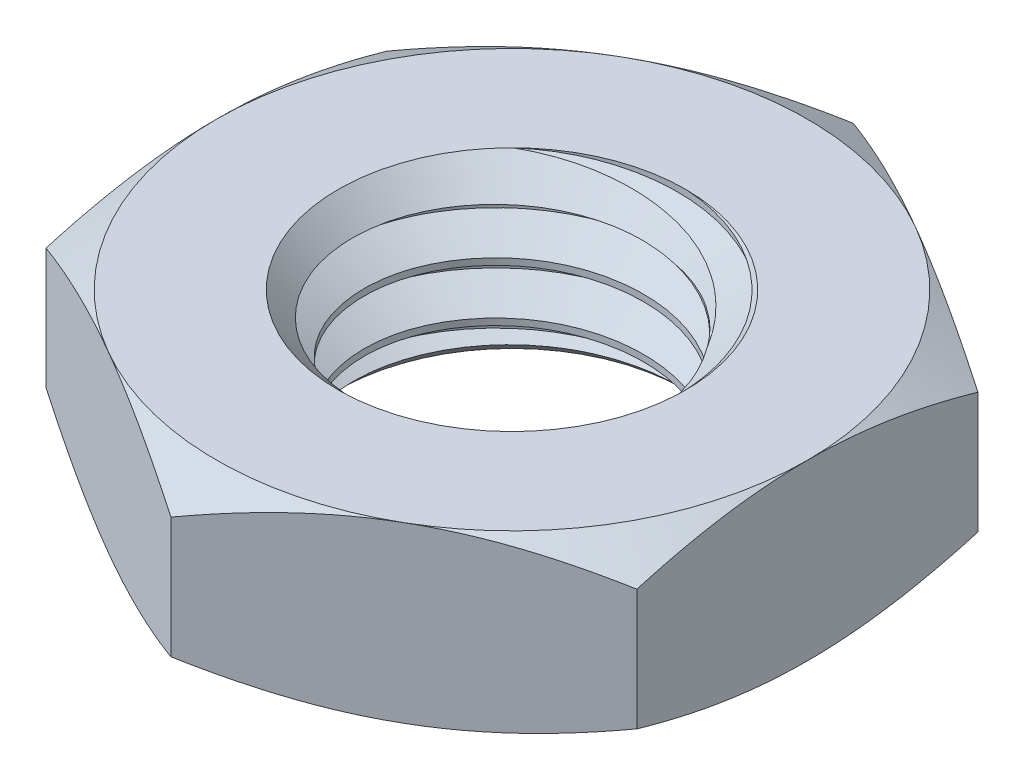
ISO-10303-21;
HEADER;
FILE_DESCRIPTION(('STEP AP214'),'2;1');
FILE_NAME('part.step','',(''),(''),'','','');
FILE_SCHEMA(('AUTOMOTIVE_DESIGN { 1 0 10303 214 1 1 1 1 }'));
ENDSEC;
DATA;
#1=APPLICATION_CONTEXT('core data for automotive mechanical design processes');
#2=APPLICATION_PROTOCOL_DEFINITION('international standard','automotive_design',2000,#1);
#3=PRODUCT_CONTEXT('',#1,'mechanical');
#4=PRODUCT('Part','Part','',(#3));
#5=PRODUCT_RELATED_PRODUCT_CATEGORY('part','',(#4));
#6=PRODUCT_DEFINITION_FORMATION('','',#4);
#7=PRODUCT_DEFINITION_CONTEXT('part definition',#1,'design');
#8=PRODUCT_DEFINITION('design','',#6,#7);
#9=PRODUCT_DEFINITION_SHAPE('','',#8);
#10=(LENGTH_UNIT() NAMED_UNIT(*) SI_UNIT(.MILLI.,.METRE.));
#11=(NAMED_UNIT(*) PLANE_ANGLE_UNIT() SI_UNIT($,.RADIAN.));
#12=(NAMED_UNIT(*) SI_UNIT($,.STERADIAN.) SOLID_ANGLE_UNIT());
#13=UNCERTAINTY_MEASURE_WITH_UNIT(LENGTH_MEASURE(1.E-05),#10,'distance_accuracy_value','');
#14=(GEOMETRIC_REPRESENTATION_CONTEXT(3) GLOBAL_UNCERTAINTY_ASSIGNED_CONTEXT((#13)) GLOBAL_UNIT_ASSIGNED_CONTEXT((#10,
#11,#12)) REPRESENTATION_CONTEXT('',''));
#15=CARTESIAN_POINT('',(0.,0.,0.));
#16=DIRECTION('',(0.,0.,1.));
#17=DIRECTION('',(1.,0.,0.));
#18=AXIS2_PLACEMENT_3D('',#15,#16,#17);
#19=CARTESIAN_POINT('',(0.,3.0625,-4.0257214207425));
#20=CARTESIAN_POINT('',(1.66750841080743,2.96875,-4.0257214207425));
#21=CARTESIAN_POINT('',(2.84661491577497,2.875,-2.84661491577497));
#22=CARTESIAN_POINT('',(4.0257214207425,2.78125,-1.66750841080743));
#23=CARTESIAN_POINT('',(4.0257214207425,2.6875,0.));
#24=CARTESIAN_POINT('',(4.0257214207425,2.59375,1.66750841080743));
#25=CARTESIAN_POINT('',(2.84661491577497,2.5,2.84661491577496));
#26=CARTESIAN_POINT('',(1.66750841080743,2.40625,4.0257214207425));
#27=CARTESIAN_POINT('',(0.,2.3125,4.0257214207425));
#28=CARTESIAN_POINT('',(-1.66750841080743,2.21875,4.0257214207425));
#29=CARTESIAN_POINT('',(-2.84661491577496,2.125,2.84661491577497));
#30=CARTESIAN_POINT('',(-4.0257214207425,2.03125,1.66750841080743));
#31=CARTESIAN_POINT('',(-4.0257214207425,1.9375,0.));
#32=CARTESIAN_POINT('',(-4.0257214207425,1.84375,-1.66750841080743));
#33=CARTESIAN_POINT('',(-2.84661491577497,1.75,-2.84661491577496));
#34=CARTESIAN_POINT('',(-1.66750841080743,1.65625,-4.0257214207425));
#35=CARTESIAN_POINT('',(0.,1.5625,-4.0257214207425));
#36=CARTESIAN_POINT('',(1.66750841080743,1.46875,-4.0257214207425));
#37=CARTESIAN_POINT('',(2.84661491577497,1.375,-2.84661491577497));
#38=CARTESIAN_POINT('',(4.0257214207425,1.28125,-1.66750841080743));
#39=CARTESIAN_POINT('',(4.0257214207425,1.1875,0.));
#40=CARTESIAN_POINT('',(4.0257214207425,1.09375,1.66750841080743));
#41=CARTESIAN_POINT('',(2.84661491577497,1.,2.84661491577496));
#42=CARTESIAN_POINT('',(1.66750841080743,0.90625,4.0257214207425));
#43=CARTESIAN_POINT('',(0.,0.8125,4.0257214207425));
#44=CARTESIAN_POINT('',(-1.66750841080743,0.718750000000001,4.0257214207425));
#45=CARTESIAN_POINT('',(-2.84661491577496,0.625000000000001,2.84661491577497));
#46=CARTESIAN_POINT('',(-4.0257214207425,0.53125,1.66750841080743));
#47=CARTESIAN_POINT('',(-4.0257214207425,0.4375,0.));
#48=CARTESIAN_POINT('',(-4.0257214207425,0.34375,-1.66750841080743));
#49=CARTESIAN_POINT('',(-2.84661491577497,0.250000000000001,-2.84661491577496));
#50=CARTESIAN_POINT('',(-1.66750841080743,0.156250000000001,-4.0257214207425));
#51=CARTESIAN_POINT('',(0.,0.0625000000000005,-4.0257214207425));
#52=CARTESIAN_POINT('',(1.66750841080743,-0.0312499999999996,-4.0257214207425));
#53=CARTESIAN_POINT('',(2.84661491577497,-0.125,-2.84661491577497));
#54=CARTESIAN_POINT('',(4.0257214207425,-0.218749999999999,-1.66750841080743));
#55=CARTESIAN_POINT('',(4.0257214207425,-0.312499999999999,0.));
#56=CARTESIAN_POINT('',(4.0257214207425,-0.40625,1.66750841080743));
#57=CARTESIAN_POINT('',(2.84661491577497,-0.5,2.84661491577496));
#58=CARTESIAN_POINT('',(1.66750841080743,-0.59375,4.0257214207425));
#59=CARTESIAN_POINT('',(0.,-0.687499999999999,4.0257214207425));
#60=CARTESIAN_POINT('',(-1.66750841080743,-0.781249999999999,4.0257214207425));
#61=CARTESIAN_POINT('',(-2.84661491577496,-0.874999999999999,2.84661491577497));
#62=CARTESIAN_POINT('',(-4.0257214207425,-0.96875,1.66750841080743));
#63=CARTESIAN_POINT('',(-4.0257214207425,-1.0625,0.));
#64=CARTESIAN_POINT('',(-4.0257214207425,-1.15625,-1.66750841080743));
#65=CARTESIAN_POINT('',(-2.84661491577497,-1.25,-2.84661491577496));
#66=CARTESIAN_POINT('',(-1.66750841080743,-1.34375,-4.0257214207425));
#67=CARTESIAN_POINT('',(0.,-1.4375,-4.0257214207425));
#68=CARTESIAN_POINT('',(1.66750841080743,-1.53125,-4.0257214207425));
#69=CARTESIAN_POINT('',(2.84661491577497,-1.625,-2.84661491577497));
#70=CARTESIAN_POINT('',(4.0257214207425,-1.71875,-1.66750841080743));
#71=CARTESIAN_POINT('',(4.0257214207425,-1.8125,0.));
#72=CARTESIAN_POINT('',(4.0257214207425,-1.90625,1.66750841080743));
#73=CARTESIAN_POINT('',(2.84661491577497,-2.,2.84661491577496));
#74=CARTESIAN_POINT('',(1.66750841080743,-2.09375,4.0257214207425));
#75=CARTESIAN_POINT('',(0.,-2.1875,4.0257214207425));
#76=CARTESIAN_POINT('',(-1.66750841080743,-2.28125,4.0257214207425));
#77=CARTESIAN_POINT('',(-2.84661491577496,-2.375,2.84661491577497));
#78=CARTESIAN_POINT('',(-4.0257214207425,-2.46875,1.66750841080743));
#79=CARTESIAN_POINT('',(-4.0257214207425,-2.5625,0.));
#80=CARTESIAN_POINT('',(-4.0257214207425,-2.65625,-1.66750841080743));
#81=CARTESIAN_POINT('',(-2.84661491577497,-2.75,-2.84661491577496));
#82=CARTESIAN_POINT('',(-1.66750841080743,-2.84375,-4.0257214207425));
#83=CARTESIAN_POINT('',(0.,-2.9375,-4.0257214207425));
#84=CARTESIAN_POINT('',(1.66750841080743,-3.03125,-4.0257214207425));
#85=CARTESIAN_POINT('',(2.84661491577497,-3.125,-2.84661491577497));
#86=CARTESIAN_POINT('',(4.0257214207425,-3.21875,-1.66750841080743));
#87=CARTESIAN_POINT('',(4.0257214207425,-3.3125,0.));
#88=CARTESIAN_POINT('',(4.0257214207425,-3.37314430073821,1.07866540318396));
#89=CARTESIAN_POINT('',(3.48639885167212,-3.43822374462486,2.01282289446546));
#90=CARTESIAN_POINT('',(0.,2.5,-5.));
#91=CARTESIAN_POINT('',(2.07106781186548,2.40625,-5.));
#92=CARTESIAN_POINT('',(3.53553390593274,2.3125,-3.53553390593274));
#93=CARTESIAN_POINT('',(5.,2.21875,-2.07106781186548));
#94=CARTESIAN_POINT('',(5.,2.125,0.));
#95=CARTESIAN_POINT('',(5.,2.03125,2.07106781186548));
#96=CARTESIAN_POINT('',(3.53553390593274,1.9375,3.53553390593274));
#97=CARTESIAN_POINT('',(2.07106781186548,1.84375,5.));
#98=CARTESIAN_POINT('',(0.,1.75,5.));
#99=CARTESIAN_POINT('',(-2.07106781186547,1.65625,5.));
#100=CARTESIAN_POINT('',(-3.53553390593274,1.5625,3.53553390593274));
#101=CARTESIAN_POINT('',(-5.,1.46875,2.07106781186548));
#102=CARTESIAN_POINT('',(-5.,1.375,0.));
#103=CARTESIAN_POINT('',(-5.,1.28125,-2.07106781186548));
#104=CARTESIAN_POINT('',(-3.53553390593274,1.1875,-3.53553390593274));
#105=CARTESIAN_POINT('',(-2.07106781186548,1.09375,-5.));
#106=CARTESIAN_POINT('',(0.,1.,-5.));
#107=CARTESIAN_POINT('',(2.07106781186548,0.90625,-5.));
#108=CARTESIAN_POINT('',(3.53553390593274,0.8125,-3.53553390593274));
#109=CARTESIAN_POINT('',(5.,0.71875,-2.07106781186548));
#110=CARTESIAN_POINT('',(5.,0.625,0.));
#111=CARTESIAN_POINT('',(5.,0.53125,2.07106781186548));
#112=CARTESIAN_POINT('',(3.53553390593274,0.4375,3.53553390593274));
#113=CARTESIAN_POINT('',(2.07106781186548,0.34375,5.));
#114=CARTESIAN_POINT('',(0.,0.25,5.));
#115=CARTESIAN_POINT('',(-2.07106781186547,0.15625,5.));
#116=CARTESIAN_POINT('',(-3.53553390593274,0.0625000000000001,3.53553390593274));
#117=CARTESIAN_POINT('',(-5.,-0.03125,2.07106781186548));
#118=CARTESIAN_POINT('',(-5.,-0.125,0.));
#119=CARTESIAN_POINT('',(-5.,-0.21875,-2.07106781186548));
#120=CARTESIAN_POINT('',(-3.53553390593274,-0.3125,-3.53553390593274));
#121=CARTESIAN_POINT('',(-2.07106781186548,-0.40625,-5.));
#122=CARTESIAN_POINT('',(0.,-0.5,-5.));
#123=CARTESIAN_POINT('',(2.07106781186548,-0.59375,-5.));
#124=CARTESIAN_POINT('',(3.53553390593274,-0.6875,-3.53553390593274));
#125=CARTESIAN_POINT('',(5.,-0.78125,-2.07106781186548));
#126=CARTESIAN_POINT('',(5.,-0.875,0.));
#127=CARTESIAN_POINT('',(5.,-0.96875,2.07106781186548));
#128=CARTESIAN_POINT('',(3.53553390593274,-1.0625,3.53553390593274));
#129=CARTESIAN_POINT('',(2.07106781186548,-1.15625,5.));
#130=CARTESIAN_POINT('',(0.,-1.25,5.));
#131=CARTESIAN_POINT('',(-2.07106781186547,-1.34375,5.));
#132=CARTESIAN_POINT('',(-3.53553390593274,-1.4375,3.53553390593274));
#133=CARTESIAN_POINT('',(-5.,-1.53125,2.07106781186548));
#134=CARTESIAN_POINT('',(-5.,-1.625,0.));
#135=CARTESIAN_POINT('',(-5.,-1.71875,-2.07106781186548));
#136=CARTESIAN_POINT('',(-3.53553390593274,-1.8125,-3.53553390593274));
#137=CARTESIAN_POINT('',(-2.07106781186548,-1.90625,-5.));
#138=CARTESIAN_POINT('',(0.,-2.,-5.));
#139=CARTESIAN_POINT('',(2.07106781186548,-2.09375,-5.));
#140=CARTESIAN_POINT('',(3.53553390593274,-2.1875,-3.53553390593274));
#141=CARTESIAN_POINT('',(5.,-2.28125,-2.07106781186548));
#142=CARTESIAN_POINT('',(5.,-2.375,0.));
#143=CARTESIAN_POINT('',(5.,-2.46875,2.07106781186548));
#144=CARTESIAN_POINT('',(3.53553390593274,-2.5625,3.53553390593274));
#145=CARTESIAN_POINT('',(2.07106781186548,-2.65625,5.));
#146=CARTESIAN_POINT('',(0.,-2.75,5.));
#147=CARTESIAN_POINT('',(-2.07106781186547,-2.84375,5.));
#148=CARTESIAN_POINT('',(-3.53553390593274,-2.9375,3.53553390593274));
#149=CARTESIAN_POINT('',(-5.,-3.03125,2.07106781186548));
#150=CARTESIAN_POINT('',(-5.,-3.125,0.));
#151=CARTESIAN_POINT('',(-5.,-3.21875,-2.07106781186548));
#152=CARTESIAN_POINT('',(-3.53553390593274,-3.3125,-3.53553390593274));
#153=CARTESIAN_POINT('',(-2.07106781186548,-3.40625,-5.));
#154=CARTESIAN_POINT('',(0.,-3.5,-5.));
#155=CARTESIAN_POINT('',(2.07106781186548,-3.59375,-5.));
#156=CARTESIAN_POINT('',(3.53553390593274,-3.6875,-3.53553390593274));
#157=CARTESIAN_POINT('',(5.,-3.78125,-2.07106781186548));
#158=CARTESIAN_POINT('',(5.,-3.875,0.));
#159=CARTESIAN_POINT('',(5.,-3.93564430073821,1.33971689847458));
#160=CARTESIAN_POINT('',(4.33015413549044,-4.00072374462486,2.4999530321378));
#161=(BOUNDED_SURFACE() B_SPLINE_SURFACE(1,2,((#19,#20,#21,#22,#23,#24,#25,#26,#27,#28,#29,#30,
#31,#32,#33,#34,#35,#36,#37,#38,#39,#40,#41,#42,#43,#44,#45,#46,#47,#48,#49,#50,#51,#52,#53,#54,
#55,#56,#57,#58,#59,#60,#61,#62,#63,#64,#65,#66,#67,#68,#69,#70,#71,#72,#73,#74,#75,#76,#77,#78,
#79,#80,#81,#82,#83,#84,#85,#86,#87,#88,#89),(#90,#91,#92,#93,#94,#95,#96,#97,#98,#99,#100,#101,
#102,#103,#104,#105,#106,#107,#108,#109,#110,#111,#112,#113,#114,#115,#116,#117,#118,#119,#120,
#121,#122,#123,#124,#125,#126,#127,#128,#129,#130,#131,#132,#133,#134,#135,#136,#137,#138,#139,
#140,#141,#142,#143,#144,#145,#146,#147,#148,#149,#150,#151,#152,#153,#154,#155,#156,#157,#158,
#159,#160)),.UNSPECIFIED.,.F.,.F.,.F.) B_SPLINE_SURFACE_WITH_KNOTS((2,2),(3,2,2,2,2,2,2,2,2,2,2,
2,2,2,2,2,2,2,2,2,2,2,2,2,2,2,2,2,2,2,2,2,2,2,2,3),(0.,1.),(0.,0.025,0.05,0.075,0.1,0.125,0.15,
0.175,0.2,0.225,0.25,0.275,0.3,0.325,0.35,0.375,0.4,0.425,0.45,0.475,0.5,0.525,0.55,0.575,0.6,
0.625,0.65,0.675,0.7,0.725,0.75,0.775,0.8,0.825,0.85,0.866618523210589),
.UNSPECIFIED.) GEOMETRIC_REPRESENTATION_ITEM() RATIONAL_B_SPLINE_SURFACE(((1.,0.923879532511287,
1.,0.923879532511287,1.,0.923879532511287,1.,0.923879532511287,1.,0.923879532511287,1.,
0.923879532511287,1.,0.923879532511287,1.,0.923879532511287,1.,0.923879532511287,1.,
0.923879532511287,1.,0.923879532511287,1.,0.923879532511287,1.,0.923879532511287,1.,
0.923879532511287,1.,0.923879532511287,1.,0.923879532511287,1.,0.923879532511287,1.,
0.923879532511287,1.,0.923879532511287,1.,0.923879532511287,1.,0.923879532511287,1.,
0.923879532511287,1.,0.923879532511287,1.,0.923879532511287,1.,0.923879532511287,1.,
0.923879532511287,1.,0.923879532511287,1.,0.923879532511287,1.,0.923879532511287,1.,
0.923879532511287,1.,0.923879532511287,1.,0.923879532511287,1.,0.923879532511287,1.,
0.923879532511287,1.,0.949399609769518,0.966071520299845),(1.,0.923879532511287,1.,
0.923879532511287,1.,0.923879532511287,1.,0.923879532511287,1.,0.923879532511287,1.,
0.923879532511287,1.,0.923879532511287,1.,0.923879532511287,1.,0.923879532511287,1.,
0.923879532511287,1.,0.923879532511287,1.,0.923879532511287,1.,0.923879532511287,1.,
0.923879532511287,1.,0.923879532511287,1.,0.923879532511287,1.,0.923879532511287,1.,
0.923879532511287,1.,0.923879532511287,1.,0.923879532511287,1.,0.923879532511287,1.,
0.923879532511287,1.,0.923879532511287,1.,0.923879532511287,1.,0.923879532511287,1.,
0.923879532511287,1.,0.923879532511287,1.,0.923879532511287,1.,0.923879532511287,1.,
0.923879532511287,1.,0.923879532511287,1.,0.923879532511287,1.,0.923879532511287,1.,
0.923879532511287,1.,0.949399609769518,0.966071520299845))) REPRESENTATION_ITEM('') SURFACE());
#162=CARTESIAN_POINT('',(0.,2.5,-5.));
#163=CARTESIAN_POINT('',(2.07106781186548,2.40625,-5.));
#164=CARTESIAN_POINT('',(3.53553390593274,2.3125,-3.53553390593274));
#165=CARTESIAN_POINT('',(5.,2.21875,-2.07106781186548));
#166=CARTESIAN_POINT('',(5.,2.125,0.));
#167=CARTESIAN_POINT('',(5.,2.03125,2.07106781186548));
#168=CARTESIAN_POINT('',(3.53553390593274,1.9375,3.53553390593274));
#169=CARTESIAN_POINT('',(2.07106781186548,1.84375,5.));
#170=CARTESIAN_POINT('',(0.,1.75,5.));
#171=CARTESIAN_POINT('',(-2.07106781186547,1.65625,5.));
#172=CARTESIAN_POINT('',(-3.53553390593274,1.5625,3.53553390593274));
#173=CARTESIAN_POINT('',(-5.,1.46875,2.07106781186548));
#174=CARTESIAN_POINT('',(-5.,1.375,0.));
#175=CARTESIAN_POINT('',(-5.,1.28125,-2.07106781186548));
#176=CARTESIAN_POINT('',(-3.53553390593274,1.1875,-3.53553390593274));
#177=CARTESIAN_POINT('',(-2.07106781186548,1.09375,-5.));
#178=CARTESIAN_POINT('',(0.,1.,-5.));
#179=CARTESIAN_POINT('',(2.07106781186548,0.90625,-5.));
#180=CARTESIAN_POINT('',(3.53553390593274,0.8125,-3.53553390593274));
#181=CARTESIAN_POINT('',(5.,0.71875,-2.07106781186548));
#182=CARTESIAN_POINT('',(5.,0.625,0.));
#183=CARTESIAN_POINT('',(5.,0.53125,2.07106781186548));
#184=CARTESIAN_POINT('',(3.53553390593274,0.4375,3.53553390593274));
#185=CARTESIAN_POINT('',(2.07106781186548,0.34375,5.));
#186=CARTESIAN_POINT('',(0.,0.25,5.));
#187=CARTESIAN_POINT('',(-2.07106781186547,0.15625,5.));
#188=CARTESIAN_POINT('',(-3.53553390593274,0.0625000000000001,3.53553390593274));
#189=CARTESIAN_POINT('',(-5.,-0.03125,2.07106781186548));
#190=CARTESIAN_POINT('',(-5.,-0.125,0.));
#191=CARTESIAN_POINT('',(-5.,-0.21875,-2.07106781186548));
#192=CARTESIAN_POINT('',(-3.53553390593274,-0.3125,-3.53553390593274));
#193=CARTESIAN_POINT('',(-2.07106781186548,-0.40625,-5.));
#194=CARTESIAN_POINT('',(0.,-0.5,-5.));
#195=CARTESIAN_POINT('',(2.07106781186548,-0.59375,-5.));
#196=CARTESIAN_POINT('',(3.53553390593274,-0.6875,-3.53553390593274));
#197=CARTESIAN_POINT('',(5.,-0.78125,-2.07106781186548));
#198=CARTESIAN_POINT('',(5.,-0.875,0.));
#199=CARTESIAN_POINT('',(5.,-0.96875,2.07106781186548));
#200=CARTESIAN_POINT('',(3.53553390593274,-1.0625,3.53553390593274));
#201=CARTESIAN_POINT('',(2.07106781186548,-1.15625,5.));
#202=CARTESIAN_POINT('',(0.,-1.25,5.));
#203=CARTESIAN_POINT('',(-2.07106781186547,-1.34375,5.));
#204=CARTESIAN_POINT('',(-3.53553390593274,-1.4375,3.53553390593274));
#205=CARTESIAN_POINT('',(-5.,-1.53125,2.07106781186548));
#206=CARTESIAN_POINT('',(-5.,-1.625,0.));
#207=CARTESIAN_POINT('',(-5.,-1.71875,-2.07106781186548));
#208=CARTESIAN_POINT('',(-3.53553390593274,-1.8125,-3.53553390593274));
#209=CARTESIAN_POINT('',(-2.07106781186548,-1.90625,-5.));
#210=CARTESIAN_POINT('',(0.,-2.,-5.));
#211=CARTESIAN_POINT('',(2.07106781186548,-2.09375,-5.));
#212=CARTESIAN_POINT('',(3.53553390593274,-2.1875,-3.53553390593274));
#213=CARTESIAN_POINT('',(5.,-2.28125,-2.07106781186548));
#214=CARTESIAN_POINT('',(5.,-2.375,0.));
#215=CARTESIAN_POINT('',(5.,-2.46875,2.07106781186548));
#216=CARTESIAN_POINT('',(3.53553390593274,-2.5625,3.53553390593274));
#217=CARTESIAN_POINT('',(2.07106781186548,-2.65625,5.));
#218=CARTESIAN_POINT('',(0.,-2.75,5.));
#219=CARTESIAN_POINT('',(-2.07106781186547,-2.84375,5.));
#220=CARTESIAN_POINT('',(-3.53553390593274,-2.9375,3.53553390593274));
#221=CARTESIAN_POINT('',(-5.,-3.03125,2.07106781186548));
#222=CARTESIAN_POINT('',(-5.,-3.125,0.));
#223=CARTESIAN_POINT('',(-5.,-3.21875,-2.07106781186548));
#224=CARTESIAN_POINT('',(-3.53553390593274,-3.3125,-3.53553390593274));
#225=CARTESIAN_POINT('',(-2.07106781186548,-3.40625,-5.));
#226=CARTESIAN_POINT('',(0.,-3.5,-5.));
#227=CARTESIAN_POINT('',(2.07106781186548,-3.59375,-5.));
#228=CARTESIAN_POINT('',(3.53553390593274,-3.6875,-3.53553390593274));
#229=CARTESIAN_POINT('',(5.,-3.78125,-2.07106781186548));
#230=CARTESIAN_POINT('',(5.,-3.875,0.));
#231=CARTESIAN_POINT('',(5.,-3.93564430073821,1.33971689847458));
#232=CARTESIAN_POINT('',(4.33015413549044,-4.00072374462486,2.4999530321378));
#233=(BOUNDED_CURVE() B_SPLINE_CURVE(2,(#162,#163,#164,#165,#166,#167,#168,#169,#170,#171,#172,
#173,#174,#175,#176,#177,#178,#179,#180,#181,#182,#183,#184,#185,#186,#187,#188,#189,#190,#191,
#192,#193,#194,#195,#196,#197,#198,#199,#200,#201,#202,#203,#204,#205,#206,#207,#208,#209,#210,
#211,#212,#213,#214,#215,#216,#217,#218,#219,#220,#221,#222,#223,#224,#225,#226,#227,#228,#229,
#230,#231,#232),.UNSPECIFIED.,.F.,.F.) B_SPLINE_CURVE_WITH_KNOTS((3,2,2,2,2,2,2,2,2,2,2,2,2,2,2,
2,2,2,2,2,2,2,2,2,2,2,2,2,2,2,2,2,2,2,2,3),(0.,0.025,0.05,0.075,0.1,0.125,0.15,0.175,0.2,0.225,
0.25,0.275,0.3,0.325,0.35,0.375,0.4,0.425,0.45,0.475,0.5,0.525,0.55,0.575,0.6,0.625,0.65,0.675,
0.7,0.725,0.75,0.775,0.8,0.825,0.85,0.866618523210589),
.UNSPECIFIED.) CURVE() GEOMETRIC_REPRESENTATION_ITEM() RATIONAL_B_SPLINE_CURVE((1.,
0.923879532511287,1.,0.923879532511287,1.,0.923879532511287,1.,0.923879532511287,1.,
0.923879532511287,1.,0.923879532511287,1.,0.923879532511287,1.,0.923879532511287,1.,
0.923879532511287,1.,0.923879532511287,1.,0.923879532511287,1.,0.923879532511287,1.,
0.923879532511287,1.,0.923879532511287,1.,0.923879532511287,1.,0.923879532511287,1.,
0.923879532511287,1.,0.923879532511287,1.,0.923879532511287,1.,0.923879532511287,1.,
0.923879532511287,1.,0.923879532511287,1.,0.923879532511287,1.,0.923879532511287,1.,
0.923879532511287,1.,0.923879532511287,1.,0.923879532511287,1.,0.923879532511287,1.,
0.923879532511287,1.,0.923879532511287,1.,0.923879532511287,1.,0.923879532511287,1.,
0.923879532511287,1.,0.923879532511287,1.,0.949399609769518,0.966071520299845)) REPRESENTATION_ITEM(''));
#234=CARTESIAN_POINT('',(0.,2.5,-5.));
#235=VERTEX_POINT('',#234);
#236=CARTESIAN_POINT('',(4.33758277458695,-2.5,2.48704155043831));
#237=VERTEX_POINT('',#236);
#238=EDGE_CURVE('E362',#235,#237,#233,.T.);
#239=CARTESIAN_POINT('',(4.33758277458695,-2.5,2.48704155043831));
#240=CARTESIAN_POINT('',(4.39224070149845,-2.4842016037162,2.35997909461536));
#241=CARTESIAN_POINT('',(4.44148094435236,-2.46824632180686,2.23060956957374));
#242=CARTESIAN_POINT('',(4.52883133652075,-2.43612832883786,1.96821584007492));
#243=CARTESIAN_POINT('',(4.56694340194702,-2.4199656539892,1.83519226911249));
#244=CARTESIAN_POINT('',(4.63187065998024,-2.38747920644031,1.56595383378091));
#245=CARTESIAN_POINT('',(4.65864745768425,-2.371155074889,1.42972974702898));
#246=CARTESIAN_POINT('',(4.70053351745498,-2.33851338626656,1.15549618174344));
#247=CARTESIAN_POINT('',(4.71564212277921,-2.32219582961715,1.01748660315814));
#248=CARTESIAN_POINT('',(4.73408032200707,-2.2896808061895,0.740614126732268));
#249=CARTESIAN_POINT('',(4.7374069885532,-2.27348337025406,0.601751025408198));
#250=CARTESIAN_POINT('',(4.73354596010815,-2.24938434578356,0.393636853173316));
#251=CARTESIAN_POINT('',(4.73078294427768,-2.24138327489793,0.32428750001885));
#252=CARTESIAN_POINT('',(4.72230812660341,-2.22545739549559,0.185753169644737));
#253=CARTESIAN_POINT('',(4.71659630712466,-2.21753258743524,0.11656819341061));
#254=CARTESIAN_POINT('',(4.70584199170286,-2.20573421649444,0.0130704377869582));
#255=CARTESIAN_POINT('',(4.70189675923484,-2.20181928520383,-0.0213551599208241));
#256=CARTESIAN_POINT('',(4.69320009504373,-2.19393862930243,-0.0900983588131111));
#257=CARTESIAN_POINT('',(4.6884486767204,-2.18997290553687,-0.12441596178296));
#258=CARTESIAN_POINT('',(4.67300220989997,-2.17801509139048,-0.227179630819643));
#259=CARTESIAN_POINT('',(4.66111430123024,-2.16996164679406,-0.295442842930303));
#260=CARTESIAN_POINT('',(4.63417918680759,-2.1536993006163,-0.431311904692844));
#261=CARTESIAN_POINT('',(4.61913247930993,-2.14549042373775,-0.498917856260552));
#262=CARTESIAN_POINT('',(4.58591470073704,-2.12893113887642,-0.633337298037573));
#263=CARTESIAN_POINT('',(4.56774354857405,-2.1205807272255,-0.700150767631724));
#264=CARTESIAN_POINT('',(4.51021789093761,-2.09602840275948,-0.893732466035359));
#265=CARTESIAN_POINT('',(4.46672224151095,-2.07965093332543,-1.01927552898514));
#266=CARTESIAN_POINT('',(4.36871394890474,-2.04652564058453,-1.26593041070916));
#267=CARTESIAN_POINT('',(4.31419999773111,-2.02977777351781,-1.38704170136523));
#268=CARTESIAN_POINT('',(4.1945158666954,-1.99600319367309,-1.62401731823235));
#269=CARTESIAN_POINT('',(4.12933390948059,-1.97897619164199,-1.73987566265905));
#270=CARTESIAN_POINT('',(3.98888733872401,-1.94478645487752,-1.96525909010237));
#271=CARTESIAN_POINT('',(3.91362428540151,-1.92762374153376,-2.07478514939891));
#272=CARTESIAN_POINT('',(3.75758161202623,-1.89414430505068,-2.28138692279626));
#273=CARTESIAN_POINT('',(3.67726423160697,-1.8778280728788,-2.3788111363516));
#274=CARTESIAN_POINT('',(3.55080357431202,-1.8534407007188,-2.51955499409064));
#275=CARTESIAN_POINT('',(3.5076435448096,-1.84532449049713,-2.56557936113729));
#276=CARTESIAN_POINT('',(3.41939694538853,-1.82913520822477,-2.65575773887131));
#277=CARTESIAN_POINT('',(3.37431035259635,-1.82106213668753,-2.69991172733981));
#278=CARTESIAN_POINT('',(3.28237048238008,-1.80498951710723,-2.78619503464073));
#279=CARTESIAN_POINT('',(3.23552021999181,-1.79698987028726,-2.82832755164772));
#280=CARTESIAN_POINT('',(3.14006331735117,-1.7810659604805,-2.91057272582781));
#281=CARTESIAN_POINT('',(3.09145666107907,-1.7731416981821,-2.95068536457));
#282=CARTESIAN_POINT('',(3.01730526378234,-1.76132841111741,-3.00927986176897));
#283=CARTESIAN_POINT('',(2.99238370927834,-1.75740321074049,-3.02854715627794));
#284=CARTESIAN_POINT('',(2.94209477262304,-1.74949870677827,-3.06647912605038));
#285=CARTESIAN_POINT('',(2.9167273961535,-1.74551940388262,-3.0851438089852));
#286=CARTESIAN_POINT('',(2.83998921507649,-1.73352031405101,-3.14023191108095));
#287=CARTESIAN_POINT('',(2.78797666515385,-1.72543844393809,-3.17575388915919));
#288=CARTESIAN_POINT('',(2.68641728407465,-1.70974102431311,-3.24166666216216));
#289=CARTESIAN_POINT('',(2.63698814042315,-1.70213736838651,-3.27224199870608));
#290=CARTESIAN_POINT('',(2.53686633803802,-1.68680515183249,-3.33121061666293));
#291=CARTESIAN_POINT('',(2.48617365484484,-1.67907658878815,-3.35960385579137));
#292=CARTESIAN_POINT('',(2.332327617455,-1.65571644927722,-3.44143484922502));
#293=CARTESIAN_POINT('',(2.22739662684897,-1.63990893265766,-3.49153013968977));
#294=CARTESIAN_POINT('',(2.01318595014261,-1.60785646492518,-3.58258419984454));
#295=CARTESIAN_POINT('',(1.90388966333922,-1.59160993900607,-3.62350319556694));
#296=CARTESIAN_POINT('',(1.68219527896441,-1.55884513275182,-3.69564379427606));
#297=CARTESIAN_POINT('',(1.56979751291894,-1.54232688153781,-3.72686642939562));
#298=CARTESIAN_POINT('',(1.45624994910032,-1.5257214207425,-3.75310125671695));
#299=B_SPLINE_CURVE_WITH_KNOTS('',3,(#239,#240,#241,#242,#243,#244,#245,#246,#247,#248,#249,
#250,#251,#252,#253,#254,#255,#256,#257,#258,#259,#260,#261,#262,#263,#264,#265,#266,#267,#268,
#269,#270,#271,#272,#273,#274,#275,#276,#277,#278,#279,#280,#281,#282,#283,#284,#285,#286,#287,
#288,#289,#290,#291,#292,#293,#294,#295,#296,#297,#298),.UNSPECIFIED.,.F.,.F.,(4,2,2,2,2,2,2,2,
2,2,2,2,2,2,2,2,2,2,2,2,2,2,2,2,2,2,2,2,2,4),(0.,0.417528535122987,0.834985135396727,
1.25384464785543,1.67272773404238,2.09171488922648,2.30125713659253,2.51080063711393,
2.61540754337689,2.72001271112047,2.92920398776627,3.13836229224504,3.34752602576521,
3.74856296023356,4.1496475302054,4.55117791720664,4.95264623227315,5.33409492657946,
5.5248940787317,5.71569549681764,5.90618435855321,6.09667495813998,6.191901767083,
6.28712736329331,6.47755662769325,6.65335154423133,6.82914986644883,7.18071183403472,
7.5337693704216,7.88678931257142),.UNSPECIFIED.);
#300=CARTESIAN_POINT('',(1.45624994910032,-1.5257214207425,-3.75310125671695));
#301=VERTEX_POINT('',#300);
#302=EDGE_CURVE('E485',#237,#301,#299,.T.);
#303=CARTESIAN_POINT('',(0.,3.0625,-4.0257214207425));
#304=CARTESIAN_POINT('',(1.66750841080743,2.96875,-4.0257214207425));
#305=CARTESIAN_POINT('',(2.84661491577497,2.875,-2.84661491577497));
#306=CARTESIAN_POINT('',(4.0257214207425,2.78125,-1.66750841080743));
#307=CARTESIAN_POINT('',(4.0257214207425,2.6875,0.));
#308=CARTESIAN_POINT('',(4.0257214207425,2.59375,1.66750841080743));
#309=CARTESIAN_POINT('',(2.84661491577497,2.5,2.84661491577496));
#310=CARTESIAN_POINT('',(1.66750841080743,2.40625,4.0257214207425));
#311=CARTESIAN_POINT('',(0.,2.3125,4.0257214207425));
#312=CARTESIAN_POINT('',(-1.66750841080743,2.21875,4.0257214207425));
#313=CARTESIAN_POINT('',(-2.84661491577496,2.125,2.84661491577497));
#314=CARTESIAN_POINT('',(-4.0257214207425,2.03125,1.66750841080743));
#315=CARTESIAN_POINT('',(-4.0257214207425,1.9375,0.));
#316=CARTESIAN_POINT('',(-4.0257214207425,1.84375,-1.66750841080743));
#317=CARTESIAN_POINT('',(-2.84661491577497,1.75,-2.84661491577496));
#318=CARTESIAN_POINT('',(-1.66750841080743,1.65625,-4.0257214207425));
#319=CARTESIAN_POINT('',(0.,1.5625,-4.0257214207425));
#320=CARTESIAN_POINT('',(1.66750841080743,1.46875,-4.0257214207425));
#321=CARTESIAN_POINT('',(2.84661491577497,1.375,-2.84661491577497));
#322=CARTESIAN_POINT('',(4.0257214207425,1.28125,-1.66750841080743));
#323=CARTESIAN_POINT('',(4.0257214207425,1.1875,0.));
#324=CARTESIAN_POINT('',(4.0257214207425,1.09375,1.66750841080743));
#325=CARTESIAN_POINT('',(2.84661491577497,1.,2.84661491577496));
#326=CARTESIAN_POINT('',(1.66750841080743,0.90625,4.0257214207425));
#327=CARTESIAN_POINT('',(0.,0.8125,4.0257214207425));
#328=CARTESIAN_POINT('',(-1.66750841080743,0.718750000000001,4.0257214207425));
#329=CARTESIAN_POINT('',(-2.84661491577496,0.625000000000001,2.84661491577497));
#330=CARTESIAN_POINT('',(-4.0257214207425,0.53125,1.66750841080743));
#331=CARTESIAN_POINT('',(-4.0257214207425,0.4375,0.));
#332=CARTESIAN_POINT('',(-4.0257214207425,0.34375,-1.66750841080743));
#333=CARTESIAN_POINT('',(-2.84661491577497,0.250000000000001,-2.84661491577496));
#334=CARTESIAN_POINT('',(-1.66750841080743,0.156250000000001,-4.0257214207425));
#335=CARTESIAN_POINT('',(0.,0.0625000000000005,-4.0257214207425));
#336=CARTESIAN_POINT('',(1.66750841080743,-0.0312499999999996,-4.0257214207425));
#337=CARTESIAN_POINT('',(2.84661491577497,-0.125,-2.84661491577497));
#338=CARTESIAN_POINT('',(4.0257214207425,-0.218749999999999,-1.66750841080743));
#339=CARTESIAN_POINT('',(4.0257214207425,-0.312499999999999,0.));
#340=CARTESIAN_POINT('',(4.0257214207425,-0.40625,1.66750841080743));
#341=CARTESIAN_POINT('',(2.84661491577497,-0.5,2.84661491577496));
#342=CARTESIAN_POINT('',(1.66750841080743,-0.59375,4.0257214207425));
#343=CARTESIAN_POINT('',(0.,-0.687499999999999,4.0257214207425));
#344=CARTESIAN_POINT('',(-1.66750841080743,-0.781249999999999,4.0257214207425));
#345=CARTESIAN_POINT('',(-2.84661491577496,-0.874999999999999,2.84661491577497));
#346=CARTESIAN_POINT('',(-4.0257214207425,-0.96875,1.66750841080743));
#347=CARTESIAN_POINT('',(-4.0257214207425,-1.0625,0.));
#348=CARTESIAN_POINT('',(-4.0257214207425,-1.15625,-1.66750841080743));
#349=CARTESIAN_POINT('',(-2.84661491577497,-1.25,-2.84661491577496));
#350=CARTESIAN_POINT('',(-1.66750841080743,-1.34375,-4.0257214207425));
#351=CARTESIAN_POINT('',(0.,-1.4375,-4.0257214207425));
#352=CARTESIAN_POINT('',(1.66750841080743,-1.53125,-4.0257214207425));
#353=CARTESIAN_POINT('',(2.84661491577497,-1.625,-2.84661491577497));
#354=CARTESIAN_POINT('',(4.0257214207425,-1.71875,-1.66750841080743));
#355=CARTESIAN_POINT('',(4.0257214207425,-1.8125,0.));
#356=CARTESIAN_POINT('',(4.0257214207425,-1.90625,1.66750841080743));
#357=CARTESIAN_POINT('',(2.84661491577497,-2.,2.84661491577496));
#358=CARTESIAN_POINT('',(1.66750841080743,-2.09375,4.0257214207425));
#359=CARTESIAN_POINT('',(0.,-2.1875,4.0257214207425));
#360=CARTESIAN_POINT('',(-1.66750841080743,-2.28125,4.0257214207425));
#361=CARTESIAN_POINT('',(-2.84661491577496,-2.375,2.84661491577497));
#362=CARTESIAN_POINT('',(-4.0257214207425,-2.46875,1.66750841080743));
#363=CARTESIAN_POINT('',(-4.0257214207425,-2.5625,0.));
#364=CARTESIAN_POINT('',(-4.0257214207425,-2.65625,-1.66750841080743));
#365=CARTESIAN_POINT('',(-2.84661491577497,-2.75,-2.84661491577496));
#366=CARTESIAN_POINT('',(-1.66750841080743,-2.84375,-4.0257214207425));
#367=CARTESIAN_POINT('',(0.,-2.9375,-4.0257214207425));
#368=CARTESIAN_POINT('',(1.66750841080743,-3.03125,-4.0257214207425));
#369=CARTESIAN_POINT('',(2.84661491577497,-3.125,-2.84661491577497));
#370=CARTESIAN_POINT('',(4.0257214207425,-3.21875,-1.66750841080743));
#371=CARTESIAN_POINT('',(4.0257214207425,-3.3125,0.));
#372=CARTESIAN_POINT('',(4.0257214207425,-3.37314430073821,1.07866540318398));
#373=CARTESIAN_POINT('',(3.48639885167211,-3.43822374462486,2.01282289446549));
#374=(BOUNDED_CURVE() B_SPLINE_CURVE(2,(#303,#304,#305,#306,#307,#308,#309,#310,#311,#312,#313,
#314,#315,#316,#317,#318,#319,#320,#321,#322,#323,#324,#325,#326,#327,#328,#329,#330,#331,#332,
#333,#334,#335,#336,#337,#338,#339,#340,#341,#342,#343,#344,#345,#346,#347,#348,#349,#350,#351,
#352,#353,#354,#355,#356,#357,#358,#359,#360,#361,#362,#363,#364,#365,#366,#367,#368,#369,#370,
#371,#372,#373),.UNSPECIFIED.,.F.,.F.) B_SPLINE_CURVE_WITH_KNOTS((3,2,2,2,2,2,2,2,2,2,2,2,2,2,2,
2,2,2,2,2,2,2,2,2,2,2,2,2,2,2,2,2,2,2,2,3),(0.,0.025,0.05,0.075,0.1,0.125,0.15,0.175,0.2,0.225,
0.25,0.275,0.3,0.325,0.35,0.375,0.4,0.425,0.45,0.475,0.5,0.525,0.55,0.575,0.6,0.625,0.65,0.675,
0.7,0.725,0.75,0.775,0.8,0.825,0.85,0.866618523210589),
.UNSPECIFIED.) CURVE() GEOMETRIC_REPRESENTATION_ITEM() RATIONAL_B_SPLINE_CURVE((1.,
0.923879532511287,1.,0.923879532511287,1.,0.923879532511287,1.,0.923879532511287,1.,
0.923879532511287,1.,0.923879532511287,1.,0.923879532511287,1.,0.923879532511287,1.,
0.923879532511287,1.,0.923879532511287,1.,0.923879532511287,1.,0.923879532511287,1.,
0.923879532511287,1.,0.923879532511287,1.,0.923879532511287,1.,0.923879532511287,1.,
0.923879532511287,1.,0.923879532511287,1.,0.923879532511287,1.,0.923879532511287,1.,
0.923879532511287,1.,0.923879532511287,1.,0.923879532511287,1.,0.923879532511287,1.,
0.923879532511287,1.,0.923879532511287,1.,0.923879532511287,1.,0.923879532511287,1.,
0.923879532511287,1.,0.923879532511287,1.,0.923879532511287,1.,0.923879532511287,1.,
0.923879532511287,1.,0.923879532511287,1.,0.949399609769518,0.966071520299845)) REPRESENTATION_ITEM(''));
#375=CARTESIAN_POINT('',(0.633402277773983,1.5257214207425,-3.97557977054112));
#376=VERTEX_POINT('',#375);
#377=EDGE_CURVE('E376',#376,#301,#374,.T.);
#378=CARTESIAN_POINT('',(0.,2.5,-5.));
#379=CARTESIAN_POINT('',(0.138917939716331,2.49601362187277,-4.99602831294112));
#380=CARTESIAN_POINT('',(0.27766252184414,2.49195335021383,-4.98616454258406));
#381=CARTESIAN_POINT('',(0.553817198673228,2.48371315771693,-4.95478932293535));
#382=CARTESIAN_POINT('',(0.69122736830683,2.47953324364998,-4.93327853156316));
#383=CARTESIAN_POINT('',(0.963630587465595,2.47108488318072,-4.87876744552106));
#384=CARTESIAN_POINT('',(1.09862551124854,2.46681651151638,-4.84577650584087));
#385=CARTESIAN_POINT('',(1.36535374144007,2.45821718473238,-4.76854094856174));
#386=CARTESIAN_POINT('',(1.49708706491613,2.4538862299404,-4.72429638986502));
#387=CARTESIAN_POINT('',(1.75641338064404,2.4451897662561,-4.62484477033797));
#388=CARTESIAN_POINT('',(1.8840045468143,2.44082424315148,-4.56963294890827));
#389=CARTESIAN_POINT('',(2.13407923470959,2.43209148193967,-4.44865223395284));
#390=CARTESIAN_POINT('',(2.25656275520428,2.42772424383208,-4.3828833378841));
#391=CARTESIAN_POINT('',(2.49554725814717,2.41901870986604,-4.2412570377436));
#392=CARTESIAN_POINT('',(2.612048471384,2.41468041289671,-4.16540002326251));
#393=CARTESIAN_POINT('',(2.83824725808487,2.40606690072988,-4.0041381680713));
#394=CARTESIAN_POINT('',(2.94794458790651,2.40179168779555,-3.91873298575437));
#395=CARTESIAN_POINT('',(3.15982206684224,2.39332274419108,-3.73890720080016));
#396=CARTESIAN_POINT('',(3.26199768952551,2.38912906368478,-3.64448124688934));
#397=CARTESIAN_POINT('',(3.40901122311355,2.38295526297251,-3.49667325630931));
#398=CARTESIAN_POINT('',(3.45697814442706,2.38091660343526,-3.44637091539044));
#399=CARTESIAN_POINT('',(3.55069401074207,2.37680373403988,-3.34374227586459));
#400=CARTESIAN_POINT('',(3.59644294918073,2.37472952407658,-3.29141597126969));
#401=CARTESIAN_POINT('',(3.73021373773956,2.36845643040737,-3.13155673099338));
#402=CARTESIAN_POINT('',(3.8147959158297,2.36420558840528,-3.02110695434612));
#403=CARTESIAN_POINT('',(3.9740788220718,2.35560091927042,-2.79336368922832));
#404=CARTESIAN_POINT('',(4.04877938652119,2.35124709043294,-2.67607008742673));
#405=CARTESIAN_POINT('',(4.25494153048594,2.33821916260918,-2.3191120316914));
#406=CARTESIAN_POINT('',(4.37155869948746,2.32943300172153,-2.07065279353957));
#407=CARTESIAN_POINT('',(4.56097970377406,2.31181831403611,-1.55749888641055));
#408=CARTESIAN_POINT('',(4.63377386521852,2.30298977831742,-1.2928006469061));
#409=CARTESIAN_POINT('',(4.70836820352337,2.28996011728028,-0.890744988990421));
#410=CARTESIAN_POINT('',(4.72745928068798,2.28566789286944,-0.756397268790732));
#411=CARTESIAN_POINT('',(4.75424899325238,2.27715956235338,-0.486533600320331));
#412=CARTESIAN_POINT('',(4.7619474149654,2.27294345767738,-0.351017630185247));
#413=CARTESIAN_POINT('',(4.76591998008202,2.26466160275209,-0.0798572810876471));
#414=CARTESIAN_POINT('',(4.7621974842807,2.26059580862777,0.0557870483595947));
#415=CARTESIAN_POINT('',(4.74302696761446,2.25230263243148,0.326240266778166));
#416=CARTESIAN_POINT('',(4.7275796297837,2.24807525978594,0.461049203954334));
#417=CARTESIAN_POINT('',(4.68528030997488,2.23955041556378,0.727693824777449));
#418=CARTESIAN_POINT('',(4.65852553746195,2.2352538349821,0.859544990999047));
#419=CARTESIAN_POINT('',(4.59381521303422,2.22657920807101,1.12047399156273));
#420=CARTESIAN_POINT('',(4.55585917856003,2.22220115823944,1.24955170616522));
#421=CARTESIAN_POINT('',(4.46902005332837,2.2133959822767,1.50400022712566));
#422=CARTESIAN_POINT('',(4.42013508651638,2.20896884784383,1.62937039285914));
#423=CARTESIAN_POINT('',(4.31180092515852,2.20009773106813,1.87545875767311));
#424=CARTESIAN_POINT('',(4.25235181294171,2.19565374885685,1.99617699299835));
#425=CARTESIAN_POINT('',(4.12438800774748,2.18685480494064,2.23013364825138));
#426=CARTESIAN_POINT('',(4.05603852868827,2.18249958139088,2.34346244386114));
#427=CARTESIAN_POINT('',(3.9100300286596,2.17383574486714,2.56395668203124));
#428=CARTESIAN_POINT('',(3.83237075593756,2.16952713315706,2.67112195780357));
#429=CARTESIAN_POINT('',(3.66829557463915,2.16098966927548,2.87852203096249));
#430=CARTESIAN_POINT('',(3.58188113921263,2.15676080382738,2.97875798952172));
#431=CARTESIAN_POINT('',(3.44617774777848,2.15049842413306,3.1233578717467));
#432=CARTESIAN_POINT('',(3.39992506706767,2.14842426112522,3.17060295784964));
#433=CARTESIAN_POINT('',(3.30547128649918,2.14431251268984,3.26310643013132));
#434=CARTESIAN_POINT('',(3.25727017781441,2.14227492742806,3.30836480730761));
#435=CARTESIAN_POINT('',(3.10984348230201,2.13610171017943,3.44089315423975));
#436=CARTESIAN_POINT('',(3.00772937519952,2.13190277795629,3.52498599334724));
#437=CARTESIAN_POINT('',(2.79663614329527,2.12339221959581,3.68402409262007));
#438=CARTESIAN_POINT('',(2.68765695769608,2.11908059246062,3.75896927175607));
#439=CARTESIAN_POINT('',(2.46366322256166,2.11036933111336,3.89914056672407));
#440=CARTESIAN_POINT('',(2.34865057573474,2.10596972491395,3.9643697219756));
#441=CARTESIAN_POINT('',(2.11336878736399,2.09711272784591,4.08467431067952));
#442=CARTESIAN_POINT('',(1.99309729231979,2.09265531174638,4.13974513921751));
#443=CARTESIAN_POINT('',(1.75129225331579,2.08382797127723,4.23804711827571));
#444=CARTESIAN_POINT('',(1.62986441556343,2.07945862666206,4.28153857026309));
#445=CARTESIAN_POINT('',(1.38377499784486,2.0707286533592,4.3581318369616));
#446=CARTESIAN_POINT('',(1.25911347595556,2.06636802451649,4.39123383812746));
#447=CARTESIAN_POINT('',(1.0074358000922,2.05768580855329,4.44681530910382));
#448=CARTESIAN_POINT('',(0.880419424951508,2.05336422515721,4.46929377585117));
#449=CARTESIAN_POINT('',(0.624917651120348,2.04479423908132,4.50346765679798));
#450=CARTESIAN_POINT('',(0.496432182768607,2.04054583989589,4.51516255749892));
#451=CARTESIAN_POINT('',(0.303287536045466,2.03424357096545,4.52454880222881));
#452=CARTESIAN_POINT('',(0.238802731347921,2.0321534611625,4.52631698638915));
#453=CARTESIAN_POINT('',(0.10981425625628,2.02801501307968,4.52714196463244));
#454=CARTESIAN_POINT('',(0.045310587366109,2.02596667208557,4.52619893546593));
#455=CARTESIAN_POINT('',(-0.0835901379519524,2.02185622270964,4.52154298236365));
#456=CARTESIAN_POINT('',(-0.147987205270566,2.01979411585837,4.51783036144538));
#457=CARTESIAN_POINT('',(-0.276565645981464,2.01562827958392,4.50761216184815));
#458=CARTESIAN_POINT('',(-0.340746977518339,2.01352454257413,4.50110606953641));
#459=CARTESIAN_POINT('',(-0.532681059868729,2.0071712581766,4.47743545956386));
#460=CARTESIAN_POINT('',(-0.659945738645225,2.00287576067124,4.45611419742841));
#461=CARTESIAN_POINT('',(-0.912213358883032,1.99418649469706,4.40252254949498));
#462=CARTESIAN_POINT('',(-1.03721477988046,1.98979266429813,4.3702450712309));
#463=CARTESIAN_POINT('',(-1.28143257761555,1.98103240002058,4.29575653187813));
#464=CARTESIAN_POINT('',(-1.4007149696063,1.97666724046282,4.25376189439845));
#465=CARTESIAN_POINT('',(-1.63528558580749,1.96790677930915,4.15980482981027));
#466=CARTESIAN_POINT('',(-1.75057381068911,1.96351147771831,4.1078424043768));
#467=CARTESIAN_POINT('',(-1.97635948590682,1.95472085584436,3.99430769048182));
#468=CARTESIAN_POINT('',(-2.08685551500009,1.95032553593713,3.93273257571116));
#469=CARTESIAN_POINT('',(-2.30222759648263,1.94156830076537,3.80042495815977));
#470=CARTESIAN_POINT('',(-2.40710354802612,1.93720638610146,3.72969229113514));
#471=CARTESIAN_POINT('',(-2.60983614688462,1.928574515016,3.58005378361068));
#472=CARTESIAN_POINT('',(-2.70773261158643,1.92430415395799,3.50120185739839));
#473=CARTESIAN_POINT('',(-2.89654246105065,1.9158628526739,3.3355117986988));
#474=CARTESIAN_POINT('',(-2.98745587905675,1.91169191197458,3.24867370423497));
#475=CARTESIAN_POINT('',(-3.11805240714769,1.90552397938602,3.11292970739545));
#476=CARTESIAN_POINT('',(-3.16061994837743,1.90348286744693,3.06677015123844));
#477=CARTESIAN_POINT('',(-3.24370457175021,1.8993517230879,2.97264408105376));
#478=CARTESIAN_POINT('',(-3.284221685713,1.89726169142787,2.92467759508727));
#479=CARTESIAN_POINT('',(-3.40259148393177,1.89094597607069,2.77822072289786));
#480=CARTESIAN_POINT('',(-3.47728601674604,1.88667357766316,2.67714861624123));
#481=CARTESIAN_POINT('',(-3.61679914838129,1.87807645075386,2.47016143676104));
#482=CARTESIAN_POINT('',(-3.68172389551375,1.8737529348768,2.36431759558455));
#483=CARTESIAN_POINT('',(-3.80228192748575,1.86503730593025,2.14745718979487));
#484=CARTESIAN_POINT('',(-3.85791490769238,1.86064519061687,2.03644045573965));
#485=CARTESIAN_POINT('',(-3.9594874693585,1.8518219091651,1.81002585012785));
#486=CARTESIAN_POINT('',(-4.00542452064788,1.84739073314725,1.69462684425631));
#487=CARTESIAN_POINT('',(-4.08725142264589,1.83852296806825,1.46032052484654));
#488=CARTESIAN_POINT('',(-4.12314134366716,1.83408637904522,1.3414132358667));
#489=CARTESIAN_POINT('',(-4.18414347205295,1.8253067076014,1.1027862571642));
#490=CARTESIAN_POINT('',(-4.20941088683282,1.82096322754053,0.983106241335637));
#491=CARTESIAN_POINT('',(-4.24976998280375,1.8123366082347,0.742038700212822));
#492=CARTESIAN_POINT('',(-4.26486125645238,1.80805347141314,0.620651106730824));
#493=CARTESIAN_POINT('',(-4.28474372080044,1.79956822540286,0.377049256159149));
#494=CARTESIAN_POINT('',(-4.28953755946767,1.79536609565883,0.254835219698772));
#495=CARTESIAN_POINT('',(-4.28901890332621,1.78918096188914,0.0715656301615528));
#496=CARTESIAN_POINT('',(-4.28756066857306,1.78713876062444,0.0104792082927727));
#497=CARTESIAN_POINT('',(-4.28200673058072,1.78302491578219,-0.111573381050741));
#498=CARTESIAN_POINT('',(-4.27791102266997,1.78095327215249,-0.172539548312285));
#499=CARTESIAN_POINT('',(-4.26169512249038,1.77469794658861,-0.354684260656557));
#500=CARTESIAN_POINT('',(-4.2456451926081,1.77045987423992,-0.475534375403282));
#501=CARTESIAN_POINT('',(-4.20317209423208,1.76187823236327,-0.715381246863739));
#502=CARTESIAN_POINT('',(-4.17674857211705,1.75753465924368,-0.83437794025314));
#503=CARTESIAN_POINT('',(-4.11372860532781,1.74877092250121,-1.06962385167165));
#504=CARTESIAN_POINT('',(-4.07713407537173,1.74435077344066,-1.18587358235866));
#505=CARTESIAN_POINT('',(-3.994028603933,1.73546401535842,-1.4148170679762));
#506=CARTESIAN_POINT('',(-3.94751416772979,1.73099739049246,-1.52750955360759));
#507=CARTESIAN_POINT('',(-3.84616948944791,1.72216066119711,-1.7457739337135));
#508=CARTESIAN_POINT('',(-3.79156820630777,1.71779084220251,-1.85145222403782));
#509=CARTESIAN_POINT('',(-3.67365098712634,1.70907004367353,-2.05782990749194));
#510=CARTESIAN_POINT('',(-3.61033511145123,1.70471906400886,-2.15852933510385));
#511=CARTESIAN_POINT('',(-3.475426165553,1.69606994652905,-2.35425729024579));
#512=CARTESIAN_POINT('',(-3.40383131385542,1.69177182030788,-2.44928459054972));
#513=CARTESIAN_POINT('',(-3.25290175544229,1.68325002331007,-2.63292907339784));
#514=CARTESIAN_POINT('',(-3.1735695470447,1.67902632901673,-2.72154830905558));
#515=CARTESIAN_POINT('',(-3.00763491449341,1.67072545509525,-2.89192354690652));
#516=CARTESIAN_POINT('',(-2.92102373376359,1.66664846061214,-2.97367103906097));
#517=CARTESIAN_POINT('',(-2.74102791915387,1.65833668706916,-3.1293240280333));
#518=CARTESIAN_POINT('',(-2.6476436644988,1.6541019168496,-3.20322996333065));
#519=CARTESIAN_POINT('',(-2.45484753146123,1.64552236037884,-3.34263489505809));
#520=CARTESIAN_POINT('',(-2.35543744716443,1.64117760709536,-3.40813637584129));
#521=CARTESIAN_POINT('',(-2.15130553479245,1.63240301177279,-3.53026430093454));
#522=CARTESIAN_POINT('',(-2.0465835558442,1.62797316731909,-3.58689049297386));
#523=CARTESIAN_POINT('',(-1.83526852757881,1.61917210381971,-3.68955356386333));
#524=CARTESIAN_POINT('',(-1.72878566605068,1.61480214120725,-3.73581754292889));
#525=CARTESIAN_POINT('',(-1.5122869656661,1.60604348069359,-3.81916431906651));
#526=CARTESIAN_POINT('',(-1.40227117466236,1.60165478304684,-3.85624724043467));
#527=CARTESIAN_POINT('',(-1.17948666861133,1.59288999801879,-3.92096888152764));
#528=CARTESIAN_POINT('',(-1.06671775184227,1.58851391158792,-3.94860690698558));
#529=CARTESIAN_POINT('',(-0.839246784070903,1.57980596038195,-3.99423570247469));
#530=CARTESIAN_POINT('',(-0.724544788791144,1.57547409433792,-4.01222675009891));
#531=CARTESIAN_POINT('',(-0.505879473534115,1.56733089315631,-4.03708822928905));
#532=CARTESIAN_POINT('',(-0.402024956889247,1.56351184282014,-4.04491207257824));
#533=CARTESIAN_POINT('',(-0.246048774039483,1.55784295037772,-4.05071040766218));
#534=CARTESIAN_POINT('',(-0.194023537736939,1.55596323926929,-4.05165358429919));
#535=CARTESIAN_POINT('',(-0.0899704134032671,1.5522374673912,-4.05157207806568));
#536=CARTESIAN_POINT('',(-0.0379425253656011,1.55039140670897,-4.05054739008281));
#537=CARTESIAN_POINT('',(0.0660231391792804,1.546688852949,-4.04648417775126));
#538=CARTESIAN_POINT('',(0.117960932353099,1.54483236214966,-4.04344607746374));
#539=CARTESIAN_POINT('',(0.221676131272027,1.54108484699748,-4.03533500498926));
#540=CARTESIAN_POINT('',(0.273453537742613,1.53919382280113,-4.03026204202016));
#541=CARTESIAN_POINT('',(0.376784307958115,1.53538626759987,-4.01809396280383));
#542=CARTESIAN_POINT('',(0.428337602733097,1.53346972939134,-4.01099826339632));
#543=CARTESIAN_POINT('',(0.53112750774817,1.52961298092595,-3.99479523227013));
#544=CARTESIAN_POINT('',(0.582364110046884,1.52767277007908,-3.98568785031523));
#545=CARTESIAN_POINT('',(0.633402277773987,1.5257214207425,-3.97557977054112));
#546=B_SPLINE_CURVE_WITH_KNOTS('',3,(#378,#379,#380,#381,#382,#383,#384,#385,#386,#387,#388,
#389,#390,#391,#392,#393,#394,#395,#396,#397,#398,#399,#400,#401,#402,#403,#404,#405,#406,#407,
#408,#409,#410,#411,#412,#413,#414,#415,#416,#417,#418,#419,#420,#421,#422,#423,#424,#425,#426,
#427,#428,#429,#430,#431,#432,#433,#434,#435,#436,#437,#438,#439,#440,#441,#442,#443,#444,#445,
#446,#447,#448,#449,#450,#451,#452,#453,#454,#455,#456,#457,#458,#459,#460,#461,#462,#463,#464,
#465,#466,#467,#468,#469,#470,#471,#472,#473,#474,#475,#476,#477,#478,#479,#480,#481,#482,#483,
#484,#485,#486,#487,#488,#489,#490,#491,#492,#493,#494,#495,#496,#497,#498,#499,#500,#501,#502,
#503,#504,#505,#506,#507,#508,#509,#510,#511,#512,#513,#514,#515,#516,#517,#518,#519,#520,#521,
#522,#523,#524,#525,#526,#527,#528,#529,#530,#531,#532,#533,#534,#535,#536,#537,#538,#539,#540,
#541,#542,#543,#544,#545),.UNSPECIFIED.,.F.,.F.,(4,2,2,2,2,2,2,2,2,2,2,2,2,2,2,2,2,2,2,2,2,2,2,
2,2,2,2,2,2,2,2,2,2,2,2,2,2,2,2,2,2,2,2,2,2,2,2,2,2,2,2,2,2,2,2,2,2,2,2,2,2,2,2,2,2,2,2,2,2,2,2,
2,2,2,2,2,2,2,2,2,2,2,2,4),(0.,0.416968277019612,0.833913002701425,1.25051875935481,
1.66712233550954,2.08390714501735,2.50069205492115,2.91746087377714,3.33424460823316,
3.75127713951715,3.95983117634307,4.16838583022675,4.5853410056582,5.00230308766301,
5.8218994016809,6.64167657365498,7.04856904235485,7.45546914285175,7.86224951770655,
8.26900619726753,8.67233494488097,9.07568107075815,9.47909648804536,9.88250876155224,
10.2792849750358,10.6760719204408,11.0727922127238,11.2711893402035,11.4695873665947,
11.8660981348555,12.2626124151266,12.6590023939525,13.0555716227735,13.4422820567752,
13.8289855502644,14.2157255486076,14.6024839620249,14.7960658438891,14.989635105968,
15.1831831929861,15.3767668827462,15.76356954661,16.1506230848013,16.5297688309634,
16.9089145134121,17.2881718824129,17.6674360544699,18.0443269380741,18.4212160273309,
18.6096380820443,18.7980572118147,19.1747945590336,19.5470858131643,19.9193892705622,
20.2917897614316,20.6641876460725,21.0309374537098,21.3977019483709,21.7643721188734,
21.9477380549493,22.1311043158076,22.4965643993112,22.8620369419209,23.2274407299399,
23.5929734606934,23.9496438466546,24.3063117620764,24.6630565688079,25.0196865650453,
25.3767519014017,25.733797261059,26.0907368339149,26.4476865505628,26.7958154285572,
27.1439395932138,27.4920893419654,27.8402290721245,28.1525641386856,28.3087363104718,
28.4649088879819,28.6210485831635,28.7771875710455,28.9333716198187,29.0895595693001),.UNSPECIFIED.);
#547=EDGE_CURVE('E528',#235,#376,#546,.T.);
#548=ORIENTED_EDGE('',*,*,#238,.T.);
#549=ORIENTED_EDGE('',*,*,#302,.T.);
#550=ORIENTED_EDGE('',*,*,#377,.F.);
#551=ORIENTED_EDGE('',*,*,#547,.F.);
#552=EDGE_LOOP('',(#548,#549,#550,#551));
#553=FACE_BOUND('',#552,.T.);
#554=ADVANCED_FACE('F53',(#553),#161,.T.);
#555=CARTESIAN_POINT('',(0.,3.25,-4.0257214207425));
#556=CARTESIAN_POINT('',(1.66750841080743,3.15625,-4.0257214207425));
#557=CARTESIAN_POINT('',(2.84661491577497,3.0625,-2.84661491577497));
#558=CARTESIAN_POINT('',(4.0257214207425,2.96875,-1.66750841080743));
#559=CARTESIAN_POINT('',(4.0257214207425,2.875,0.));
#560=CARTESIAN_POINT('',(4.0257214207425,2.78125,1.66750841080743));
#561=CARTESIAN_POINT('',(2.84661491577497,2.6875,2.84661491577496));
#562=CARTESIAN_POINT('',(1.66750841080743,2.59375,4.0257214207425));
#563=CARTESIAN_POINT('',(0.,2.5,4.0257214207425));
#564=CARTESIAN_POINT('',(-1.66750841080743,2.40625,4.0257214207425));
#565=CARTESIAN_POINT('',(-2.84661491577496,2.3125,2.84661491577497));
#566=CARTESIAN_POINT('',(-4.0257214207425,2.21875,1.66750841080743));
#567=CARTESIAN_POINT('',(-4.0257214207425,2.125,0.));
#568=CARTESIAN_POINT('',(-4.0257214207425,2.03125,-1.66750841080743));
#569=CARTESIAN_POINT('',(-2.84661491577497,1.9375,-2.84661491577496));
#570=CARTESIAN_POINT('',(-1.66750841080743,1.84375,-4.0257214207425));
#571=CARTESIAN_POINT('',(0.,1.75,-4.0257214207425));
#572=CARTESIAN_POINT('',(1.66750841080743,1.65625,-4.0257214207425));
#573=CARTESIAN_POINT('',(2.84661491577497,1.5625,-2.84661491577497));
#574=CARTESIAN_POINT('',(4.0257214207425,1.46875,-1.66750841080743));
#575=CARTESIAN_POINT('',(4.0257214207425,1.375,0.));
#576=CARTESIAN_POINT('',(4.0257214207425,1.28125,1.66750841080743));
#577=CARTESIAN_POINT('',(2.84661491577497,1.1875,2.84661491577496));
#578=CARTESIAN_POINT('',(1.66750841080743,1.09375,4.0257214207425));
#579=CARTESIAN_POINT('',(0.,1.,4.0257214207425));
#580=CARTESIAN_POINT('',(-1.66750841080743,0.906250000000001,4.0257214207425));
#581=CARTESIAN_POINT('',(-2.84661491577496,0.812500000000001,2.84661491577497));
#582=CARTESIAN_POINT('',(-4.0257214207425,0.718750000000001,1.66750841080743));
#583=CARTESIAN_POINT('',(-4.0257214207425,0.625000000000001,0.));
#584=CARTESIAN_POINT('',(-4.0257214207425,0.53125,-1.66750841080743));
#585=CARTESIAN_POINT('',(-2.84661491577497,0.437500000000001,-2.84661491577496));
#586=CARTESIAN_POINT('',(-1.66750841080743,0.343750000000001,-4.0257214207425));
#587=CARTESIAN_POINT('',(0.,0.250000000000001,-4.0257214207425));
#588=CARTESIAN_POINT('',(1.66750841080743,0.156250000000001,-4.0257214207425));
#589=CARTESIAN_POINT('',(2.84661491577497,0.0625000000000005,-2.84661491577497));
#590=CARTESIAN_POINT('',(4.0257214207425,-0.0312499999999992,-1.66750841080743));
#591=CARTESIAN_POINT('',(4.0257214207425,-0.124999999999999,0.));
#592=CARTESIAN_POINT('',(4.0257214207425,-0.218749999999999,1.66750841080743));
#593=CARTESIAN_POINT('',(2.84661491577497,-0.312499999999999,2.84661491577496));
#594=CARTESIAN_POINT('',(1.66750841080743,-0.40625,4.0257214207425));
#595=CARTESIAN_POINT('',(0.,-0.499999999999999,4.0257214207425));
#596=CARTESIAN_POINT('',(-1.66750841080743,-0.593749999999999,4.0257214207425));
#597=CARTESIAN_POINT('',(-2.84661491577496,-0.687499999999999,2.84661491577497));
#598=CARTESIAN_POINT('',(-4.0257214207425,-0.781249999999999,1.66750841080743));
#599=CARTESIAN_POINT('',(-4.0257214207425,-0.874999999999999,0.));
#600=CARTESIAN_POINT('',(-4.0257214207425,-0.96875,-1.66750841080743));
#601=CARTESIAN_POINT('',(-2.84661491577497,-1.0625,-2.84661491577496));
#602=CARTESIAN_POINT('',(-1.66750841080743,-1.15625,-4.0257214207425));
#603=CARTESIAN_POINT('',(0.,-1.25,-4.0257214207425));
#604=CARTESIAN_POINT('',(1.66750841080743,-1.34375,-4.0257214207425));
#605=CARTESIAN_POINT('',(2.84661491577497,-1.4375,-2.84661491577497));
#606=CARTESIAN_POINT('',(4.0257214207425,-1.53125,-1.66750841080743));
#607=CARTESIAN_POINT('',(4.0257214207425,-1.625,0.));
#608=CARTESIAN_POINT('',(4.0257214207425,-1.71875,1.66750841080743));
#609=CARTESIAN_POINT('',(2.84661491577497,-1.8125,2.84661491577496));
#610=CARTESIAN_POINT('',(1.66750841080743,-1.90625,4.0257214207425));
#611=CARTESIAN_POINT('',(0.,-2.,4.0257214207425));
#612=CARTESIAN_POINT('',(-1.66750841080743,-2.09375,4.0257214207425));
#613=CARTESIAN_POINT('',(-2.84661491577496,-2.1875,2.84661491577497));
#614=CARTESIAN_POINT('',(-4.0257214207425,-2.28125,1.66750841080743));
#615=CARTESIAN_POINT('',(-4.0257214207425,-2.375,0.));
#616=CARTESIAN_POINT('',(-4.0257214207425,-2.46875,-1.66750841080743));
#617=CARTESIAN_POINT('',(-2.84661491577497,-2.5625,-2.84661491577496));
#618=CARTESIAN_POINT('',(-1.66750841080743,-2.65625,-4.0257214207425));
#619=CARTESIAN_POINT('',(0.,-2.75,-4.0257214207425));
#620=CARTESIAN_POINT('',(1.66750841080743,-2.84375,-4.0257214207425));
#621=CARTESIAN_POINT('',(2.84661491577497,-2.9375,-2.84661491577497));
#622=CARTESIAN_POINT('',(4.0257214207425,-3.03125,-1.66750841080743));
#623=CARTESIAN_POINT('',(4.0257214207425,-3.125,0.));
#624=CARTESIAN_POINT('',(4.0257214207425,-3.18564430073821,1.07866540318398));
#625=CARTESIAN_POINT('',(3.48639885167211,-3.25072374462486,2.01282289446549));
#626=CARTESIAN_POINT('',(3.21000784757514,-3.28407553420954,2.4915581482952));
#627=CARTESIAN_POINT('',(2.93361684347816,-3.31742732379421,2.97029340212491));
#628=CARTESIAN_POINT('',(0.,3.0625,-4.0257214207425));
#629=CARTESIAN_POINT('',(1.66750841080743,2.96875,-4.0257214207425));
#630=CARTESIAN_POINT('',(2.84661491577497,2.875,-2.84661491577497));
#631=CARTESIAN_POINT('',(4.0257214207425,2.78125,-1.66750841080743));
#632=CARTESIAN_POINT('',(4.0257214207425,2.6875,0.));
#633=CARTESIAN_POINT('',(4.0257214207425,2.59375,1.66750841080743));
#634=CARTESIAN_POINT('',(2.84661491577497,2.5,2.84661491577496));
#635=CARTESIAN_POINT('',(1.66750841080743,2.40625,4.0257214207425));
#636=CARTESIAN_POINT('',(0.,2.3125,4.0257214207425));
#637=CARTESIAN_POINT('',(-1.66750841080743,2.21875,4.0257214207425));
#638=CARTESIAN_POINT('',(-2.84661491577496,2.125,2.84661491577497));
#639=CARTESIAN_POINT('',(-4.0257214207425,2.03125,1.66750841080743));
#640=CARTESIAN_POINT('',(-4.0257214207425,1.9375,0.));
#641=CARTESIAN_POINT('',(-4.0257214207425,1.84375,-1.66750841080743));
#642=CARTESIAN_POINT('',(-2.84661491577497,1.75,-2.84661491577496));
#643=CARTESIAN_POINT('',(-1.66750841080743,1.65625,-4.0257214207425));
#644=CARTESIAN_POINT('',(0.,1.5625,-4.0257214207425));
#645=CARTESIAN_POINT('',(1.66750841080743,1.46875,-4.0257214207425));
#646=CARTESIAN_POINT('',(2.84661491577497,1.375,-2.84661491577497));
#647=CARTESIAN_POINT('',(4.0257214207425,1.28125,-1.66750841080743));
#648=CARTESIAN_POINT('',(4.0257214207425,1.1875,0.));
#649=CARTESIAN_POINT('',(4.0257214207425,1.09375,1.66750841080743));
#650=CARTESIAN_POINT('',(2.84661491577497,1.,2.84661491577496));
#651=CARTESIAN_POINT('',(1.66750841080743,0.90625,4.0257214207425));
#652=CARTESIAN_POINT('',(0.,0.8125,4.0257214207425));
#653=CARTESIAN_POINT('',(-1.66750841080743,0.718750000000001,4.0257214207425));
#654=CARTESIAN_POINT('',(-2.84661491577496,0.625000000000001,2.84661491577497));
#655=CARTESIAN_POINT('',(-4.0257214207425,0.53125,1.66750841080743));
#656=CARTESIAN_POINT('',(-4.0257214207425,0.4375,0.));
#657=CARTESIAN_POINT('',(-4.0257214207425,0.34375,-1.66750841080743));
#658=CARTESIAN_POINT('',(-2.84661491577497,0.250000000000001,-2.84661491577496));
#659=CARTESIAN_POINT('',(-1.66750841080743,0.156250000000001,-4.0257214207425));
#660=CARTESIAN_POINT('',(0.,0.0625000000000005,-4.0257214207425));
#661=CARTESIAN_POINT('',(1.66750841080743,-0.0312499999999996,-4.0257214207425));
#662=CARTESIAN_POINT('',(2.84661491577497,-0.125,-2.84661491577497));
#663=CARTESIAN_POINT('',(4.0257214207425,-0.218749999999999,-1.66750841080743));
#664=CARTESIAN_POINT('',(4.0257214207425,-0.312499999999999,0.));
#665=CARTESIAN_POINT('',(4.0257214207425,-0.40625,1.66750841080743));
#666=CARTESIAN_POINT('',(2.84661491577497,-0.5,2.84661491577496));
#667=CARTESIAN_POINT('',(1.66750841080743,-0.59375,4.0257214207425));
#668=CARTESIAN_POINT('',(0.,-0.687499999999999,4.0257214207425));
#669=CARTESIAN_POINT('',(-1.66750841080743,-0.781249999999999,4.0257214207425));
#670=CARTESIAN_POINT('',(-2.84661491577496,-0.874999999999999,2.84661491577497));
#671=CARTESIAN_POINT('',(-4.0257214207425,-0.96875,1.66750841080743));
#672=CARTESIAN_POINT('',(-4.0257214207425,-1.0625,0.));
#673=CARTESIAN_POINT('',(-4.0257214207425,-1.15625,-1.66750841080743));
#674=CARTESIAN_POINT('',(-2.84661491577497,-1.25,-2.84661491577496));
#675=CARTESIAN_POINT('',(-1.66750841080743,-1.34375,-4.0257214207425));
#676=CARTESIAN_POINT('',(0.,-1.4375,-4.0257214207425));
#677=CARTESIAN_POINT('',(1.66750841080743,-1.53125,-4.0257214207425));
#678=CARTESIAN_POINT('',(2.84661491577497,-1.625,-2.84661491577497));
#679=CARTESIAN_POINT('',(4.0257214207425,-1.71875,-1.66750841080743));
#680=CARTESIAN_POINT('',(4.0257214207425,-1.8125,0.));
#681=CARTESIAN_POINT('',(4.0257214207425,-1.90625,1.66750841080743));
#682=CARTESIAN_POINT('',(2.84661491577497,-2.,2.84661491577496));
#683=CARTESIAN_POINT('',(1.66750841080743,-2.09375,4.0257214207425));
#684=CARTESIAN_POINT('',(0.,-2.1875,4.0257214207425));
#685=CARTESIAN_POINT('',(-1.66750841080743,-2.28125,4.0257214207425));
#686=CARTESIAN_POINT('',(-2.84661491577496,-2.375,2.84661491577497));
#687=CARTESIAN_POINT('',(-4.0257214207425,-2.46875,1.66750841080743));
#688=CARTESIAN_POINT('',(-4.0257214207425,-2.5625,0.));
#689=CARTESIAN_POINT('',(-4.0257214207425,-2.65625,-1.66750841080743));
#690=CARTESIAN_POINT('',(-2.84661491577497,-2.75,-2.84661491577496));
#691=CARTESIAN_POINT('',(-1.66750841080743,-2.84375,-4.0257214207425));
#692=CARTESIAN_POINT('',(0.,-2.9375,-4.0257214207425));
#693=CARTESIAN_POINT('',(1.66750841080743,-3.03125,-4.0257214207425));
#694=CARTESIAN_POINT('',(2.84661491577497,-3.125,-2.84661491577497));
#695=CARTESIAN_POINT('',(4.0257214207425,-3.21875,-1.66750841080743));
#696=CARTESIAN_POINT('',(4.0257214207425,-3.3125,0.));
#697=CARTESIAN_POINT('',(4.0257214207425,-3.37314430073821,1.07866540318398));
#698=CARTESIAN_POINT('',(3.48639885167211,-3.43822374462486,2.01282289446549));
#699=CARTESIAN_POINT('',(3.21000784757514,-3.47157553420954,2.4915581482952));
#700=CARTESIAN_POINT('',(2.93361684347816,-3.50492732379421,2.97029340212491));
#701=(BOUNDED_SURFACE() B_SPLINE_SURFACE(1,2,((#555,#556,#557,#558,#559,#560,#561,#562,#563,
#564,#565,#566,#567,#568,#569,#570,#571,#572,#573,#574,#575,#576,#577,#578,#579,#580,#581,#582,
#583,#584,#585,#586,#587,#588,#589,#590,#591,#592,#593,#594,#595,#596,#597,#598,#599,#600,#601,
#602,#603,#604,#605,#606,#607,#608,#609,#610,#611,#612,#613,#614,#615,#616,#617,#618,#619,#620,
#621,#622,#623,#624,#625,#626,#627),(#628,#629,#630,#631,#632,#633,#634,#635,#636,#637,#638,
#639,#640,#641,#642,#643,#644,#645,#646,#647,#648,#649,#650,#651,#652,#653,#654,#655,#656,#657,
#658,#659,#660,#661,#662,#663,#664,#665,#666,#667,#668,#669,#670,#671,#672,#673,#674,#675,#676,
#677,#678,#679,#680,#681,#682,#683,#684,#685,#686,#687,#688,#689,#690,#691,#692,#693,#694,#695,
#696,#697,#698,#699,#700)),.UNSPECIFIED.,.F.,.F.,.F.) B_SPLINE_SURFACE_WITH_KNOTS((2,2),(3,2,2,
2,2,2,2,2,2,2,2,2,2,2,2,2,2,2,2,2,2,2,2,2,2,2,2,2,2,2,2,2,2,2,2,2,3),(0.,1.),(0.,0.025,0.05,
0.075,0.1,0.125,0.15,0.175,0.2,0.225,0.25,0.275,0.3,0.325,0.35,0.375,0.4,0.425,0.45,0.475,0.5,
0.525,0.55,0.575,0.6,0.625,0.65,0.675,0.7,0.725,0.75,0.775,0.8,0.825,0.85,0.866618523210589,
0.875284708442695),
.UNSPECIFIED.) GEOMETRIC_REPRESENTATION_ITEM() RATIONAL_B_SPLINE_SURFACE(((1.,0.923879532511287,
1.,0.923879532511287,1.,0.923879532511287,1.,0.923879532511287,1.,0.923879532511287,1.,
0.923879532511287,1.,0.923879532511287,1.,0.923879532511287,1.,0.923879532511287,1.,
0.923879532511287,1.,0.923879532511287,1.,0.923879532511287,1.,0.923879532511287,1.,
0.923879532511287,1.,0.923879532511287,1.,0.923879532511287,1.,0.923879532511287,1.,
0.923879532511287,1.,0.923879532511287,1.,0.923879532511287,1.,0.923879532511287,1.,
0.923879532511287,1.,0.923879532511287,1.,0.923879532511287,1.,0.923879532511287,1.,
0.923879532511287,1.,0.923879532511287,1.,0.923879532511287,1.,0.923879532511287,1.,
0.923879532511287,1.,0.923879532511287,1.,0.923879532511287,1.,0.923879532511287,1.,
0.923879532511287,1.,0.949399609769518,0.966071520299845,0.966071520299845,0.966071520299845),
(1.,0.923879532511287,1.,0.923879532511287,1.,0.923879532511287,1.,0.923879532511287,1.,
0.923879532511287,1.,0.923879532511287,1.,0.923879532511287,1.,0.923879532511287,1.,
0.923879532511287,1.,0.923879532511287,1.,0.923879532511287,1.,0.923879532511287,1.,
0.923879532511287,1.,0.923879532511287,1.,0.923879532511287,1.,0.923879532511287,1.,
0.923879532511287,1.,0.923879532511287,1.,0.923879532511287,1.,0.923879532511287,1.,
0.923879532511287,1.,0.923879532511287,1.,0.923879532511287,1.,0.923879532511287,1.,
0.923879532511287,1.,0.923879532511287,1.,0.923879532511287,1.,0.923879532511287,1.,
0.923879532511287,1.,0.923879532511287,1.,0.923879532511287,1.,0.923879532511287,1.,
0.923879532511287,1.,0.923879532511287,1.,0.949399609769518,0.966071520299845,0.966071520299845,0.966071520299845))) REPRESENTATION_ITEM('') SURFACE());
#702=CARTESIAN_POINT('',(1.45624994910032,-1.5257214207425,-3.75310125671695));
#703=CARTESIAN_POINT('',(1.51459319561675,-1.52572142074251,-3.73046361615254));
#704=CARTESIAN_POINT('',(1.57240155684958,-1.5257214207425,-3.70646753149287));
#705=CARTESIAN_POINT('',(1.68686367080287,-1.5257214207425,-3.65579584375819));
#706=CARTESIAN_POINT('',(1.74351687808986,-1.5257214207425,-3.62911900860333));
#707=CARTESIAN_POINT('',(1.89929253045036,-1.52572142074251,-3.55127515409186));
#708=CARTESIAN_POINT('',(1.99700933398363,-1.52572142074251,-3.49725980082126));
#709=CARTESIAN_POINT('',(2.18762986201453,-1.5257214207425,-3.3812957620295));
#710=CARTESIAN_POINT('',(2.2805325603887,-1.52572142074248,-3.31934539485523));
#711=CARTESIAN_POINT('',(2.46086451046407,-1.52572142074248,-3.18794940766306));
#712=CARTESIAN_POINT('',(2.54829442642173,-1.5257214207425,-3.1185047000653));
#713=CARTESIAN_POINT('',(2.71708655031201,-1.52572142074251,-2.9725949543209));
#714=CARTESIAN_POINT('',(2.79844857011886,-1.52572142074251,-2.89612969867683));
#715=CARTESIAN_POINT('',(2.95950937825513,-1.5257214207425,-2.73163203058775));
#716=CARTESIAN_POINT('',(3.03877342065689,-1.5257214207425,-2.6431732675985));
#717=CARTESIAN_POINT('',(3.18918696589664,-1.52572142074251,-2.45959473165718));
#718=CARTESIAN_POINT('',(3.26033559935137,-1.52572142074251,-2.36447424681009));
#719=CARTESIAN_POINT('',(3.39615789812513,-1.52572142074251,-2.16507769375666));
#720=CARTESIAN_POINT('',(3.46054030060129,-1.52572142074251,-2.06060304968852));
#721=CARTESIAN_POINT('',(3.57952305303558,-1.5257214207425,-1.84621660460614));
#722=CARTESIAN_POINT('',(3.63412279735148,-1.5257214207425,-1.73630446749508));
#723=CARTESIAN_POINT('',(3.68356756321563,-1.52572142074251,-1.62411913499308));
#724=B_SPLINE_CURVE_WITH_KNOTS('',3,(#702,#703,#704,#705,#706,#707,#708,#709,#710,#711,#712,
#713,#714,#715,#716,#717,#718,#719,#720,#721,#722,#723),.UNSPECIFIED.,.F.,.F.,(4,2,2,2,2,2,2,2,
2,2,4),(0.,0.187711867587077,0.375510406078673,0.710052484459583,1.04466557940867,
1.37923798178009,1.71382075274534,2.06967904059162,2.42557541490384,2.79321981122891,
3.16088696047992),.UNSPECIFIED.);
#725=CARTESIAN_POINT('',(3.68356756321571,-1.5257214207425,-1.62411913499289));
#726=VERTEX_POINT('',#725);
#727=EDGE_CURVE('E488',#301,#726,#724,.T.);
#728=CARTESIAN_POINT('',(0.,3.25,-4.0257214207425));
#729=CARTESIAN_POINT('',(1.66750841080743,3.15625,-4.0257214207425));
#730=CARTESIAN_POINT('',(2.84661491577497,3.0625,-2.84661491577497));
#731=CARTESIAN_POINT('',(4.0257214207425,2.96875,-1.66750841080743));
#732=CARTESIAN_POINT('',(4.0257214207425,2.875,0.));
#733=CARTESIAN_POINT('',(4.0257214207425,2.78125,1.66750841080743));
#734=CARTESIAN_POINT('',(2.84661491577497,2.6875,2.84661491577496));
#735=CARTESIAN_POINT('',(1.66750841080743,2.59375,4.0257214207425));
#736=CARTESIAN_POINT('',(0.,2.5,4.0257214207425));
#737=CARTESIAN_POINT('',(-1.66750841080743,2.40625,4.0257214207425));
#738=CARTESIAN_POINT('',(-2.84661491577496,2.3125,2.84661491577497));
#739=CARTESIAN_POINT('',(-4.0257214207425,2.21875,1.66750841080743));
#740=CARTESIAN_POINT('',(-4.0257214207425,2.125,0.));
#741=CARTESIAN_POINT('',(-4.0257214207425,2.03125,-1.66750841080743));
#742=CARTESIAN_POINT('',(-2.84661491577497,1.9375,-2.84661491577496));
#743=CARTESIAN_POINT('',(-1.66750841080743,1.84375,-4.0257214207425));
#744=CARTESIAN_POINT('',(0.,1.75,-4.0257214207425));
#745=CARTESIAN_POINT('',(1.66750841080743,1.65625,-4.0257214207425));
#746=CARTESIAN_POINT('',(2.84661491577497,1.5625,-2.84661491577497));
#747=CARTESIAN_POINT('',(4.0257214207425,1.46875,-1.66750841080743));
#748=CARTESIAN_POINT('',(4.0257214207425,1.375,0.));
#749=CARTESIAN_POINT('',(4.0257214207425,1.28125,1.66750841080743));
#750=CARTESIAN_POINT('',(2.84661491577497,1.1875,2.84661491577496));
#751=CARTESIAN_POINT('',(1.66750841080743,1.09375,4.0257214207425));
#752=CARTESIAN_POINT('',(0.,1.,4.0257214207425));
#753=CARTESIAN_POINT('',(-1.66750841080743,0.906250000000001,4.0257214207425));
#754=CARTESIAN_POINT('',(-2.84661491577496,0.812500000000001,2.84661491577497));
#755=CARTESIAN_POINT('',(-4.0257214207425,0.718750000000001,1.66750841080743));
#756=CARTESIAN_POINT('',(-4.0257214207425,0.625000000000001,0.));
#757=CARTESIAN_POINT('',(-4.0257214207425,0.53125,-1.66750841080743));
#758=CARTESIAN_POINT('',(-2.84661491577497,0.437500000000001,-2.84661491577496));
#759=CARTESIAN_POINT('',(-1.66750841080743,0.343750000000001,-4.0257214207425));
#760=CARTESIAN_POINT('',(0.,0.250000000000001,-4.0257214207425));
#761=CARTESIAN_POINT('',(1.66750841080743,0.156250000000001,-4.0257214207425));
#762=CARTESIAN_POINT('',(2.84661491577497,0.0625000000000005,-2.84661491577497));
#763=CARTESIAN_POINT('',(4.0257214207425,-0.0312499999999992,-1.66750841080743));
#764=CARTESIAN_POINT('',(4.0257214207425,-0.124999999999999,0.));
#765=CARTESIAN_POINT('',(4.0257214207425,-0.218749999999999,1.66750841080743));
#766=CARTESIAN_POINT('',(2.84661491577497,-0.312499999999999,2.84661491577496));
#767=CARTESIAN_POINT('',(1.66750841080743,-0.40625,4.0257214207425));
#768=CARTESIAN_POINT('',(0.,-0.499999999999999,4.0257214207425));
#769=CARTESIAN_POINT('',(-1.66750841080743,-0.593749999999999,4.0257214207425));
#770=CARTESIAN_POINT('',(-2.84661491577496,-0.687499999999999,2.84661491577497));
#771=CARTESIAN_POINT('',(-4.0257214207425,-0.781249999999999,1.66750841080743));
#772=CARTESIAN_POINT('',(-4.0257214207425,-0.874999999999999,0.));
#773=CARTESIAN_POINT('',(-4.0257214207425,-0.96875,-1.66750841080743));
#774=CARTESIAN_POINT('',(-2.84661491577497,-1.0625,-2.84661491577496));
#775=CARTESIAN_POINT('',(-1.66750841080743,-1.15625,-4.0257214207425));
#776=CARTESIAN_POINT('',(0.,-1.25,-4.0257214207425));
#777=CARTESIAN_POINT('',(1.66750841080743,-1.34375,-4.0257214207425));
#778=CARTESIAN_POINT('',(2.84661491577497,-1.4375,-2.84661491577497));
#779=CARTESIAN_POINT('',(4.0257214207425,-1.53125,-1.66750841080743));
#780=CARTESIAN_POINT('',(4.0257214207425,-1.625,0.));
#781=CARTESIAN_POINT('',(4.0257214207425,-1.71875,1.66750841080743));
#782=CARTESIAN_POINT('',(2.84661491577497,-1.8125,2.84661491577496));
#783=CARTESIAN_POINT('',(1.66750841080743,-1.90625,4.0257214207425));
#784=CARTESIAN_POINT('',(0.,-2.,4.0257214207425));
#785=CARTESIAN_POINT('',(-1.66750841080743,-2.09375,4.0257214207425));
#786=CARTESIAN_POINT('',(-2.84661491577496,-2.1875,2.84661491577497));
#787=CARTESIAN_POINT('',(-4.0257214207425,-2.28125,1.66750841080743));
#788=CARTESIAN_POINT('',(-4.0257214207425,-2.375,0.));
#789=CARTESIAN_POINT('',(-4.0257214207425,-2.46875,-1.66750841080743));
#790=CARTESIAN_POINT('',(-2.84661491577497,-2.5625,-2.84661491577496));
#791=CARTESIAN_POINT('',(-1.66750841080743,-2.65625,-4.0257214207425));
#792=CARTESIAN_POINT('',(0.,-2.75,-4.0257214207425));
#793=CARTESIAN_POINT('',(1.66750841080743,-2.84375,-4.0257214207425));
#794=CARTESIAN_POINT('',(2.84661491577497,-2.9375,-2.84661491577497));
#795=CARTESIAN_POINT('',(4.0257214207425,-3.03125,-1.66750841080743));
#796=CARTESIAN_POINT('',(4.0257214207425,-3.125,0.));
#797=CARTESIAN_POINT('',(4.0257214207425,-3.18564476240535,1.07867361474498));
#798=CARTESIAN_POINT('',(3.48639119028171,-3.25072466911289,2.01283616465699));
#799=(BOUNDED_CURVE() B_SPLINE_CURVE(2,(#728,#729,#730,#731,#732,#733,#734,#735,#736,#737,#738,
#739,#740,#741,#742,#743,#744,#745,#746,#747,#748,#749,#750,#751,#752,#753,#754,#755,#756,#757,
#758,#759,#760,#761,#762,#763,#764,#765,#766,#767,#768,#769,#770,#771,#772,#773,#774,#775,#776,
#777,#778,#779,#780,#781,#782,#783,#784,#785,#786,#787,#788,#789,#790,#791,#792,#793,#794,#795,
#796,#797,#798),.UNSPECIFIED.,.F.,.F.) B_SPLINE_CURVE_WITH_KNOTS((3,2,2,2,2,2,2,2,2,2,2,2,2,2,2,
2,2,2,2,2,2,2,2,2,2,2,2,2,2,2,2,2,2,2,2,3),(0.,0.025,0.05,0.075,0.1,0.125,0.15,0.175,0.2,0.225,
0.25,0.275,0.3,0.325,0.35,0.375,0.4,0.425,0.45,0.475,0.5,0.525,0.55,0.575,0.6,0.625,0.65,0.675,
0.7,0.725,0.75,0.775,0.8,0.825,0.85,0.866618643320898),
.UNSPECIFIED.) CURVE() GEOMETRIC_REPRESENTATION_ITEM() RATIONAL_B_SPLINE_CURVE((1.,
0.923879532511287,1.,0.923879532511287,1.,0.923879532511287,1.,0.923879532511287,1.,
0.923879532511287,1.,0.923879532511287,1.,0.923879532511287,1.,0.923879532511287,1.,
0.923879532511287,1.,0.923879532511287,1.,0.923879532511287,1.,0.923879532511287,1.,
0.923879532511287,1.,0.923879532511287,1.,0.923879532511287,1.,0.923879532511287,1.,
0.923879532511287,1.,0.923879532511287,1.,0.923879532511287,1.,0.923879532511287,1.,
0.923879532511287,1.,0.923879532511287,1.,0.923879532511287,1.,0.923879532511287,1.,
0.923879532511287,1.,0.923879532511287,1.,0.923879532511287,1.,0.923879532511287,1.,
0.923879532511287,1.,0.923879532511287,1.,0.923879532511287,1.,0.923879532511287,1.,
0.923879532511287,1.,0.923879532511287,1.,0.949399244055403,0.96607176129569)) REPRESENTATION_ITEM(''));
#800=CARTESIAN_POINT('',(3.25904246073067,1.5257214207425,-2.36327636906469));
#801=VERTEX_POINT('',#800);
#802=EDGE_CURVE('E394',#801,#726,#799,.T.);
#803=CARTESIAN_POINT('',(0.633402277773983,1.5257214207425,-3.97557977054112));
#804=CARTESIAN_POINT('',(0.695203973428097,1.5257214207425,-3.9657335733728));
#805=CARTESIAN_POINT('',(0.756768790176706,1.5257214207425,-3.95444676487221));
#806=CARTESIAN_POINT('',(0.879333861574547,1.5257214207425,-3.92901059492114));
#807=CARTESIAN_POINT('',(0.940333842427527,1.5257214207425,-3.91485991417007));
#808=CARTESIAN_POINT('',(1.10900737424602,1.5257214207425,-3.87155911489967));
#809=CARTESIAN_POINT('',(1.21590650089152,1.5257214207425,-3.83932855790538));
#810=CARTESIAN_POINT('',(1.42666990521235,1.5257214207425,-3.76609856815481));
#811=CARTESIAN_POINT('',(1.53053353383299,1.52572142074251,-3.72509727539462));
#812=CARTESIAN_POINT('',(1.73448814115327,1.52572142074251,-3.63461503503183));
#813=CARTESIAN_POINT('',(1.83457957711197,1.5257214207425,-3.58513511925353));
#814=CARTESIAN_POINT('',(2.03030886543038,1.52572142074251,-3.47803478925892));
#815=CARTESIAN_POINT('',(2.12594657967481,1.52572142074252,-3.42041412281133));
#816=CARTESIAN_POINT('',(2.3180314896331,1.52572142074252,-3.29351473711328));
#817=CARTESIAN_POINT('',(2.41414345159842,1.52572142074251,-3.22372769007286));
#818=CARTESIAN_POINT('',(2.5998371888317,1.5257214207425,-3.07593340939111));
#819=CARTESIAN_POINT('',(2.68941826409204,1.5257214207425,-2.99792529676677));
#820=CARTESIAN_POINT('',(2.86417827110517,1.52572142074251,-2.83159543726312));
#821=CARTESIAN_POINT('',(2.94911427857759,1.52572142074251,-2.74301824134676));
#822=CARTESIAN_POINT('',(3.11056829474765,1.5257214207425,-2.55848899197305));
#823=CARTESIAN_POINT('',(3.18708578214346,1.5257214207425,-2.46253648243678));
#824=CARTESIAN_POINT('',(3.25904246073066,1.5257214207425,-2.36327636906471));
#825=B_SPLINE_CURVE_WITH_KNOTS('',3,(#803,#804,#805,#806,#807,#808,#809,#810,#811,#812,#813,
#814,#815,#816,#817,#818,#819,#820,#821,#822,#823,#824),.UNSPECIFIED.,.F.,.F.,(4,2,2,2,2,2,2,2,
2,2,4),(0.,0.187711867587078,0.375510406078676,0.710052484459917,1.04466557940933,
1.37923798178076,1.71382075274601,2.06967904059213,2.42557541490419,2.79321981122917,
3.16088696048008),.UNSPECIFIED.);
#826=EDGE_CURVE('E705',#376,#801,#825,.T.);
#827=ORIENTED_EDGE('',*,*,#377,.T.);
#828=ORIENTED_EDGE('',*,*,#727,.T.);
#829=ORIENTED_EDGE('',*,*,#802,.F.);
#830=ORIENTED_EDGE('',*,*,#826,.F.);
#831=EDGE_LOOP('',(#827,#828,#829,#830));
#832=FACE_BOUND('',#831,.T.);
#833=ADVANCED_FACE('F422',(#832),#701,.T.);
#834=CARTESIAN_POINT('',(0.,3.8125,-5.));
#835=CARTESIAN_POINT('',(2.07106781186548,3.71875,-5.));
#836=CARTESIAN_POINT('',(3.53553390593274,3.625,-3.53553390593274));
#837=CARTESIAN_POINT('',(5.,3.53125,-2.07106781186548));
#838=CARTESIAN_POINT('',(5.,3.4375,0.));
#839=CARTESIAN_POINT('',(5.,3.34375,2.07106781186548));
#840=CARTESIAN_POINT('',(3.53553390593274,3.25,3.53553390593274));
#841=CARTESIAN_POINT('',(2.07106781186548,3.15625,5.));
#842=CARTESIAN_POINT('',(0.,3.0625,5.));
#843=CARTESIAN_POINT('',(-2.07106781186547,2.96875,5.));
#844=CARTESIAN_POINT('',(-3.53553390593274,2.875,3.53553390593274));
#845=CARTESIAN_POINT('',(-5.,2.78125,2.07106781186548));
#846=CARTESIAN_POINT('',(-5.,2.6875,0.));
#847=CARTESIAN_POINT('',(-5.,2.59375,-2.07106781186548));
#848=CARTESIAN_POINT('',(-3.53553390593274,2.5,-3.53553390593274));
#849=CARTESIAN_POINT('',(-2.07106781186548,2.40625,-5.));
#850=CARTESIAN_POINT('',(0.,2.3125,-5.));
#851=CARTESIAN_POINT('',(2.07106781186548,2.21875,-5.));
#852=CARTESIAN_POINT('',(3.53553390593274,2.125,-3.53553390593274));
#853=CARTESIAN_POINT('',(5.,2.03125,-2.07106781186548));
#854=CARTESIAN_POINT('',(5.,1.9375,0.));
#855=CARTESIAN_POINT('',(5.,1.84375,2.07106781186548));
#856=CARTESIAN_POINT('',(3.53553390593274,1.75,3.53553390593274));
#857=CARTESIAN_POINT('',(2.07106781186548,1.65625,5.));
#858=CARTESIAN_POINT('',(0.,1.5625,5.));
#859=CARTESIAN_POINT('',(-2.07106781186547,1.46875,5.));
#860=CARTESIAN_POINT('',(-3.53553390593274,1.375,3.53553390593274));
#861=CARTESIAN_POINT('',(-5.,1.28125,2.07106781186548));
#862=CARTESIAN_POINT('',(-5.,1.1875,0.));
#863=CARTESIAN_POINT('',(-5.,1.09375,-2.07106781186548));
#864=CARTESIAN_POINT('',(-3.53553390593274,1.,-3.53553390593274));
#865=CARTESIAN_POINT('',(-2.07106781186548,0.906250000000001,-5.));
#866=CARTESIAN_POINT('',(0.,0.812500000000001,-5.));
#867=CARTESIAN_POINT('',(2.07106781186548,0.718750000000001,-5.));
#868=CARTESIAN_POINT('',(3.53553390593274,0.625000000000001,-3.53553390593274));
#869=CARTESIAN_POINT('',(5.,0.531250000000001,-2.07106781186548));
#870=CARTESIAN_POINT('',(5.,0.437500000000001,0.));
#871=CARTESIAN_POINT('',(5.,0.343750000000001,2.07106781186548));
#872=CARTESIAN_POINT('',(3.53553390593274,0.250000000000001,3.53553390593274));
#873=CARTESIAN_POINT('',(2.07106781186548,0.156250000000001,5.));
#874=CARTESIAN_POINT('',(0.,0.0625000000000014,5.));
#875=CARTESIAN_POINT('',(-2.07106781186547,-0.0312499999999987,5.));
#876=CARTESIAN_POINT('',(-3.53553390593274,-0.124999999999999,3.53553390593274));
#877=CARTESIAN_POINT('',(-5.,-0.218749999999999,2.07106781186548));
#878=CARTESIAN_POINT('',(-5.,-0.312499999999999,0.));
#879=CARTESIAN_POINT('',(-5.,-0.406249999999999,-2.07106781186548));
#880=CARTESIAN_POINT('',(-3.53553390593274,-0.499999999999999,-3.53553390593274));
#881=CARTESIAN_POINT('',(-2.07106781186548,-0.593749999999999,-5.));
#882=CARTESIAN_POINT('',(0.,-0.687499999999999,-5.));
#883=CARTESIAN_POINT('',(2.07106781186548,-0.781249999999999,-5.));
#884=CARTESIAN_POINT('',(3.53553390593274,-0.874999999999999,-3.53553390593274));
#885=CARTESIAN_POINT('',(5.,-0.968749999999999,-2.07106781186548));
#886=CARTESIAN_POINT('',(5.,-1.0625,0.));
#887=CARTESIAN_POINT('',(5.,-1.15625,2.07106781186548));
#888=CARTESIAN_POINT('',(3.53553390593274,-1.25,3.53553390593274));
#889=CARTESIAN_POINT('',(2.07106781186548,-1.34375,5.));
#890=CARTESIAN_POINT('',(0.,-1.4375,5.));
#891=CARTESIAN_POINT('',(-2.07106781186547,-1.53125,5.));
#892=CARTESIAN_POINT('',(-3.53553390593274,-1.625,3.53553390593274));
#893=CARTESIAN_POINT('',(-5.,-1.71875,2.07106781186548));
#894=CARTESIAN_POINT('',(-5.,-1.8125,0.));
#895=CARTESIAN_POINT('',(-5.,-1.90625,-2.07106781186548));
#896=CARTESIAN_POINT('',(-3.53553390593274,-2.,-3.53553390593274));
#897=CARTESIAN_POINT('',(-2.07106781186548,-2.09375,-5.));
#898=CARTESIAN_POINT('',(0.,-2.1875,-5.));
#899=CARTESIAN_POINT('',(2.07106781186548,-2.28125,-5.));
#900=CARTESIAN_POINT('',(3.53553390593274,-2.375,-3.53553390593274));
#901=CARTESIAN_POINT('',(5.,-2.46875,-2.07106781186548));
#902=CARTESIAN_POINT('',(5.,-2.5625,0.));
#903=CARTESIAN_POINT('',(5.,-2.62314476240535,1.3397270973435));
#904=CARTESIAN_POINT('',(4.3301446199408,-2.68822466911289,2.49996951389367));
#905=CARTESIAN_POINT('',(0.,3.25,-4.0257214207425));
#906=CARTESIAN_POINT('',(1.66750841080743,3.15625,-4.0257214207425));
#907=CARTESIAN_POINT('',(2.84661491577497,3.0625,-2.84661491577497));
#908=CARTESIAN_POINT('',(4.0257214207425,2.96875,-1.66750841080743));
#909=CARTESIAN_POINT('',(4.0257214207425,2.875,0.));
#910=CARTESIAN_POINT('',(4.0257214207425,2.78125,1.66750841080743));
#911=CARTESIAN_POINT('',(2.84661491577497,2.6875,2.84661491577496));
#912=CARTESIAN_POINT('',(1.66750841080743,2.59375,4.0257214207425));
#913=CARTESIAN_POINT('',(0.,2.5,4.0257214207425));
#914=CARTESIAN_POINT('',(-1.66750841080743,2.40625,4.0257214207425));
#915=CARTESIAN_POINT('',(-2.84661491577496,2.3125,2.84661491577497));
#916=CARTESIAN_POINT('',(-4.0257214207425,2.21875,1.66750841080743));
#917=CARTESIAN_POINT('',(-4.0257214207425,2.125,0.));
#918=CARTESIAN_POINT('',(-4.0257214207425,2.03125,-1.66750841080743));
#919=CARTESIAN_POINT('',(-2.84661491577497,1.9375,-2.84661491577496));
#920=CARTESIAN_POINT('',(-1.66750841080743,1.84375,-4.0257214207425));
#921=CARTESIAN_POINT('',(0.,1.75,-4.0257214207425));
#922=CARTESIAN_POINT('',(1.66750841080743,1.65625,-4.0257214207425));
#923=CARTESIAN_POINT('',(2.84661491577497,1.5625,-2.84661491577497));
#924=CARTESIAN_POINT('',(4.0257214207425,1.46875,-1.66750841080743));
#925=CARTESIAN_POINT('',(4.0257214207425,1.375,0.));
#926=CARTESIAN_POINT('',(4.0257214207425,1.28125,1.66750841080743));
#927=CARTESIAN_POINT('',(2.84661491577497,1.1875,2.84661491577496));
#928=CARTESIAN_POINT('',(1.66750841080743,1.09375,4.0257214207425));
#929=CARTESIAN_POINT('',(0.,1.,4.0257214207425));
#930=CARTESIAN_POINT('',(-1.66750841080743,0.906250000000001,4.0257214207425));
#931=CARTESIAN_POINT('',(-2.84661491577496,0.812500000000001,2.84661491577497));
#932=CARTESIAN_POINT('',(-4.0257214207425,0.718750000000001,1.66750841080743));
#933=CARTESIAN_POINT('',(-4.0257214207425,0.625000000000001,0.));
#934=CARTESIAN_POINT('',(-4.0257214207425,0.53125,-1.66750841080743));
#935=CARTESIAN_POINT('',(-2.84661491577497,0.437500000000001,-2.84661491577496));
#936=CARTESIAN_POINT('',(-1.66750841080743,0.343750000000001,-4.0257214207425));
#937=CARTESIAN_POINT('',(0.,0.250000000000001,-4.0257214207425));
#938=CARTESIAN_POINT('',(1.66750841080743,0.156250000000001,-4.0257214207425));
#939=CARTESIAN_POINT('',(2.84661491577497,0.0625000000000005,-2.84661491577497));
#940=CARTESIAN_POINT('',(4.0257214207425,-0.0312499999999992,-1.66750841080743));
#941=CARTESIAN_POINT('',(4.0257214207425,-0.124999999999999,0.));
#942=CARTESIAN_POINT('',(4.0257214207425,-0.218749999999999,1.66750841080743));
#943=CARTESIAN_POINT('',(2.84661491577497,-0.312499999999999,2.84661491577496));
#944=CARTESIAN_POINT('',(1.66750841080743,-0.40625,4.0257214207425));
#945=CARTESIAN_POINT('',(0.,-0.499999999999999,4.0257214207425));
#946=CARTESIAN_POINT('',(-1.66750841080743,-0.593749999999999,4.0257214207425));
#947=CARTESIAN_POINT('',(-2.84661491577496,-0.687499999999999,2.84661491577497));
#948=CARTESIAN_POINT('',(-4.0257214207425,-0.781249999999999,1.66750841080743));
#949=CARTESIAN_POINT('',(-4.0257214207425,-0.874999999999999,0.));
#950=CARTESIAN_POINT('',(-4.0257214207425,-0.96875,-1.66750841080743));
#951=CARTESIAN_POINT('',(-2.84661491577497,-1.0625,-2.84661491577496));
#952=CARTESIAN_POINT('',(-1.66750841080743,-1.15625,-4.0257214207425));
#953=CARTESIAN_POINT('',(0.,-1.25,-4.0257214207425));
#954=CARTESIAN_POINT('',(1.66750841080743,-1.34375,-4.0257214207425));
#955=CARTESIAN_POINT('',(2.84661491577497,-1.4375,-2.84661491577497));
#956=CARTESIAN_POINT('',(4.0257214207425,-1.53125,-1.66750841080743));
#957=CARTESIAN_POINT('',(4.0257214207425,-1.625,0.));
#958=CARTESIAN_POINT('',(4.0257214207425,-1.71875,1.66750841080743));
#959=CARTESIAN_POINT('',(2.84661491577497,-1.8125,2.84661491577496));
#960=CARTESIAN_POINT('',(1.66750841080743,-1.90625,4.0257214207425));
#961=CARTESIAN_POINT('',(0.,-2.,4.0257214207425));
#962=CARTESIAN_POINT('',(-1.66750841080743,-2.09375,4.0257214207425));
#963=CARTESIAN_POINT('',(-2.84661491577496,-2.1875,2.84661491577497));
#964=CARTESIAN_POINT('',(-4.0257214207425,-2.28125,1.66750841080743));
#965=CARTESIAN_POINT('',(-4.0257214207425,-2.375,0.));
#966=CARTESIAN_POINT('',(-4.0257214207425,-2.46875,-1.66750841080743));
#967=CARTESIAN_POINT('',(-2.84661491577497,-2.5625,-2.84661491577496));
#968=CARTESIAN_POINT('',(-1.66750841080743,-2.65625,-4.0257214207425));
#969=CARTESIAN_POINT('',(0.,-2.75,-4.0257214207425));
#970=CARTESIAN_POINT('',(1.66750841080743,-2.84375,-4.0257214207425));
#971=CARTESIAN_POINT('',(2.84661491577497,-2.9375,-2.84661491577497));
#972=CARTESIAN_POINT('',(4.0257214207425,-3.03125,-1.66750841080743));
#973=CARTESIAN_POINT('',(4.0257214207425,-3.125,0.));
#974=CARTESIAN_POINT('',(4.0257214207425,-3.18564476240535,1.07867361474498));
#975=CARTESIAN_POINT('',(3.48639119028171,-3.25072466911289,2.01283616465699));
#976=(BOUNDED_SURFACE() B_SPLINE_SURFACE(1,2,((#834,#835,#836,#837,#838,#839,#840,#841,#842,
#843,#844,#845,#846,#847,#848,#849,#850,#851,#852,#853,#854,#855,#856,#857,#858,#859,#860,#861,
#862,#863,#864,#865,#866,#867,#868,#869,#870,#871,#872,#873,#874,#875,#876,#877,#878,#879,#880,
#881,#882,#883,#884,#885,#886,#887,#888,#889,#890,#891,#892,#893,#894,#895,#896,#897,#898,#899,
#900,#901,#902,#903,#904),(#905,#906,#907,#908,#909,#910,#911,#912,#913,#914,#915,#916,#917,
#918,#919,#920,#921,#922,#923,#924,#925,#926,#927,#928,#929,#930,#931,#932,#933,#934,#935,#936,
#937,#938,#939,#940,#941,#942,#943,#944,#945,#946,#947,#948,#949,#950,#951,#952,#953,#954,#955,
#956,#957,#958,#959,#960,#961,#962,#963,#964,#965,#966,#967,#968,#969,#970,#971,#972,#973,#974,
#975)),.UNSPECIFIED.,.F.,.F.,.F.) B_SPLINE_SURFACE_WITH_KNOTS((2,2),(3,2,2,2,2,2,2,2,2,2,2,2,2,
2,2,2,2,2,2,2,2,2,2,2,2,2,2,2,2,2,2,2,2,2,2,3),(0.,1.),(0.,0.025,0.05,0.075,0.1,0.125,0.15,
0.175,0.2,0.225,0.25,0.275,0.3,0.325,0.35,0.375,0.4,0.425,0.45,0.475,0.5,0.525,0.55,0.575,0.6,
0.625,0.65,0.675,0.7,0.725,0.75,0.775,0.8,0.825,0.85,0.866618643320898),
.UNSPECIFIED.) GEOMETRIC_REPRESENTATION_ITEM() RATIONAL_B_SPLINE_SURFACE(((1.,0.923879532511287,
1.,0.923879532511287,1.,0.923879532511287,1.,0.923879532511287,1.,0.923879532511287,1.,
0.923879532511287,1.,0.923879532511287,1.,0.923879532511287,1.,0.923879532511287,1.,
0.923879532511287,1.,0.923879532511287,1.,0.923879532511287,1.,0.923879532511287,1.,
0.923879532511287,1.,0.923879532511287,1.,0.923879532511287,1.,0.923879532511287,1.,
0.923879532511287,1.,0.923879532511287,1.,0.923879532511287,1.,0.923879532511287,1.,
0.923879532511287,1.,0.923879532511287,1.,0.923879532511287,1.,0.923879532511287,1.,
0.923879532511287,1.,0.923879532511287,1.,0.923879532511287,1.,0.923879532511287,1.,
0.923879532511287,1.,0.923879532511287,1.,0.923879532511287,1.,0.923879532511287,1.,
0.923879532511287,1.,0.949399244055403,0.96607176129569),(1.,0.923879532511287,1.,
0.923879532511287,1.,0.923879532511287,1.,0.923879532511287,1.,0.923879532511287,1.,
0.923879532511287,1.,0.923879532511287,1.,0.923879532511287,1.,0.923879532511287,1.,
0.923879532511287,1.,0.923879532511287,1.,0.923879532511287,1.,0.923879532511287,1.,
0.923879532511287,1.,0.923879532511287,1.,0.923879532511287,1.,0.923879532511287,1.,
0.923879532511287,1.,0.923879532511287,1.,0.923879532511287,1.,0.923879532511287,1.,
0.923879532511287,1.,0.923879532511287,1.,0.923879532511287,1.,0.923879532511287,1.,
0.923879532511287,1.,0.923879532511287,1.,0.923879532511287,1.,0.923879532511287,1.,
0.923879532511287,1.,0.923879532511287,1.,0.923879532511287,1.,0.923879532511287,1.,
0.923879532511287,1.,0.949399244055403,0.96607176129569))) REPRESENTATION_ITEM('') SURFACE());
#977=CARTESIAN_POINT('',(3.68356756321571,-1.5257214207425,-1.62411913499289));
#978=CARTESIAN_POINT('',(3.72789335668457,-1.52961787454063,-1.53326307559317));
#979=CARTESIAN_POINT('',(3.76878291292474,-1.53351153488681,-1.44073276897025));
#980=CARTESIAN_POINT('',(3.84348880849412,-1.54127231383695,-1.25286212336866));
#981=CARTESIAN_POINT('',(3.87730539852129,-1.54513943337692,-1.15752188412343));
#982=CARTESIAN_POINT('',(3.93764075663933,-1.55282301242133,-0.96464973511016));
#983=CARTESIAN_POINT('',(3.96416603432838,-1.55663951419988,-0.867119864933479));
#984=CARTESIAN_POINT('',(4.00980898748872,-1.56420215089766,-0.670342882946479));
#985=CARTESIAN_POINT('',(4.02892645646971,-1.56794828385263,-0.571095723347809));
#986=CARTESIAN_POINT('',(4.06150657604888,-1.57580741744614,-0.359386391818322));
#987=CARTESIAN_POINT('',(4.07400996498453,-1.57991021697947,-0.246773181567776));
#988=CARTESIAN_POINT('',(4.08559401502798,-1.58593498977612,-0.0773894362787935));
#989=CARTESIAN_POINT('',(4.08826007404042,-1.58792192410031,-0.0208435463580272));
#990=CARTESIAN_POINT('',(4.09126284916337,-1.59191328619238,0.0923195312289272));
#991=CARTESIAN_POINT('',(4.09159913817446,-1.59391771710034,0.148936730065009));
#992=CARTESIAN_POINT('',(4.08913114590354,-1.59997534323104,0.318749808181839));
#993=CARTESIAN_POINT('',(4.08285041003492,-1.60407307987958,0.431913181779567));
#994=CARTESIAN_POINT('',(4.06104247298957,-1.61234498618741,0.657368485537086));
#995=CARTESIAN_POINT('',(4.04551202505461,-1.61651918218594,0.769660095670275));
#996=CARTESIAN_POINT('',(4.00493603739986,-1.6249954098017,0.994667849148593));
#997=CARTESIAN_POINT('',(3.97971920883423,-1.62929837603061,1.10735317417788));
#998=CARTESIAN_POINT('',(3.91996538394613,-1.63792573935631,1.33026408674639));
#999=CARTESIAN_POINT('',(3.88542520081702,-1.64225014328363,1.44048881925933));
#1000=CARTESIAN_POINT('',(3.80728455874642,-1.65088740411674,1.65763108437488));
#1001=CARTESIAN_POINT('',(3.76368760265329,-1.65520026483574,1.76454987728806));
#1002=CARTESIAN_POINT('',(3.66772792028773,-1.66378631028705,1.97438057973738));
#1003=CARTESIAN_POINT('',(3.61536521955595,-1.66805949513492,2.07729250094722));
#1004=CARTESIAN_POINT('',(3.50162625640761,-1.67658420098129,2.27948524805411));
#1005=CARTESIAN_POINT('',(3.44015817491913,-1.68083498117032,2.37871442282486));
#1006=CARTESIAN_POINT('',(3.30909676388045,-1.6892342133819,2.5716003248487));
#1007=CARTESIAN_POINT('',(3.23950767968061,-1.69338271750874,2.66525992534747));
#1008=CARTESIAN_POINT('',(3.12939332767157,-1.69951747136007,2.80111492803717));
#1009=CARTESIAN_POINT('',(3.09171699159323,-1.70154852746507,2.84564463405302));
#1010=CARTESIAN_POINT('',(3.01451775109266,-1.70556424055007,2.9330613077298));
#1011=CARTESIAN_POINT('',(2.97499517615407,-1.70754890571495,2.97594856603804));
#1012=CARTESIAN_POINT('',(2.85382980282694,-1.71354562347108,3.10212880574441));
#1013=CARTESIAN_POINT('',(2.76958455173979,-1.71760065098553,3.18294615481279));
#1014=CARTESIAN_POINT('',(2.59412034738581,-1.72583389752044,3.33796309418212));
#1015=CARTESIAN_POINT('',(2.50285486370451,-1.730012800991,3.41210991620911));
#1016=CARTESIAN_POINT('',(2.31454345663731,-1.73843183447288,3.55260314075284));
#1017=CARTESIAN_POINT('',(2.21749779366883,-1.74267196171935,3.6189498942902));
#1018=CARTESIAN_POINT('',(1.91868437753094,-1.75543948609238,3.80557398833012));
#1019=CARTESIAN_POINT('',(1.70907422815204,-1.76402181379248,3.91358150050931));
#1020=CARTESIAN_POINT('',(1.27029815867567,-1.78126628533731,4.09549540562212));
#1021=CARTESIAN_POINT('',(1.04081236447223,-1.78992627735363,4.16863212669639));
#1022=CARTESIAN_POINT('',(0.69004791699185,-1.80264737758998,4.24865182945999));
#1023=CARTESIAN_POINT('',(0.571979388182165,-1.8068448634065,4.27038076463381));
#1024=CARTESIAN_POINT('',(0.334382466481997,-1.81513270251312,4.30382504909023));
#1025=CARTESIAN_POINT('',(0.214854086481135,-1.81922305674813,4.31554048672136));
#1026=CARTESIAN_POINT('',(0.0352409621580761,-1.82523469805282,4.32550642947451));
#1027=CARTESIAN_POINT('',(-0.0246572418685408,-1.82721709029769,4.327561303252));
#1028=CARTESIAN_POINT('',(-0.144486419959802,-1.8312157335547,4.32921924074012));
#1029=CARTESIAN_POINT('',(-0.204417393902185,-1.83323198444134,4.32882231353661));
#1030=CARTESIAN_POINT('',(-0.38410838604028,-1.8393186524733,4.32394320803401));
#1031=CARTESIAN_POINT('',(-0.503787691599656,-1.84342768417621,4.31577386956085));
#1032=CARTESIAN_POINT('',(-0.742081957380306,-1.85172200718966,4.28965679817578));
#1033=CARTESIAN_POINT('',(-0.860696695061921,-1.85590731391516,4.27170706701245));
#1034=CARTESIAN_POINT('',(-1.09605537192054,-1.86432365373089,4.22614851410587));
#1035=CARTESIAN_POINT('',(-1.21279935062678,-1.86855468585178,4.19853989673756));
#1036=CARTESIAN_POINT('',(-1.44672916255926,-1.87714755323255,4.13298013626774));
#1037=CARTESIAN_POINT('',(-1.56384286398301,-1.88150985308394,4.09477145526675));
#1038=CARTESIAN_POINT('',(-1.79444097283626,-1.89022138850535,4.00863515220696));
#1039=CARTESIAN_POINT('',(-1.90792533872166,-1.8945706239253,3.96070741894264));
#1040=CARTESIAN_POINT('',(-2.13043911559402,-1.90322491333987,3.85548211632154));
#1041=CARTESIAN_POINT('',(-2.23946940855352,-1.90752997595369,3.79818641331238));
#1042=CARTESIAN_POINT('',(-2.45231780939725,-1.91606692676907,3.67463065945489));
#1043=CARTESIAN_POINT('',(-2.55613615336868,-1.92029881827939,3.60837101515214));
#1044=CARTESIAN_POINT('',(-2.75799244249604,-1.92866796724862,3.46723853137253));
#1045=CARTESIAN_POINT('',(-2.85602178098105,-1.9328050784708,3.39235333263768));
#1046=CARTESIAN_POINT('',(-2.99805528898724,-1.93891284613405,3.27405079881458));
#1047=CARTESIAN_POINT('',(-3.04457023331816,-1.94093269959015,3.2336153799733));
#1048=CARTESIAN_POINT('',(-3.13585650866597,-1.94493721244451,3.15081955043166));
#1049=CARTESIAN_POINT('',(-3.18062780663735,-1.94692187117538,3.10845910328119));
#1050=CARTESIAN_POINT('',(-3.31230437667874,-1.95293099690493,2.97865861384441));
#1051=CARTESIAN_POINT('',(-3.39656367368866,-1.95701026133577,2.88850665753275));
#1052=CARTESIAN_POINT('',(-3.55738330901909,-1.9652491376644,2.70160372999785));
#1053=CARTESIAN_POINT('',(-3.63394363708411,-1.96940874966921,2.60485274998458));
#1054=CARTESIAN_POINT('',(-3.7799785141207,-1.97785307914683,2.40386523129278));
#1055=CARTESIAN_POINT('',(-3.84932722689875,-1.98213873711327,2.29953705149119));
#1056=CARTESIAN_POINT('',(-3.97908229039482,-1.99073869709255,2.08549816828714));
#1057=CARTESIAN_POINT('',(-4.03948867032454,-1.99505299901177,1.97578748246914));
#1058=CARTESIAN_POINT('',(-4.2066038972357,-2.00799118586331,1.63976849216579));
#1059=CARTESIAN_POINT('',(-4.29937859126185,-2.01662018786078,1.40633912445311));
#1060=CARTESIAN_POINT('',(-4.44571610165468,-2.03374870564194,0.924434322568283));
#1061=CARTESIAN_POINT('',(-4.49879752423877,-2.04224544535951,0.675812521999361));
#1062=CARTESIAN_POINT('',(-4.54656058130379,-2.05461805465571,0.29901905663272));
#1063=CARTESIAN_POINT('',(-4.55716870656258,-2.05868238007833,0.172704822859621));
#1064=CARTESIAN_POINT('',(-4.56509640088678,-2.06468997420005,-0.0170970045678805));
#1065=CARTESIAN_POINT('',(-4.56640801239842,-2.06667783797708,-0.0804241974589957));
#1066=CARTESIAN_POINT('',(-4.56644121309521,-2.0706959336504,-0.207090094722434));
#1067=CARTESIAN_POINT('',(-4.56516217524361,-2.07272617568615,-0.270428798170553));
#1068=CARTESIAN_POINT('',(-4.55739280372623,-2.07886919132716,-0.460841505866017));
#1069=CARTESIAN_POINT('',(-4.54694791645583,-2.08301742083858,-0.587776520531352));
#1070=CARTESIAN_POINT('',(-4.51561993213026,-2.09138945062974,-0.840371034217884));
#1071=CARTESIAN_POINT('',(-4.4947336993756,-2.09561327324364,-0.966030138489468));
#1072=CARTESIAN_POINT('',(-4.44266623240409,-2.10410200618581,-1.21517220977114));
#1073=CARTESIAN_POINT('',(-4.41148721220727,-2.10836690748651,-1.33865563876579));
#1074=CARTESIAN_POINT('',(-4.33904610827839,-2.11690996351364,-1.58262831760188));
#1075=CARTESIAN_POINT('',(-4.29778386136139,-2.12118811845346,-1.70311751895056));
#1076=CARTESIAN_POINT('',(-4.20445564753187,-2.12982072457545,-1.94285224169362));
#1077=CARTESIAN_POINT('',(-4.15217498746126,-2.1341748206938,-2.06201426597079));
#1078=CARTESIAN_POINT('',(-4.03777347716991,-2.14283491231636,-2.2954682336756));
#1079=CARTESIAN_POINT('',(-3.97565596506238,-2.1471409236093,-2.40976181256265));
#1080=CARTESIAN_POINT('',(-3.84199490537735,-2.15567465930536,-2.63272890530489));
#1081=CARTESIAN_POINT('',(-3.77044961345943,-2.15990236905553,-2.74140137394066));
#1082=CARTESIAN_POINT('',(-3.6184598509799,-2.16826089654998,-2.95233613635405));
#1083=CARTESIAN_POINT('',(-3.53801561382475,-2.17239171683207,-3.0545985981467));
#1084=CARTESIAN_POINT('',(-3.36884772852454,-2.18048472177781,-3.25186922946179));
#1085=CARTESIAN_POINT('',(-3.28013160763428,-2.18444705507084,-3.34688385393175));
#1086=CARTESIAN_POINT('',(-3.09521232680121,-2.19250212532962,-3.52931899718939));
#1087=CARTESIAN_POINT('',(-2.99900882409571,-2.19659486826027,-3.61673916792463));
#1088=CARTESIAN_POINT('',(-2.79972416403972,-2.2048612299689,-3.78340086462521));
#1089=CARTESIAN_POINT('',(-2.6966414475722,-2.2090348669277,-3.86264052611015));
#1090=CARTESIAN_POINT('',(-2.4843227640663,-2.21743834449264,-4.01238373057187));
#1091=CARTESIAN_POINT('',(-2.37508696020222,-2.22166818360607,-4.08288750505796));
#1092=CARTESIAN_POINT('',(-2.14864765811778,-2.23024999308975,-4.21618418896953));
#1093=CARTESIAN_POINT('',(-2.03131949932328,-2.23460255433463,-4.27876543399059));
#1094=CARTESIAN_POINT('',(-1.79182148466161,-2.24330402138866,-4.39385274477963));
#1095=CARTESIAN_POINT('',(-1.66965158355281,-2.24765292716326,-4.44635871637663));
#1096=CARTESIAN_POINT('',(-1.42135842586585,-2.25631547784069,-4.54091409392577));
#1097=CARTESIAN_POINT('',(-1.29523605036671,-2.26062913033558,-4.58296581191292));
#1098=CARTESIAN_POINT('',(-1.03991255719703,-2.26919292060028,-4.65633011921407));
#1099=CARTESIAN_POINT('',(-0.910711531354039,-2.27344306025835,-4.68764302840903));
#1100=CARTESIAN_POINT('',(-0.649682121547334,-2.28186323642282,-4.73939522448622));
#1101=CARTESIAN_POINT('',(-0.517846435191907,-2.28603295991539,-4.75979804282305));
#1102=CARTESIAN_POINT('',(-0.31918826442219,-2.29220153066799,-4.78202425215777));
#1103=CARTESIAN_POINT('',(-0.252810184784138,-2.29424362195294,-4.78803686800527));
#1104=CARTESIAN_POINT('',(-0.119853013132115,-2.29828361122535,-4.79724877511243));
#1105=CARTESIAN_POINT('',(-0.0532739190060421,-2.30028150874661,-4.80044803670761));
#1106=CARTESIAN_POINT('',(0.0799778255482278,-2.30428272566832,-4.80407907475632));
#1107=CARTESIAN_POINT('',(0.146650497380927,-2.3062860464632,-4.80451005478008));
#1108=CARTESIAN_POINT('',(0.279952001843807,-2.31032748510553,-4.80263656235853));
#1109=CARTESIAN_POINT('',(0.34658083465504,-2.31236560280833,-4.80033210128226));
#1110=CARTESIAN_POINT('',(0.546238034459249,-2.31851444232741,-4.78930568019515));
#1111=CARTESIAN_POINT('',(0.679062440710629,-2.32266040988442,-4.77647136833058));
#1112=CARTESIAN_POINT('',(0.944806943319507,-2.33107229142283,-4.73970465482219));
#1113=CARTESIAN_POINT('',(1.07770826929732,-2.3353390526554,-4.71563819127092));
#1114=CARTESIAN_POINT('',(1.34104773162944,-2.34391130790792,-4.65652841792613));
#1115=CARTESIAN_POINT('',(1.47148591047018,-2.34821680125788,-4.62148529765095));
#1116=CARTESIAN_POINT('',(1.72895903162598,-2.35683563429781,-4.54067574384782));
#1117=CARTESIAN_POINT('',(1.85599484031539,-2.3611489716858,-4.49491206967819));
#1118=CARTESIAN_POINT('',(2.10581941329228,-2.3697545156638,-4.39297353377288));
#1119=CARTESIAN_POINT('',(2.22860814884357,-2.37404672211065,-4.33679860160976));
#1120=CARTESIAN_POINT('',(2.47062862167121,-2.38263634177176,-4.21364238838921));
#1121=CARTESIAN_POINT('',(2.58979474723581,-2.38693311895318,-4.14653203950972));
#1122=CARTESIAN_POINT('',(2.82204192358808,-2.39544309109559,-4.00251134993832));
#1123=CARTESIAN_POINT('',(2.93512313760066,-2.39965628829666,-3.92560127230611));
#1124=CARTESIAN_POINT('',(3.15447416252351,-2.40798467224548,-3.76248209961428));
#1125=CARTESIAN_POINT('',(3.26074089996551,-2.41209981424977,-3.67626885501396));
#1126=CARTESIAN_POINT('',(3.41436208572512,-2.41814347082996,-3.54047149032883));
#1127=CARTESIAN_POINT('',(3.4646085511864,-2.42013661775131,-3.49412344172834));
#1128=CARTESIAN_POINT('',(3.56315544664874,-2.42414285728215,-3.39937868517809));
#1129=CARTESIAN_POINT('',(3.61145535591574,-2.4261559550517,-3.35098143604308));
#1130=CARTESIAN_POINT('',(3.75359094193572,-2.43225195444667,-3.20256842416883));
#1131=CARTESIAN_POINT('',(3.84436822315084,-2.43638028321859,-3.09959190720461));
#1132=CARTESIAN_POINT('',(4.01709569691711,-2.44471495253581,-2.88651100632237));
#1133=CARTESIAN_POINT('',(4.0990460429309,-2.44892129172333,-2.77640674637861));
#1134=CARTESIAN_POINT('',(4.25350374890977,-2.45738168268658,-2.54991943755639));
#1135=CARTESIAN_POINT('',(4.32602027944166,-2.46163568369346,-2.43354264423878));
#1136=CARTESIAN_POINT('',(4.46118260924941,-2.47016352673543,-2.19524779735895));
#1137=CARTESIAN_POINT('',(4.52383226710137,-2.47443736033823,-2.07333193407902));
#1138=CARTESIAN_POINT('',(4.62941464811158,-2.48227565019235,-1.84517676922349));
#1139=CARTESIAN_POINT('',(4.67389574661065,-2.48584135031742,-1.73965064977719));
#1140=CARTESIAN_POINT('',(4.75541232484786,-2.49294437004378,-1.52597543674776));
#1141=CARTESIAN_POINT('',(4.79246091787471,-2.49648172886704,-1.41783134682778));
#1142=CARTESIAN_POINT('',(4.82573813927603,-2.5,-1.30853024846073));
#1143=B_SPLINE_CURVE_WITH_KNOTS('',3,(#977,#978,#979,#980,#981,#982,#983,#984,#985,#986,#987,
#988,#989,#990,#991,#992,#993,#994,#995,#996,#997,#998,#999,#1000,#1001,#1002,#1003,#1004,#1005,
#1006,#1007,#1008,#1009,#1010,#1011,#1012,#1013,#1014,#1015,#1016,#1017,#1018,#1019,#1020,#1021,
#1022,#1023,#1024,#1025,#1026,#1027,#1028,#1029,#1030,#1031,#1032,#1033,#1034,#1035,#1036,#1037,
#1038,#1039,#1040,#1041,#1042,#1043,#1044,#1045,#1046,#1047,#1048,#1049,#1050,#1051,#1052,#1053,
#1054,#1055,#1056,#1057,#1058,#1059,#1060,#1061,#1062,#1063,#1064,#1065,#1066,#1067,#1068,#1069,
#1070,#1071,#1072,#1073,#1074,#1075,#1076,#1077,#1078,#1079,#1080,#1081,#1082,#1083,#1084,#1085,
#1086,#1087,#1088,#1089,#1090,#1091,#1092,#1093,#1094,#1095,#1096,#1097,#1098,#1099,#1100,#1101,
#1102,#1103,#1104,#1105,#1106,#1107,#1108,#1109,#1110,#1111,#1112,#1113,#1114,#1115,#1116,#1117,
#1118,#1119,#1120,#1121,#1122,#1123,#1124,#1125,#1126,#1127,#1128,#1129,#1130,#1131,#1132,#1133,
#1134,#1135,#1136,#1137,#1138,#1139,#1140,#1141,#1142),.UNSPECIFIED.,.F.,.F.,(4,2,2,2,2,2,2,2,2,
2,2,2,2,2,2,2,2,2,2,2,2,2,2,2,2,2,2,2,2,2,2,2,2,2,2,2,2,2,2,2,2,2,2,2,2,2,2,2,2,2,2,2,2,2,2,2,2,
2,2,2,2,2,2,2,2,2,2,2,2,2,2,2,2,2,2,2,2,2,2,2,2,2,4),(0.,0.303426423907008,0.60684209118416,
0.909985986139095,1.21313833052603,1.55282837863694,1.72271721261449,1.89263719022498,
2.23245911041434,2.5724003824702,2.91865243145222,3.26502298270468,3.6112598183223,
3.95749564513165,4.30749631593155,4.65731483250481,4.83236602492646,5.00738609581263,
5.35740346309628,5.70998277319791,6.06254621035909,6.76701700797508,7.48638953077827,
7.84641867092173,8.2064446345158,8.38630038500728,8.56615546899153,8.92580204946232,
9.28552213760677,9.64523461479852,10.0145950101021,10.3839596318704,10.7532507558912,
11.1225251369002,11.4923353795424,11.6772869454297,11.8622420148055,12.2321858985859,
12.6021302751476,12.977715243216,13.3532989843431,14.1036091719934,14.8628776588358,
15.2429445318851,15.4330069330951,15.62311534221,16.004936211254,16.3868718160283,
16.7687253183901,17.1505850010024,17.5407175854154,17.9307180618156,18.3207907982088,
18.7108533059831,19.1005642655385,19.4902930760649,19.8801105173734,20.2699176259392,
20.6685839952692,21.0672540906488,21.465835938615,21.8644059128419,22.2642999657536,
22.4642943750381,22.6642908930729,22.8643449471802,23.0643981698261,23.4644287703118,
23.8693610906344,24.2742864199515,24.6791076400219,25.0839315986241,25.4939351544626,
25.9039277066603,26.3141038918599,26.519214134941,26.7243788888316,27.1358842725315,
27.5473825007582,27.9584776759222,28.3694116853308,28.7128665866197,29.0557100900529),.UNSPECIFIED.);
#1144=CARTESIAN_POINT('',(4.82573813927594,-2.49999999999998,-1.30853024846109));
#1145=VERTEX_POINT('',#1144);
#1146=EDGE_CURVE('E189',#726,#1145,#1143,.T.);
#1147=CARTESIAN_POINT('',(0.,3.8125,-5.));
#1148=CARTESIAN_POINT('',(2.07106781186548,3.71875,-5.));
#1149=CARTESIAN_POINT('',(3.53553390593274,3.625,-3.53553390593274));
#1150=CARTESIAN_POINT('',(5.,3.53125,-2.07106781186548));
#1151=CARTESIAN_POINT('',(5.,3.4375,0.));
#1152=CARTESIAN_POINT('',(5.,3.34375,2.07106781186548));
#1153=CARTESIAN_POINT('',(3.53553390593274,3.25,3.53553390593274));
#1154=CARTESIAN_POINT('',(2.07106781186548,3.15625,5.));
#1155=CARTESIAN_POINT('',(0.,3.0625,5.));
#1156=CARTESIAN_POINT('',(-2.07106781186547,2.96875,5.));
#1157=CARTESIAN_POINT('',(-3.53553390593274,2.875,3.53553390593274));
#1158=CARTESIAN_POINT('',(-5.,2.78125,2.07106781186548));
#1159=CARTESIAN_POINT('',(-5.,2.6875,0.));
#1160=CARTESIAN_POINT('',(-5.,2.59375,-2.07106781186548));
#1161=CARTESIAN_POINT('',(-3.53553390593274,2.5,-3.53553390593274));
#1162=CARTESIAN_POINT('',(-2.07106781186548,2.40625,-5.));
#1163=CARTESIAN_POINT('',(0.,2.3125,-5.));
#1164=CARTESIAN_POINT('',(2.07106781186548,2.21875,-5.));
#1165=CARTESIAN_POINT('',(3.53553390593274,2.125,-3.53553390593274));
#1166=CARTESIAN_POINT('',(5.,2.03125,-2.07106781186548));
#1167=CARTESIAN_POINT('',(5.,1.9375,0.));
#1168=CARTESIAN_POINT('',(5.,1.84375,2.07106781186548));
#1169=CARTESIAN_POINT('',(3.53553390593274,1.75,3.53553390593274));
#1170=CARTESIAN_POINT('',(2.07106781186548,1.65625,5.));
#1171=CARTESIAN_POINT('',(0.,1.5625,5.));
#1172=CARTESIAN_POINT('',(-2.07106781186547,1.46875,5.));
#1173=CARTESIAN_POINT('',(-3.53553390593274,1.375,3.53553390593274));
#1174=CARTESIAN_POINT('',(-5.,1.28125,2.07106781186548));
#1175=CARTESIAN_POINT('',(-5.,1.1875,0.));
#1176=CARTESIAN_POINT('',(-5.,1.09375,-2.07106781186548));
#1177=CARTESIAN_POINT('',(-3.53553390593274,1.,-3.53553390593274));
#1178=CARTESIAN_POINT('',(-2.07106781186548,0.906250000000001,-5.));
#1179=CARTESIAN_POINT('',(0.,0.812500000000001,-5.));
#1180=CARTESIAN_POINT('',(2.07106781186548,0.718750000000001,-5.));
#1181=CARTESIAN_POINT('',(3.53553390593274,0.625000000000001,-3.53553390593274));
#1182=CARTESIAN_POINT('',(5.,0.531250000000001,-2.07106781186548));
#1183=CARTESIAN_POINT('',(5.,0.437500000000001,0.));
#1184=CARTESIAN_POINT('',(5.,0.343750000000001,2.07106781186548));
#1185=CARTESIAN_POINT('',(3.53553390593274,0.250000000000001,3.53553390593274));
#1186=CARTESIAN_POINT('',(2.07106781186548,0.156250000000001,5.));
#1187=CARTESIAN_POINT('',(0.,0.0625000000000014,5.));
#1188=CARTESIAN_POINT('',(-2.07106781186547,-0.0312499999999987,5.));
#1189=CARTESIAN_POINT('',(-3.53553390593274,-0.124999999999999,3.53553390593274));
#1190=CARTESIAN_POINT('',(-5.,-0.218749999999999,2.07106781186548));
#1191=CARTESIAN_POINT('',(-5.,-0.312499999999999,0.));
#1192=CARTESIAN_POINT('',(-5.,-0.406249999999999,-2.07106781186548));
#1193=CARTESIAN_POINT('',(-3.53553390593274,-0.499999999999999,-3.53553390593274));
#1194=CARTESIAN_POINT('',(-2.07106781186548,-0.593749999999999,-5.));
#1195=CARTESIAN_POINT('',(0.,-0.687499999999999,-5.));
#1196=CARTESIAN_POINT('',(2.07106781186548,-0.781249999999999,-5.));
#1197=CARTESIAN_POINT('',(3.53553390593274,-0.874999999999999,-3.53553390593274));
#1198=CARTESIAN_POINT('',(5.,-0.968749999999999,-2.07106781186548));
#1199=CARTESIAN_POINT('',(5.,-1.0625,0.));
#1200=CARTESIAN_POINT('',(5.,-1.15625,2.07106781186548));
#1201=CARTESIAN_POINT('',(3.53553390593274,-1.25,3.53553390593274));
#1202=CARTESIAN_POINT('',(2.07106781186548,-1.34375,5.));
#1203=CARTESIAN_POINT('',(0.,-1.4375,5.));
#1204=CARTESIAN_POINT('',(-2.07106781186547,-1.53125,5.));
#1205=CARTESIAN_POINT('',(-3.53553390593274,-1.625,3.53553390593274));
#1206=CARTESIAN_POINT('',(-5.,-1.71875,2.07106781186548));
#1207=CARTESIAN_POINT('',(-5.,-1.8125,0.));
#1208=CARTESIAN_POINT('',(-5.,-1.90625,-2.07106781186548));
#1209=CARTESIAN_POINT('',(-3.53553390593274,-2.,-3.53553390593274));
#1210=CARTESIAN_POINT('',(-2.07106781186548,-2.09375,-5.));
#1211=CARTESIAN_POINT('',(0.,-2.1875,-5.));
#1212=CARTESIAN_POINT('',(2.07106781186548,-2.28125,-5.));
#1213=CARTESIAN_POINT('',(3.53553390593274,-2.375,-3.53553390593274));
#1214=CARTESIAN_POINT('',(5.,-2.46875,-2.07106781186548));
#1215=CARTESIAN_POINT('',(5.,-2.5625,0.));
#1216=CARTESIAN_POINT('',(5.,-2.62314476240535,1.3397270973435));
#1217=CARTESIAN_POINT('',(4.3301446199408,-2.68822466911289,2.49996951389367));
#1218=(BOUNDED_CURVE() B_SPLINE_CURVE(2,(#1147,#1148,#1149,#1150,#1151,#1152,#1153,#1154,#1155,
#1156,#1157,#1158,#1159,#1160,#1161,#1162,#1163,#1164,#1165,#1166,#1167,#1168,#1169,#1170,#1171,
#1172,#1173,#1174,#1175,#1176,#1177,#1178,#1179,#1180,#1181,#1182,#1183,#1184,#1185,#1186,#1187,
#1188,#1189,#1190,#1191,#1192,#1193,#1194,#1195,#1196,#1197,#1198,#1199,#1200,#1201,#1202,#1203,
#1204,#1205,#1206,#1207,#1208,#1209,#1210,#1211,#1212,#1213,#1214,#1215,#1216,#1217),
.UNSPECIFIED.,.F.,.F.) B_SPLINE_CURVE_WITH_KNOTS((3,2,2,2,2,2,2,2,2,2,2,2,2,2,2,2,2,2,2,2,2,2,2,
2,2,2,2,2,2,2,2,2,2,2,2,3),(0.,0.025,0.05,0.075,0.1,0.125,0.15,0.175,0.2,0.225,0.25,0.275,0.3,
0.325,0.35,0.375,0.4,0.425,0.45,0.475,0.5,0.525,0.55,0.575,0.6,0.625,0.65,0.675,0.7,0.725,0.75,
0.775,0.8,0.825,0.85,0.866618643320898),
.UNSPECIFIED.) CURVE() GEOMETRIC_REPRESENTATION_ITEM() RATIONAL_B_SPLINE_CURVE((1.,
0.923879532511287,1.,0.923879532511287,1.,0.923879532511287,1.,0.923879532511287,1.,
0.923879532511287,1.,0.923879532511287,1.,0.923879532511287,1.,0.923879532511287,1.,
0.923879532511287,1.,0.923879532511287,1.,0.923879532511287,1.,0.923879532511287,1.,
0.923879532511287,1.,0.923879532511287,1.,0.923879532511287,1.,0.923879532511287,1.,
0.923879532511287,1.,0.923879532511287,1.,0.923879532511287,1.,0.923879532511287,1.,
0.923879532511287,1.,0.923879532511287,1.,0.923879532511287,1.,0.923879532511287,1.,
0.923879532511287,1.,0.923879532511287,1.,0.923879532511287,1.,0.923879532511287,1.,
0.923879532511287,1.,0.923879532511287,1.,0.923879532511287,1.,0.923879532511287,1.,
0.923879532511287,1.,0.923879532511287,1.,0.949399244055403,0.96607176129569)) REPRESENTATION_ITEM(''));
#1219=CARTESIAN_POINT('',(-3.53553390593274,2.5,-3.53553390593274));
#1220=VERTEX_POINT('',#1219);
#1221=EDGE_CURVE('E359',#1145,#1220,#1218,.F.);
#1222=CARTESIAN_POINT('',(3.25904246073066,1.52572142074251,-2.3632763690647));
#1223=CARTESIAN_POINT('',(3.23554297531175,1.53266912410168,-2.40751885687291));
#1224=CARTESIAN_POINT('',(3.21117873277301,1.53956947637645,-2.45130939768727));
#1225=CARTESIAN_POINT('',(3.16076068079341,1.55326883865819,-2.53792101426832));
#1226=CARTESIAN_POINT('',(3.13470692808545,1.56006785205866,-2.58074212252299));
#1227=CARTESIAN_POINT('',(3.08096817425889,1.57355335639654,-2.66532087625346));
#1228=CARTESIAN_POINT('',(3.05328439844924,1.58023992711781,-2.7070792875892));
#1229=CARTESIAN_POINT('',(2.99630579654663,1.59349491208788,-2.78950143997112));
#1230=CARTESIAN_POINT('',(2.96701098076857,1.60006332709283,-2.83016518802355));
#1231=CARTESIAN_POINT('',(2.90686322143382,1.61309153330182,-2.91034999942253));
#1232=CARTESIAN_POINT('',(2.87601001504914,1.61955130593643,-2.94987086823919));
#1233=CARTESIAN_POINT('',(2.81297448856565,1.63256115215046,-3.02782227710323));
#1234=CARTESIAN_POINT('',(2.78079213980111,1.63911122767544,-3.0662527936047));
#1235=CARTESIAN_POINT('',(2.7150895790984,1.65225333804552,-3.14196840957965));
#1236=CARTESIAN_POINT('',(2.68156895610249,1.65884538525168,-3.17925315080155));
#1237=CARTESIAN_POINT('',(2.61325195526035,1.6720706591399,-3.25262322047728));
#1238=CARTESIAN_POINT('',(2.57845557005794,1.67870388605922,-3.28870854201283));
#1239=CARTESIAN_POINT('',(2.46197379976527,1.70056938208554,-3.405347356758));
#1240=CARTESIAN_POINT('',(2.37764582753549,1.71586806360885,-3.48328375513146));
#1241=CARTESIAN_POINT('',(2.20304699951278,1.74651760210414,-3.63213783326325));
#1242=CARTESIAN_POINT('',(2.11277654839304,1.76186845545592,-3.70305599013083));
#1243=CARTESIAN_POINT('',(1.92682508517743,1.79253110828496,-3.83745927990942));
#1244=CARTESIAN_POINT('',(1.8311431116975,1.80784290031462,-3.90094308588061));
#1245=CARTESIAN_POINT('',(1.6349906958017,1.83833330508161,-4.02005933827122));
#1246=CARTESIAN_POINT('',(1.53452012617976,1.85351191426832,-4.07569157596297));
#1247=CARTESIAN_POINT('',(1.32307442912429,1.8845841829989,-4.18194282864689));
#1248=CARTESIAN_POINT('',(1.21183394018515,1.90046400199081,-4.23203894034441));
#1249=CARTESIAN_POINT('',(0.985471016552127,1.93188196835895,-4.32261980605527));
#1250=CARTESIAN_POINT('',(0.870348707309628,1.94742012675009,-4.36310487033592));
#1251=CARTESIAN_POINT('',(0.636991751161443,1.97807460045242,-4.43418908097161));
#1252=CARTESIAN_POINT('',(0.518756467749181,1.99319082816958,-4.46478618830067));
#1253=CARTESIAN_POINT('',(0.339765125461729,2.01547946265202,-4.50308638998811));
#1254=CARTESIAN_POINT('',(0.279820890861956,2.02284559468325,-4.51458815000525));
#1255=CARTESIAN_POINT('',(0.159476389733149,2.03744376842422,-4.53504506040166));
#1256=CARTESIAN_POINT('',(0.0990761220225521,2.04467580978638,-4.54400020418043));
#1257=CARTESIAN_POINT('',(0.00833539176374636,2.05539686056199,-4.55548938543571));
#1258=CARTESIAN_POINT('',(-0.0218796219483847,2.05894301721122,-4.5589905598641));
#1259=CARTESIAN_POINT('',(-0.0823675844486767,2.06606207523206,-4.5654190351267));
#1260=CARTESIAN_POINT('',(-0.112640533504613,2.06963497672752,-4.56834633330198));
#1261=CARTESIAN_POINT('',(-0.203533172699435,2.08037860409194,-4.57625285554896));
#1262=CARTESIAN_POINT('',(-0.264228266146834,2.08757444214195,-4.58035691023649));
#1263=CARTESIAN_POINT('',(-0.385726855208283,2.1020270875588,-4.58623103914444));
#1264=CARTESIAN_POINT('',(-0.446530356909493,2.10928389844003,-4.58800097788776));
#1265=CARTESIAN_POINT('',(-0.568150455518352,2.1238437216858,-4.58920276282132));
#1266=CARTESIAN_POINT('',(-0.628967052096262,2.13114673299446,-4.58863466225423));
#1267=CARTESIAN_POINT('',(-0.811383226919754,2.15311750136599,-4.58342063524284));
#1268=CARTESIAN_POINT('',(-0.932895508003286,2.16784060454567,-4.57526239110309));
#1269=CARTESIAN_POINT('',(-1.17490546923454,2.19733369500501,-4.54963019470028));
#1270=CARTESIAN_POINT('',(-1.29540319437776,2.21210368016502,-4.53215665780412));
#1271=CARTESIAN_POINT('',(-1.54685039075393,2.24310439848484,-4.48575349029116));
#1272=CARTESIAN_POINT('',(-1.67762061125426,2.25933137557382,-4.45584181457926));
#1273=CARTESIAN_POINT('',(-1.93619902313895,2.29163441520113,-4.38504361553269));
#1274=CARTESIAN_POINT('',(-2.06400661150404,2.30771044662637,-4.34415487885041));
#1275=CARTESIAN_POINT('',(-2.31560545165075,2.33959128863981,-4.25174117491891));
#1276=CARTESIAN_POINT('',(-2.43940057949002,2.35539635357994,-4.20022684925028));
#1277=CARTESIAN_POINT('',(-2.68218338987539,2.38665114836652,-4.08692387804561));
#1278=CARTESIAN_POINT('',(-2.8011729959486,2.40210101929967,-4.02513939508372));
#1279=CARTESIAN_POINT('',(-3.02577741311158,2.43154484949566,-3.8961811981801));
#1280=CARTESIAN_POINT('',(-3.1317545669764,2.44556709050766,-3.8296439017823));
#1281=CARTESIAN_POINT('',(-3.33801670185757,2.47314367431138,-3.68852628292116));
#1282=CARTESIAN_POINT('',(-3.43831073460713,2.48669874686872,-3.61395933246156));
#1283=CARTESIAN_POINT('',(-3.53553390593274,2.5,-3.53553390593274));
#1284=B_SPLINE_CURVE_WITH_KNOTS('',3,(#1222,#1223,#1224,#1225,#1226,#1227,#1228,#1229,#1230,
#1231,#1232,#1233,#1234,#1235,#1236,#1237,#1238,#1239,#1240,#1241,#1242,#1243,#1244,#1245,#1246,
#1247,#1248,#1249,#1250,#1251,#1252,#1253,#1254,#1255,#1256,#1257,#1258,#1259,#1260,#1261,#1262,
#1263,#1264,#1265,#1266,#1267,#1268,#1269,#1270,#1271,#1272,#1273,#1274,#1275,#1276,#1277,#1278,
#1279,#1280,#1281,#1282,#1283),.UNSPECIFIED.,.F.,.F.,(4,2,2,2,2,2,2,2,2,2,2,2,2,2,2,2,2,2,2,2,2,
2,2,2,2,2,2,2,2,2,4),(0.,0.151717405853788,0.303429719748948,0.455029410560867,
0.606628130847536,0.758252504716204,0.909880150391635,1.06155473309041,1.21323019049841,
1.56035297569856,1.90745214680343,2.25461317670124,2.60178343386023,2.97042671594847,
3.33905809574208,3.70776544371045,3.89216394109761,4.07656291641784,4.16842761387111,
4.26029273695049,4.44401808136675,4.62775408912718,4.81148591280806,5.17911150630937,
5.54672070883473,5.95160824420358,6.35657748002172,6.76114308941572,7.16554512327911,
7.5429117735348,7.91965942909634),.UNSPECIFIED.);
#1285=EDGE_CURVE('E269',#801,#1220,#1284,.T.);
#1286=ORIENTED_EDGE('',*,*,#802,.T.);
#1287=ORIENTED_EDGE('',*,*,#1146,.T.);
#1288=ORIENTED_EDGE('',*,*,#1221,.T.);
#1289=ORIENTED_EDGE('',*,*,#1285,.F.);
#1290=EDGE_LOOP('',(#1286,#1287,#1288,#1289));
#1291=FACE_BOUND('',#1290,.T.);
#1292=ADVANCED_FACE('F411',(#1291),#976,.T.);
#1293=CARTESIAN_POINT('',(-8.5,2.5,-4.90747728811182));
#1294=DIRECTION('',(0.,1.,0.));
#1295=DIRECTION('',(0.,0.,1.));
#1296=AXIS2_PLACEMENT_3D('',#1293,#1294,#1295);
#1297=PLANE('',#1296);
#1298=CARTESIAN_POINT('',(0.,2.5,0.));
#1299=DIRECTION('',(0.,1.,0.));
#1300=DIRECTION('',(0.,0.,1.));
#1301=AXIS2_PLACEMENT_3D('',#1298,#1299,#1300);
#1302=CIRCLE('',#1301,5.);
#1303=EDGE_CURVE('E443',#1220,#235,#1302,.T.);
#1304=ORIENTED_EDGE('',*,*,#1303,.F.);
#1305=EDGE_CURVE('E270',#235,#1220,#1302,.T.);
#1306=ORIENTED_EDGE('',*,*,#1305,.F.);
#1307=EDGE_LOOP('',(#1304,#1306));
#1308=FACE_BOUND('',#1307,.T.);
#1309=CARTESIAN_POINT('',(0.,2.5,0.));
#1310=DIRECTION('',(0.,1.,0.));
#1311=DIRECTION('',(0.,0.,1.));
#1312=AXIS2_PLACEMENT_3D('',#1309,#1310,#1311);
#1313=CIRCLE('',#1312,8.5);
#1314=CARTESIAN_POINT('',(-4.25,2.5,7.36121593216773));
#1315=VERTEX_POINT('',#1314);
#1316=CARTESIAN_POINT('',(4.25,2.5,7.36121593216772));
#1317=VERTEX_POINT('',#1316);
#1318=EDGE_CURVE('E473',#1315,#1317,#1313,.T.);
#1319=ORIENTED_EDGE('',*,*,#1318,.T.);
#1320=CARTESIAN_POINT('',(8.5,2.5,0.));
#1321=VERTEX_POINT('',#1320);
#1322=EDGE_CURVE('E477',#1317,#1321,#1313,.T.);
#1323=ORIENTED_EDGE('',*,*,#1322,.T.);
#1324=CARTESIAN_POINT('',(4.25,2.5,-7.36121593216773));
#1325=VERTEX_POINT('',#1324);
#1326=EDGE_CURVE('E481',#1321,#1325,#1313,.T.);
#1327=ORIENTED_EDGE('',*,*,#1326,.T.);
#1328=CARTESIAN_POINT('',(-4.25,2.5,-7.36121593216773));
#1329=VERTEX_POINT('',#1328);
#1330=EDGE_CURVE('E549',#1325,#1329,#1313,.T.);
#1331=ORIENTED_EDGE('',*,*,#1330,.T.);
#1332=CARTESIAN_POINT('',(-8.5,2.5,0.));
#1333=VERTEX_POINT('',#1332);
#1334=EDGE_CURVE('E486',#1329,#1333,#1313,.T.);
#1335=ORIENTED_EDGE('',*,*,#1334,.T.);
#1336=EDGE_CURVE('E484',#1333,#1315,#1313,.T.);
#1337=ORIENTED_EDGE('',*,*,#1336,.T.);
#1338=EDGE_LOOP('',(#1319,#1323,#1327,#1331,#1335,#1337));
#1339=FACE_BOUND('',#1338,.T.);
#1340=ADVANCED_FACE('F421',(#1308,#1339),#1297,.T.);
#1341=CARTESIAN_POINT('',(0.,2.5,-9.81495457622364));
#1342=DIRECTION('',(0.5,0.,0.866025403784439));
#1343=DIRECTION('',(0.866025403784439,0.,-0.5));
#1344=AXIS2_PLACEMENT_3D('',#1341,#1342,#1343);
#1345=PLANE('',#1344);
#1346=DIRECTION('',(0.,-1.,0.));
#1347=VECTOR('',#1346,1.);
#1348=CARTESIAN_POINT('',(0.,2.5,-9.81495457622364));
#1349=LINE('',#1348,#1347);
#1350=CARTESIAN_POINT('',(0.,1.74081062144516,-9.81495457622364));
#1351=VERTEX_POINT('',#1350);
#1352=CARTESIAN_POINT('',(0.,-1.74081062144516,-9.81495457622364));
#1353=VERTEX_POINT('',#1352);
#1354=EDGE_CURVE('E453',#1351,#1353,#1349,.T.);
#1355=ORIENTED_EDGE('',*,*,#1354,.T.);
#1356=CARTESIAN_POINT('',(0.000199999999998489,-1.74074395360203,-9.81507004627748));
#1357=CARTESIAN_POINT('',(-0.186639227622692,-1.80301386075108,-9.70719836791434));
#1358=CARTESIAN_POINT('',(-0.374175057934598,-1.86245770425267,-9.59892450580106));
#1359=CARTESIAN_POINT('',(-0.750769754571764,-1.97491488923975,-9.3814974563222));
#1360=CARTESIAN_POINT('',(-0.939829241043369,-2.02792545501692,-9.27234391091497));
#1361=CARTESIAN_POINT('',(-1.5100347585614,-2.17626661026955,-8.94313560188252));
#1362=CARTESIAN_POINT('',(-1.89343164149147,-2.26064107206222,-8.72178130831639));
#1363=CARTESIAN_POINT('',(-2.46717766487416,-2.35957998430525,-8.39052888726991));
#1364=CARTESIAN_POINT('',(-2.65581276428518,-2.38776480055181,-8.28162036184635));
#1365=CARTESIAN_POINT('',(-3.03393602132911,-2.4350259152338,-8.06331079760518));
#1366=CARTESIAN_POINT('',(-3.22342410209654,-2.45410301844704,-7.95390980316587));
#1367=CARTESIAN_POINT('',(-3.6027265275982,-2.4826652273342,-7.73491944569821));
#1368=CARTESIAN_POINT('',(-3.79254025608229,-2.49216121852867,-7.62533043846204));
#1369=CARTESIAN_POINT('',(-4.17234305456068,-2.50135762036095,-7.40605119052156));
#1370=CARTESIAN_POINT('',(-4.36233211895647,-2.50105833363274,-7.29636095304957));
#1371=CARTESIAN_POINT('',(-4.71752301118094,-2.49134552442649,-7.09129139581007));
#1372=CARTESIAN_POINT('',(-4.8827499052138,-2.48311683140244,-6.99589760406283));
#1373=CARTESIAN_POINT('',(-5.21281671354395,-2.4594107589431,-6.80533344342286));
#1374=CARTESIAN_POINT('',(-5.37765660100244,-2.4439328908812,-6.71016309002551));
#1375=CARTESIAN_POINT('',(-5.87153810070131,-2.38699137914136,-6.42502047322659));
#1376=CARTESIAN_POINT('',(-6.19970550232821,-2.33502693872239,-6.23555293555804));
#1377=CARTESIAN_POINT('',(-6.85952142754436,-2.20511505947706,-5.8546080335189));
#1378=CARTESIAN_POINT('',(-7.19108574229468,-2.12661693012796,-5.66317928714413));
#1379=CARTESIAN_POINT('',(-7.84926989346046,-1.94845866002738,-5.28317649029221));
#1380=CARTESIAN_POINT('',(-8.17589815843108,-1.84884036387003,-5.09459757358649));
#1381=CARTESIAN_POINT('',(-8.5002,-1.74074395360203,-4.90736181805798));
#1382=B_SPLINE_CURVE_WITH_KNOTS('',3,(#1356,#1357,#1358,#1359,#1360,#1361,#1362,#1363,#1364,
#1365,#1366,#1367,#1368,#1369,#1370,#1371,#1372,#1373,#1374,#1375,#1376,#1377,#1378,#1379,#1380,
#1381),.UNSPECIFIED.,.F.,.F.,(4,2,2,2,2,2,2,2,2,2,2,2,4),(0.,0.673596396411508,1.34748239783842,
2.69805431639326,3.356799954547,4.01548737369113,4.67342558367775,5.33134346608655,
5.90409556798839,6.47688628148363,7.62328361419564,8.79510569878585,9.9646274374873),.UNSPECIFIED.);
#1383=CARTESIAN_POINT('',(-4.25,-2.5,-7.36121593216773));
#1384=VERTEX_POINT('',#1383);
#1385=EDGE_CURVE('E76',#1353,#1384,#1382,.T.);
#1386=ORIENTED_EDGE('',*,*,#1385,.T.);
#1387=CARTESIAN_POINT('',(-8.5,-1.74081062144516,-4.90747728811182));
#1388=VERTEX_POINT('',#1387);
#1389=EDGE_CURVE('E236',#1384,#1388,#1382,.T.);
#1390=ORIENTED_EDGE('',*,*,#1389,.T.);
#1391=DIRECTION('',(0.,-1.,0.));
#1392=VECTOR('',#1391,1.);
#1393=CARTESIAN_POINT('',(-8.5,2.5,-4.90747728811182));
#1394=LINE('',#1393,#1392);
#1395=CARTESIAN_POINT('',(-8.5,1.74081062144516,-4.90747728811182));
#1396=VERTEX_POINT('',#1395);
#1397=EDGE_CURVE('E353',#1396,#1388,#1394,.T.);
#1398=ORIENTED_EDGE('',*,*,#1397,.F.);
#1399=CARTESIAN_POINT('',(0.000199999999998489,1.74074395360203,-9.81507004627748));
#1400=CARTESIAN_POINT('',(-0.186639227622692,1.80301386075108,-9.70719836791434));
#1401=CARTESIAN_POINT('',(-0.374175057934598,1.86245770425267,-9.59892450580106));
#1402=CARTESIAN_POINT('',(-0.750769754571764,1.97491488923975,-9.3814974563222));
#1403=CARTESIAN_POINT('',(-0.939829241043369,2.02792545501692,-9.27234391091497));
#1404=CARTESIAN_POINT('',(-1.5100347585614,2.17626661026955,-8.94313560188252));
#1405=CARTESIAN_POINT('',(-1.89343164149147,2.26064107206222,-8.72178130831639));
#1406=CARTESIAN_POINT('',(-2.46717766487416,2.35957998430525,-8.39052888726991));
#1407=CARTESIAN_POINT('',(-2.65581276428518,2.38776480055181,-8.28162036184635));
#1408=CARTESIAN_POINT('',(-3.03393602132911,2.4350259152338,-8.06331079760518));
#1409=CARTESIAN_POINT('',(-3.22342410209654,2.45410301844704,-7.95390980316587));
#1410=CARTESIAN_POINT('',(-3.6027265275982,2.4826652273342,-7.73491944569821));
#1411=CARTESIAN_POINT('',(-3.79254025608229,2.49216121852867,-7.62533043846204));
#1412=CARTESIAN_POINT('',(-4.17234305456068,2.50135762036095,-7.40605119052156));
#1413=CARTESIAN_POINT('',(-4.36233211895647,2.50105833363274,-7.29636095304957));
#1414=CARTESIAN_POINT('',(-4.71752301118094,2.49134552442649,-7.09129139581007));
#1415=CARTESIAN_POINT('',(-4.8827499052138,2.48311683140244,-6.99589760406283));
#1416=CARTESIAN_POINT('',(-5.21281671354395,2.4594107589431,-6.80533344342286));
#1417=CARTESIAN_POINT('',(-5.37765660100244,2.4439328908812,-6.71016309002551));
#1418=CARTESIAN_POINT('',(-5.87153810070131,2.38699137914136,-6.42502047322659));
#1419=CARTESIAN_POINT('',(-6.19970550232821,2.33502693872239,-6.23555293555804));
#1420=CARTESIAN_POINT('',(-6.85952142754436,2.20511505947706,-5.8546080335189));
#1421=CARTESIAN_POINT('',(-7.19108574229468,2.12661693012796,-5.66317928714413));
#1422=CARTESIAN_POINT('',(-7.84926989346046,1.94845866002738,-5.28317649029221));
#1423=CARTESIAN_POINT('',(-8.17589815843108,1.84884036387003,-5.09459757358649));
#1424=CARTESIAN_POINT('',(-8.5002,1.74074395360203,-4.90736181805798));
#1425=B_SPLINE_CURVE_WITH_KNOTS('',3,(#1399,#1400,#1401,#1402,#1403,#1404,#1405,#1406,#1407,
#1408,#1409,#1410,#1411,#1412,#1413,#1414,#1415,#1416,#1417,#1418,#1419,#1420,#1421,#1422,#1423,
#1424),.UNSPECIFIED.,.F.,.F.,(4,2,2,2,2,2,2,2,2,2,2,2,4),(0.,0.673596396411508,1.34748239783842,
2.69805431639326,3.356799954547,4.01548737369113,4.67342558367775,5.33134346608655,
5.90409556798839,6.47688628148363,7.62328361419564,8.79510569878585,9.9646274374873),.UNSPECIFIED.);
#1426=EDGE_CURVE('E286',#1329,#1396,#1425,.T.);
#1427=ORIENTED_EDGE('',*,*,#1426,.F.);
#1428=EDGE_CURVE('E540',#1351,#1329,#1425,.T.);
#1429=ORIENTED_EDGE('',*,*,#1428,.F.);
#1430=EDGE_LOOP('',(#1355,#1386,#1390,#1398,#1427,#1429));
#1431=FACE_BOUND('',#1430,.T.);
#1432=ADVANCED_FACE('F55',(#1431),#1345,.F.);
#1433=CARTESIAN_POINT('',(-8.5,2.5,-4.90747728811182));
#1434=DIRECTION('',(1.,0.,0.));
#1435=DIRECTION('',(0.,0.,-1.));
#1436=AXIS2_PLACEMENT_3D('',#1433,#1434,#1435);
#1437=PLANE('',#1436);
#1438=ORIENTED_EDGE('',*,*,#1397,.T.);
#1439=CARTESIAN_POINT('',(-8.5,1.68526972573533,-13.2583613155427));
#1440=CARTESIAN_POINT('',(-8.5,1.5045357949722,-12.8864124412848));
#1441=CARTESIAN_POINT('',(-8.5,1.32551307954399,-12.5136177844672));
#1442=CARTESIAN_POINT('',(-8.5,0.97185116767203,-11.7658872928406));
#1443=CARTESIAN_POINT('',(-8.5,0.797212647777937,-11.3909511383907));
#1444=CARTESIAN_POINT('',(-8.5,0.45241816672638,-10.6365932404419));
#1445=CARTESIAN_POINT('',(-8.5,0.282291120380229,-10.2571582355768));
#1446=CARTESIAN_POINT('',(-8.5,-0.0511004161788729,-9.49529638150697));
#1447=CARTESIAN_POINT('',(-8.5,-0.214365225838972,-9.11286967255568));
#1448=CARTESIAN_POINT('',(-8.5,-0.537404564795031,-8.33188822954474));
#1449=CARTESIAN_POINT('',(-8.5,-0.696891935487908,-7.93321406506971));
#1450=CARTESIAN_POINT('',(-8.5,-1.00397978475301,-7.13123107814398));
#1451=CARTESIAN_POINT('',(-8.5,-1.15157894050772,-6.72792174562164));
#1452=CARTESIAN_POINT('',(-8.5,-1.43107181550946,-5.91675186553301));
#1453=CARTESIAN_POINT('',(-8.5,-1.56299665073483,-5.50890215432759));
#1454=CARTESIAN_POINT('',(-8.5,-1.80696018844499,-4.68736773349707));
#1455=CARTESIAN_POINT('',(-8.5,-1.91900507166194,-4.27368488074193));
#1456=CARTESIAN_POINT('',(-8.5,-2.11728968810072,-3.44243659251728));
#1457=CARTESIAN_POINT('',(-8.5,-2.20366885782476,-3.02490533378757));
#1458=CARTESIAN_POINT('',(-8.5,-2.31027537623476,-2.39474652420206));
#1459=CARTESIAN_POINT('',(-8.5,-2.34198522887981,-2.1840353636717));
#1460=CARTESIAN_POINT('',(-8.5,-2.39713084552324,-1.76153994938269));
#1461=CARTESIAN_POINT('',(-8.5,-2.4205674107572,-1.54975580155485));
#1462=CARTESIAN_POINT('',(-8.5,-2.45840140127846,-1.128199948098));
#1463=CARTESIAN_POINT('',(-8.5,-2.47291420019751,-0.91843863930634));
#1464=CARTESIAN_POINT('',(-8.5,-2.49305249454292,-0.498490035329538));
#1465=CARTESIAN_POINT('',(-8.5,-2.49867813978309,-0.288302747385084));
#1466=CARTESIAN_POINT('',(-8.5,-2.50090766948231,0.132123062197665));
#1467=CARTESIAN_POINT('',(-8.5,-2.49751147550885,0.342361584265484));
#1468=CARTESIAN_POINT('',(-8.5,-2.48178122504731,0.762506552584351));
#1469=CARTESIAN_POINT('',(-8.5,-2.46944673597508,0.97241298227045));
#1470=CARTESIAN_POINT('',(-8.5,-2.4295166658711,1.47449135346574));
#1471=CARTESIAN_POINT('',(-8.5,-2.39781324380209,1.76634370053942));
#1472=CARTESIAN_POINT('',(-8.5,-2.31883851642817,2.34791921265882));
#1473=CARTESIAN_POINT('',(-8.5,-2.27156516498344,2.63764209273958));
#1474=CARTESIAN_POINT('',(-8.5,-2.10889396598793,3.50325644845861));
#1475=CARTESIAN_POINT('',(-8.5,-1.97267249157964,4.07528845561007));
#1476=CARTESIAN_POINT('',(-8.5,-1.73593145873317,4.93092040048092));
#1477=CARTESIAN_POINT('',(-8.5,-1.6504684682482,5.21894156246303));
#1478=CARTESIAN_POINT('',(-8.5,-1.47054260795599,5.7921866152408));
#1479=CARTESIAN_POINT('',(-8.5,-1.37607967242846,6.07741048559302));
#1480=CARTESIAN_POINT('',(-8.5,-1.17968009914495,6.645151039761));
#1481=CARTESIAN_POINT('',(-8.5,-1.07774577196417,6.92766853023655));
#1482=CARTESIAN_POINT('',(-8.5,-0.867615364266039,7.49035165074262));
#1483=CARTESIAN_POINT('',(-8.5,-0.759419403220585,7.77051732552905));
#1484=CARTESIAN_POINT('',(-8.5,-0.471188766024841,8.49657949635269));
#1485=CARTESIAN_POINT('',(-8.5,-0.287070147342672,8.94085284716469));
#1486=CARTESIAN_POINT('',(-8.5,0.0912858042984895,9.8250847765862));
#1487=CARTESIAN_POINT('',(-8.5,0.285524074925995,10.2650429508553));
#1488=CARTESIAN_POINT('',(-8.5,0.681827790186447,11.1415819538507));
#1489=CARTESIAN_POINT('',(-8.5,0.883895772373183,11.5781616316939));
#1490=CARTESIAN_POINT('',(-8.5,1.29406974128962,12.4484486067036));
#1491=CARTESIAN_POINT('',(-8.5,1.50217552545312,12.8821559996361));
#1492=CARTESIAN_POINT('',(-8.5,1.92346328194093,13.7478597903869));
#1493=CARTESIAN_POINT('',(-8.5,2.13665207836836,14.1798528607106));
#1494=CARTESIAN_POINT('',(-8.5,2.56686588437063,15.0419251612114));
#1495=CARTESIAN_POINT('',(-8.5,2.78389092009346,15.4720043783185));
#1496=CARTESIAN_POINT('',(-8.5,3.22100945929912,16.3304967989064));
#1497=CARTESIAN_POINT('',(-8.5,3.44110237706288,16.7589103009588));
#1498=CARTESIAN_POINT('',(-8.5,3.88384325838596,17.6144157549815));
#1499=CARTESIAN_POINT('',(-8.5,4.10649123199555,18.041507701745));
#1500=CARTESIAN_POINT('',(-8.5,4.73328211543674,19.2366261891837));
#1501=CARTESIAN_POINT('',(-8.5,5.13979384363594,20.003410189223));
#1502=CARTESIAN_POINT('',(-8.5,5.95782969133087,21.5343450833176));
#1503=CARTESIAN_POINT('',(-8.5,6.36935407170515,22.2984958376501));
#1504=CARTESIAN_POINT('',(-8.5,7.19490794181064,23.8224300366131));
#1505=CARTESIAN_POINT('',(-8.5,7.6089259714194,24.5822196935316));
#1506=CARTESIAN_POINT('',(-8.5,8.23210373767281,25.7206912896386));
#1507=CARTESIAN_POINT('',(-8.5,8.44018090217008,26.0999666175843));
#1508=CARTESIAN_POINT('',(-8.5,8.85697811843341,26.8581632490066));
#1509=CARTESIAN_POINT('',(-8.5,9.0656981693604,27.2370845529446));
#1510=CARTESIAN_POINT('',(-8.5,9.27470058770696,27.6158500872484));
#1511=B_SPLINE_CURVE_WITH_KNOTS('',3,(#1439,#1440,#1441,#1442,#1443,#1444,#1445,#1446,#1447,
#1448,#1449,#1450,#1451,#1452,#1453,#1454,#1455,#1456,#1457,#1458,#1459,#1460,#1461,#1462,#1463,
#1464,#1465,#1466,#1467,#1468,#1469,#1470,#1471,#1472,#1473,#1474,#1475,#1476,#1477,#1478,#1479,
#1480,#1481,#1482,#1483,#1484,#1485,#1486,#1487,#1488,#1489,#1490,#1491,#1492,#1493,#1494,#1495,
#1496,#1497,#1498,#1499,#1500,#1501,#1502,#1503,#1504,#1505,#1506,#1507,#1508,#1509,#1510),
.UNSPECIFIED.,.F.,.F.,(4,2,2,2,2,2,2,2,2,2,2,2,2,2,2,2,2,2,2,2,2,2,2,2,2,2,2,2,2,2,2,2,2,2,2,4),
(0.,1.24061805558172,2.48142639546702,3.72886026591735,4.9762360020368,6.26426419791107,
7.55243551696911,8.83800530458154,10.1231747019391,11.4012287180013,12.0403433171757,
12.6793960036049,13.3100025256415,13.9405984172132,14.5711997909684,15.2018316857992,
16.0820439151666,16.9623718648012,18.7239428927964,19.6251652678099,20.5263942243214,
21.4273456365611,22.3282798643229,23.7708401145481,25.2135342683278,26.6566999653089,
28.0998173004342,29.5449953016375,30.9901831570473,32.4350987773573,33.8800200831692,
36.4836206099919,39.0873572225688,41.6831569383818,42.9809673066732,44.278775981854),.UNSPECIFIED.);
#1512=CARTESIAN_POINT('',(-8.5,-2.5,0.));
#1513=VERTEX_POINT('',#1512);
#1514=EDGE_CURVE('E338',#1388,#1513,#1511,.T.);
#1515=ORIENTED_EDGE('',*,*,#1514,.T.);
#1516=CARTESIAN_POINT('',(-8.5,-1.74081062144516,4.90747728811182));
#1517=VERTEX_POINT('',#1516);
#1518=EDGE_CURVE('E332',#1513,#1517,#1511,.T.);
#1519=ORIENTED_EDGE('',*,*,#1518,.T.);
#1520=DIRECTION('',(0.,-1.,0.));
#1521=VECTOR('',#1520,1.);
#1522=CARTESIAN_POINT('',(-8.5,2.5,4.90747728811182));
#1523=LINE('',#1522,#1521);
#1524=CARTESIAN_POINT('',(-8.5,1.74081062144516,4.90747728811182));
#1525=VERTEX_POINT('',#1524);
#1526=EDGE_CURVE('E343',#1525,#1517,#1523,.T.);
#1527=ORIENTED_EDGE('',*,*,#1526,.F.);
#1528=CARTESIAN_POINT('',(-8.5,-1.68526972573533,-13.2583613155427));
#1529=CARTESIAN_POINT('',(-8.5,-1.5045357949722,-12.8864124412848));
#1530=CARTESIAN_POINT('',(-8.5,-1.32551307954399,-12.5136177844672));
#1531=CARTESIAN_POINT('',(-8.5,-0.97185116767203,-11.7658872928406));
#1532=CARTESIAN_POINT('',(-8.5,-0.797212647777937,-11.3909511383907));
#1533=CARTESIAN_POINT('',(-8.5,-0.45241816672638,-10.6365932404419));
#1534=CARTESIAN_POINT('',(-8.5,-0.282291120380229,-10.2571582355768));
#1535=CARTESIAN_POINT('',(-8.5,0.0511004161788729,-9.49529638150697));
#1536=CARTESIAN_POINT('',(-8.5,0.214365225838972,-9.11286967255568));
#1537=CARTESIAN_POINT('',(-8.5,0.537404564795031,-8.33188822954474));
#1538=CARTESIAN_POINT('',(-8.5,0.696891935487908,-7.93321406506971));
#1539=CARTESIAN_POINT('',(-8.5,1.00397978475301,-7.13123107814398));
#1540=CARTESIAN_POINT('',(-8.5,1.15157894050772,-6.72792174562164));
#1541=CARTESIAN_POINT('',(-8.5,1.43107181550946,-5.91675186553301));
#1542=CARTESIAN_POINT('',(-8.5,1.56299665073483,-5.50890215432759));
#1543=CARTESIAN_POINT('',(-8.5,1.80696018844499,-4.68736773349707));
#1544=CARTESIAN_POINT('',(-8.5,1.91900507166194,-4.27368488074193));
#1545=CARTESIAN_POINT('',(-8.5,2.11728968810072,-3.44243659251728));
#1546=CARTESIAN_POINT('',(-8.5,2.20366885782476,-3.02490533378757));
#1547=CARTESIAN_POINT('',(-8.5,2.31027537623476,-2.39474652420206));
#1548=CARTESIAN_POINT('',(-8.5,2.34198522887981,-2.1840353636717));
#1549=CARTESIAN_POINT('',(-8.5,2.39713084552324,-1.76153994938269));
#1550=CARTESIAN_POINT('',(-8.5,2.4205674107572,-1.54975580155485));
#1551=CARTESIAN_POINT('',(-8.5,2.45840140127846,-1.128199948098));
#1552=CARTESIAN_POINT('',(-8.5,2.47291420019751,-0.91843863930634));
#1553=CARTESIAN_POINT('',(-8.5,2.49305249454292,-0.498490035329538));
#1554=CARTESIAN_POINT('',(-8.5,2.49867813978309,-0.288302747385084));
#1555=CARTESIAN_POINT('',(-8.5,2.50090766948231,0.132123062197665));
#1556=CARTESIAN_POINT('',(-8.5,2.49751147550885,0.342361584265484));
#1557=CARTESIAN_POINT('',(-8.5,2.48178122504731,0.762506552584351));
#1558=CARTESIAN_POINT('',(-8.5,2.46944673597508,0.97241298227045));
#1559=CARTESIAN_POINT('',(-8.5,2.4295166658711,1.47449135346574));
#1560=CARTESIAN_POINT('',(-8.5,2.39781324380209,1.76634370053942));
#1561=CARTESIAN_POINT('',(-8.5,2.31883851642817,2.34791921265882));
#1562=CARTESIAN_POINT('',(-8.5,2.27156516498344,2.63764209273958));
#1563=CARTESIAN_POINT('',(-8.5,2.10889396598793,3.50325644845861));
#1564=CARTESIAN_POINT('',(-8.5,1.97267249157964,4.07528845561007));
#1565=CARTESIAN_POINT('',(-8.5,1.73593145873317,4.93092040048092));
#1566=CARTESIAN_POINT('',(-8.5,1.6504684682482,5.21894156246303));
#1567=CARTESIAN_POINT('',(-8.5,1.47054260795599,5.7921866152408));
#1568=CARTESIAN_POINT('',(-8.5,1.37607967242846,6.07741048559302));
#1569=CARTESIAN_POINT('',(-8.5,1.17968009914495,6.645151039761));
#1570=CARTESIAN_POINT('',(-8.5,1.07774577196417,6.92766853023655));
#1571=CARTESIAN_POINT('',(-8.5,0.867615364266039,7.49035165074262));
#1572=CARTESIAN_POINT('',(-8.5,0.759419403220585,7.77051732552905));
#1573=CARTESIAN_POINT('',(-8.5,0.471188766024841,8.49657949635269));
#1574=CARTESIAN_POINT('',(-8.5,0.287070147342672,8.94085284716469));
#1575=CARTESIAN_POINT('',(-8.5,-0.0912858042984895,9.8250847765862));
#1576=CARTESIAN_POINT('',(-8.5,-0.285524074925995,10.2650429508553));
#1577=CARTESIAN_POINT('',(-8.5,-0.681827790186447,11.1415819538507));
#1578=CARTESIAN_POINT('',(-8.5,-0.883895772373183,11.5781616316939));
#1579=CARTESIAN_POINT('',(-8.5,-1.29406974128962,12.4484486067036));
#1580=CARTESIAN_POINT('',(-8.5,-1.50217552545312,12.8821559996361));
#1581=CARTESIAN_POINT('',(-8.5,-1.92346328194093,13.7478597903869));
#1582=CARTESIAN_POINT('',(-8.5,-2.13665207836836,14.1798528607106));
#1583=CARTESIAN_POINT('',(-8.5,-2.56686588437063,15.0419251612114));
#1584=CARTESIAN_POINT('',(-8.5,-2.78389092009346,15.4720043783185));
#1585=CARTESIAN_POINT('',(-8.5,-3.22100945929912,16.3304967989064));
#1586=CARTESIAN_POINT('',(-8.5,-3.44110237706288,16.7589103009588));
#1587=CARTESIAN_POINT('',(-8.5,-3.88384325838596,17.6144157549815));
#1588=CARTESIAN_POINT('',(-8.5,-4.10649123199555,18.041507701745));
#1589=CARTESIAN_POINT('',(-8.5,-4.73328211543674,19.2366261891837));
#1590=CARTESIAN_POINT('',(-8.5,-5.13979384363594,20.003410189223));
#1591=CARTESIAN_POINT('',(-8.5,-5.95782969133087,21.5343450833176));
#1592=CARTESIAN_POINT('',(-8.5,-6.36935407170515,22.2984958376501));
#1593=CARTESIAN_POINT('',(-8.5,-7.19490794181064,23.8224300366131));
#1594=CARTESIAN_POINT('',(-8.5,-7.6089259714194,24.5822196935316));
#1595=CARTESIAN_POINT('',(-8.5,-8.23210373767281,25.7206912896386));
#1596=CARTESIAN_POINT('',(-8.5,-8.44018090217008,26.0999666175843));
#1597=CARTESIAN_POINT('',(-8.5,-8.85697811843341,26.8581632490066));
#1598=CARTESIAN_POINT('',(-8.5,-9.0656981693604,27.2370845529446));
#1599=CARTESIAN_POINT('',(-8.5,-9.27470058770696,27.6158500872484));
#1600=B_SPLINE_CURVE_WITH_KNOTS('',3,(#1528,#1529,#1530,#1531,#1532,#1533,#1534,#1535,#1536,
#1537,#1538,#1539,#1540,#1541,#1542,#1543,#1544,#1545,#1546,#1547,#1548,#1549,#1550,#1551,#1552,
#1553,#1554,#1555,#1556,#1557,#1558,#1559,#1560,#1561,#1562,#1563,#1564,#1565,#1566,#1567,#1568,
#1569,#1570,#1571,#1572,#1573,#1574,#1575,#1576,#1577,#1578,#1579,#1580,#1581,#1582,#1583,#1584,
#1585,#1586,#1587,#1588,#1589,#1590,#1591,#1592,#1593,#1594,#1595,#1596,#1597,#1598,#1599),
.UNSPECIFIED.,.F.,.F.,(4,2,2,2,2,2,2,2,2,2,2,2,2,2,2,2,2,2,2,2,2,2,2,2,2,2,2,2,2,2,2,2,2,2,2,4),
(0.,1.24061805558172,2.48142639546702,3.72886026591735,4.9762360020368,6.26426419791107,
7.55243551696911,8.83800530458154,10.1231747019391,11.4012287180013,12.0403433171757,
12.6793960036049,13.3100025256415,13.9405984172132,14.5711997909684,15.2018316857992,
16.0820439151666,16.9623718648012,18.7239428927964,19.6251652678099,20.5263942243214,
21.4273456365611,22.3282798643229,23.7708401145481,25.2135342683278,26.6566999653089,
28.0998173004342,29.5449953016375,30.9901831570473,32.4350987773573,33.8800200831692,
36.4836206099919,39.0873572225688,41.6831569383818,42.9809673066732,44.278775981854),.UNSPECIFIED.);
#1601=EDGE_CURVE('E317',#1333,#1525,#1600,.T.);
#1602=ORIENTED_EDGE('',*,*,#1601,.F.);
#1603=EDGE_CURVE('E356',#1396,#1333,#1600,.T.);
#1604=ORIENTED_EDGE('',*,*,#1603,.F.);
#1605=EDGE_LOOP('',(#1438,#1515,#1519,#1527,#1602,#1604));
#1606=FACE_BOUND('',#1605,.T.);
#1607=ADVANCED_FACE('F325',(#1606),#1437,.F.);
#1608=CARTESIAN_POINT('',(-8.5,2.5,4.90747728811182));
#1609=DIRECTION('',(0.5,0.,-0.866025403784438));
#1610=DIRECTION('',(-0.866025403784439,0.,-0.5));
#1611=AXIS2_PLACEMENT_3D('',#1608,#1609,#1610);
#1612=PLANE('',#1611);
#1613=ORIENTED_EDGE('',*,*,#1526,.T.);
#1614=CARTESIAN_POINT('',(-8.5002,-1.74074395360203,4.90736181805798));
#1615=CARTESIAN_POINT('',(-8.31336077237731,-1.80301386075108,5.01523349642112));
#1616=CARTESIAN_POINT('',(-8.1258249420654,-1.86245770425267,5.1235073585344));
#1617=CARTESIAN_POINT('',(-7.74923024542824,-1.97491488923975,5.34093440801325));
#1618=CARTESIAN_POINT('',(-7.56017075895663,-2.02792545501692,5.45008795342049));
#1619=CARTESIAN_POINT('',(-6.9899652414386,-2.17626661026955,5.77929626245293));
#1620=CARTESIAN_POINT('',(-6.60656835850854,-2.26064107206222,6.00065055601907));
#1621=CARTESIAN_POINT('',(-6.03282233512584,-2.35957998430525,6.33190297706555));
#1622=CARTESIAN_POINT('',(-5.84418723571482,-2.38776480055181,6.44081150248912));
#1623=CARTESIAN_POINT('',(-5.46606397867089,-2.4350259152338,6.65912106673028));
#1624=CARTESIAN_POINT('',(-5.27657589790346,-2.45410301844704,6.76852206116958));
#1625=CARTESIAN_POINT('',(-4.8972734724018,-2.4826652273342,6.98751241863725));
#1626=CARTESIAN_POINT('',(-4.70745974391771,-2.49216121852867,7.09710142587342));
#1627=CARTESIAN_POINT('',(-4.32765694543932,-2.50135762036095,7.3163806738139));
#1628=CARTESIAN_POINT('',(-4.13766788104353,-2.50105833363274,7.42607091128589));
#1629=CARTESIAN_POINT('',(-3.78247698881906,-2.49134552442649,7.63114046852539));
#1630=CARTESIAN_POINT('',(-3.6172500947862,-2.48311683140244,7.72653426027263));
#1631=CARTESIAN_POINT('',(-3.28718328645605,-2.4594107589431,7.9170984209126));
#1632=CARTESIAN_POINT('',(-3.12234339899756,-2.4439328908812,8.01226877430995));
#1633=CARTESIAN_POINT('',(-2.62846189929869,-2.38699137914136,8.29741139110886));
#1634=CARTESIAN_POINT('',(-2.30029449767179,-2.33502693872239,8.48687892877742));
#1635=CARTESIAN_POINT('',(-1.64047857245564,-2.20511505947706,8.86782383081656));
#1636=CARTESIAN_POINT('',(-1.30891425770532,-2.12661693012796,9.05925257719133));
#1637=CARTESIAN_POINT('',(-0.65073010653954,-1.94845866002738,9.43925537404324));
#1638=CARTESIAN_POINT('',(-0.324101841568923,-1.84884036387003,9.62783429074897));
#1639=CARTESIAN_POINT('',(0.000199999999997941,-1.74074395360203,9.81507004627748));
#1640=B_SPLINE_CURVE_WITH_KNOTS('',3,(#1614,#1615,#1616,#1617,#1618,#1619,#1620,#1621,#1622,
#1623,#1624,#1625,#1626,#1627,#1628,#1629,#1630,#1631,#1632,#1633,#1634,#1635,#1636,#1637,#1638,
#1639),.UNSPECIFIED.,.F.,.F.,(4,2,2,2,2,2,2,2,2,2,2,2,4),(0.,0.673596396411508,1.34748239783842,
2.69805431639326,3.356799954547,4.01548737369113,4.67342558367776,5.33134346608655,
5.90409556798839,6.47688628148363,7.62328361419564,8.79510569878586,9.9646274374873),.UNSPECIFIED.);
#1641=CARTESIAN_POINT('',(-4.25,-2.5,7.36121593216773));
#1642=VERTEX_POINT('',#1641);
#1643=EDGE_CURVE('E201',#1517,#1642,#1640,.T.);
#1644=ORIENTED_EDGE('',*,*,#1643,.T.);
#1645=CARTESIAN_POINT('',(0.,-1.74081062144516,9.81495457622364));
#1646=VERTEX_POINT('',#1645);
#1647=EDGE_CURVE('E185',#1642,#1646,#1640,.T.);
#1648=ORIENTED_EDGE('',*,*,#1647,.T.);
#1649=DIRECTION('',(0.,-1.,0.));
#1650=VECTOR('',#1649,1.);
#1651=CARTESIAN_POINT('',(0.,2.5,9.81495457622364));
#1652=LINE('',#1651,#1650);
#1653=CARTESIAN_POINT('',(0.,1.74081062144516,9.81495457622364));
#1654=VERTEX_POINT('',#1653);
#1655=EDGE_CURVE('E200',#1654,#1646,#1652,.T.);
#1656=ORIENTED_EDGE('',*,*,#1655,.F.);
#1657=CARTESIAN_POINT('',(-8.5002,1.74074395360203,4.90736181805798));
#1658=CARTESIAN_POINT('',(-8.31336077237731,1.80301386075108,5.01523349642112));
#1659=CARTESIAN_POINT('',(-8.1258249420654,1.86245770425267,5.1235073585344));
#1660=CARTESIAN_POINT('',(-7.74923024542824,1.97491488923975,5.34093440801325));
#1661=CARTESIAN_POINT('',(-7.56017075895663,2.02792545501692,5.45008795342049));
#1662=CARTESIAN_POINT('',(-6.9899652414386,2.17626661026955,5.77929626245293));
#1663=CARTESIAN_POINT('',(-6.60656835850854,2.26064107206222,6.00065055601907));
#1664=CARTESIAN_POINT('',(-6.03282233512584,2.35957998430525,6.33190297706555));
#1665=CARTESIAN_POINT('',(-5.84418723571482,2.38776480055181,6.44081150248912));
#1666=CARTESIAN_POINT('',(-5.46606397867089,2.4350259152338,6.65912106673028));
#1667=CARTESIAN_POINT('',(-5.27657589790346,2.45410301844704,6.76852206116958));
#1668=CARTESIAN_POINT('',(-4.8972734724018,2.4826652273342,6.98751241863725));
#1669=CARTESIAN_POINT('',(-4.70745974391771,2.49216121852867,7.09710142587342));
#1670=CARTESIAN_POINT('',(-4.32765694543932,2.50135762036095,7.3163806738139));
#1671=CARTESIAN_POINT('',(-4.13766788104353,2.50105833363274,7.42607091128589));
#1672=CARTESIAN_POINT('',(-3.78247698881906,2.49134552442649,7.63114046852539));
#1673=CARTESIAN_POINT('',(-3.6172500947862,2.48311683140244,7.72653426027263));
#1674=CARTESIAN_POINT('',(-3.28718328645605,2.4594107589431,7.9170984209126));
#1675=CARTESIAN_POINT('',(-3.12234339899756,2.4439328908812,8.01226877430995));
#1676=CARTESIAN_POINT('',(-2.62846189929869,2.38699137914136,8.29741139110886));
#1677=CARTESIAN_POINT('',(-2.30029449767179,2.33502693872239,8.48687892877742));
#1678=CARTESIAN_POINT('',(-1.64047857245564,2.20511505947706,8.86782383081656));
#1679=CARTESIAN_POINT('',(-1.30891425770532,2.12661693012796,9.05925257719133));
#1680=CARTESIAN_POINT('',(-0.65073010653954,1.94845866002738,9.43925537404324));
#1681=CARTESIAN_POINT('',(-0.324101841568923,1.84884036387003,9.62783429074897));
#1682=CARTESIAN_POINT('',(0.000199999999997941,1.74074395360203,9.81507004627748));
#1683=B_SPLINE_CURVE_WITH_KNOTS('',3,(#1657,#1658,#1659,#1660,#1661,#1662,#1663,#1664,#1665,
#1666,#1667,#1668,#1669,#1670,#1671,#1672,#1673,#1674,#1675,#1676,#1677,#1678,#1679,#1680,#1681,
#1682),.UNSPECIFIED.,.F.,.F.,(4,2,2,2,2,2,2,2,2,2,2,2,4),(0.,0.673596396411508,1.34748239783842,
2.69805431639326,3.356799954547,4.01548737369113,4.67342558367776,5.33134346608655,
5.90409556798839,6.47688628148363,7.62328361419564,8.79510569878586,9.9646274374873),.UNSPECIFIED.);
#1684=EDGE_CURVE('E310',#1315,#1654,#1683,.T.);
#1685=ORIENTED_EDGE('',*,*,#1684,.F.);
#1686=EDGE_CURVE('E315',#1525,#1315,#1683,.T.);
#1687=ORIENTED_EDGE('',*,*,#1686,.F.);
#1688=EDGE_LOOP('',(#1613,#1644,#1648,#1656,#1685,#1687));
#1689=FACE_BOUND('',#1688,.T.);
#1690=ADVANCED_FACE('F322',(#1689),#1612,.F.);
#1691=CARTESIAN_POINT('',(0.,2.5,9.81495457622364));
#1692=DIRECTION('',(-0.5,0.,-0.866025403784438));
#1693=DIRECTION('',(-0.866025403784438,0.,0.5));
#1694=AXIS2_PLACEMENT_3D('',#1691,#1692,#1693);
#1695=PLANE('',#1694);
#1696=ORIENTED_EDGE('',*,*,#1655,.T.);
#1697=CARTESIAN_POINT('',(-0.000200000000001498,-1.74074395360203,9.81507004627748));
#1698=CARTESIAN_POINT('',(0.186639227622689,-1.80301386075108,9.70719836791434));
#1699=CARTESIAN_POINT('',(0.374175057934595,-1.86245770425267,9.59892450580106));
#1700=CARTESIAN_POINT('',(0.75076975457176,-1.97491488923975,9.3814974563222));
#1701=CARTESIAN_POINT('',(0.939829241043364,-2.02792545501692,9.27234391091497));
#1702=CARTESIAN_POINT('',(1.5100347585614,-2.17626661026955,8.94313560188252));
#1703=CARTESIAN_POINT('',(1.89343164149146,-2.26064107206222,8.72178130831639));
#1704=CARTESIAN_POINT('',(2.46717766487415,-2.35957998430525,8.39052888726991));
#1705=CARTESIAN_POINT('',(2.65581276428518,-2.38776480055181,8.28162036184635));
#1706=CARTESIAN_POINT('',(3.03393602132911,-2.4350259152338,8.06331079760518));
#1707=CARTESIAN_POINT('',(3.22342410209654,-2.45410301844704,7.95390980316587));
#1708=CARTESIAN_POINT('',(3.6027265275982,-2.4826652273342,7.73491944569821));
#1709=CARTESIAN_POINT('',(3.79254025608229,-2.49216121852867,7.62533043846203));
#1710=CARTESIAN_POINT('',(4.17234305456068,-2.50135762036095,7.40605119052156));
#1711=CARTESIAN_POINT('',(4.36233211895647,-2.50105833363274,7.29636095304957));
#1712=CARTESIAN_POINT('',(4.71752301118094,-2.4913455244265,7.09129139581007));
#1713=CARTESIAN_POINT('',(4.8827499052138,-2.48311683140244,6.99589760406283));
#1714=CARTESIAN_POINT('',(5.21281671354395,-2.4594107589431,6.80533344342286));
#1715=CARTESIAN_POINT('',(5.37765660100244,-2.4439328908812,6.71016309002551));
#1716=CARTESIAN_POINT('',(5.87153810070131,-2.38699137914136,6.42502047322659));
#1717=CARTESIAN_POINT('',(6.19970550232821,-2.33502693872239,6.23555293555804));
#1718=CARTESIAN_POINT('',(6.85952142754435,-2.20511505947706,5.8546080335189));
#1719=CARTESIAN_POINT('',(7.19108574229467,-2.12661693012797,5.66317928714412));
#1720=CARTESIAN_POINT('',(7.84926989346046,-1.94845866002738,5.28317649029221));
#1721=CARTESIAN_POINT('',(8.17589815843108,-1.84884036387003,5.09459757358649));
#1722=CARTESIAN_POINT('',(8.5002,-1.74074395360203,4.90736181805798));
#1723=B_SPLINE_CURVE_WITH_KNOTS('',3,(#1697,#1698,#1699,#1700,#1701,#1702,#1703,#1704,#1705,
#1706,#1707,#1708,#1709,#1710,#1711,#1712,#1713,#1714,#1715,#1716,#1717,#1718,#1719,#1720,#1721,
#1722),.UNSPECIFIED.,.F.,.F.,(4,2,2,2,2,2,2,2,2,2,2,2,4),(0.,0.673596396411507,1.34748239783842,
2.69805431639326,3.356799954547,4.01548737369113,4.67342558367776,5.33134346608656,
5.9040955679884,6.47688628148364,7.62328361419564,8.79510569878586,9.9646274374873),.UNSPECIFIED.);
#1724=CARTESIAN_POINT('',(4.25,-2.5,7.36121593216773));
#1725=VERTEX_POINT('',#1724);
#1726=EDGE_CURVE('E179',#1646,#1725,#1723,.T.);
#1727=ORIENTED_EDGE('',*,*,#1726,.T.);
#1728=CARTESIAN_POINT('',(8.5,-1.74081062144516,4.90747728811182));
#1729=VERTEX_POINT('',#1728);
#1730=EDGE_CURVE('E167',#1725,#1729,#1723,.T.);
#1731=ORIENTED_EDGE('',*,*,#1730,.T.);
#1732=DIRECTION('',(0.,-1.,0.));
#1733=VECTOR('',#1732,1.);
#1734=CARTESIAN_POINT('',(8.5,2.5,4.90747728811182));
#1735=LINE('',#1734,#1733);
#1736=CARTESIAN_POINT('',(8.5,1.74081062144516,4.90747728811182));
#1737=VERTEX_POINT('',#1736);
#1738=EDGE_CURVE('E460',#1737,#1729,#1735,.T.);
#1739=ORIENTED_EDGE('',*,*,#1738,.F.);
#1740=CARTESIAN_POINT('',(-0.000200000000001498,1.74074395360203,9.81507004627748));
#1741=CARTESIAN_POINT('',(0.186639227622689,1.80301386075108,9.70719836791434));
#1742=CARTESIAN_POINT('',(0.374175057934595,1.86245770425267,9.59892450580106));
#1743=CARTESIAN_POINT('',(0.75076975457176,1.97491488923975,9.3814974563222));
#1744=CARTESIAN_POINT('',(0.939829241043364,2.02792545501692,9.27234391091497));
#1745=CARTESIAN_POINT('',(1.5100347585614,2.17626661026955,8.94313560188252));
#1746=CARTESIAN_POINT('',(1.89343164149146,2.26064107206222,8.72178130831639));
#1747=CARTESIAN_POINT('',(2.46717766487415,2.35957998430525,8.39052888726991));
#1748=CARTESIAN_POINT('',(2.65581276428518,2.38776480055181,8.28162036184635));
#1749=CARTESIAN_POINT('',(3.03393602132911,2.4350259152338,8.06331079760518));
#1750=CARTESIAN_POINT('',(3.22342410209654,2.45410301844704,7.95390980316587));
#1751=CARTESIAN_POINT('',(3.6027265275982,2.4826652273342,7.73491944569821));
#1752=CARTESIAN_POINT('',(3.79254025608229,2.49216121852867,7.62533043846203));
#1753=CARTESIAN_POINT('',(4.17234305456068,2.50135762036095,7.40605119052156));
#1754=CARTESIAN_POINT('',(4.36233211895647,2.50105833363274,7.29636095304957));
#1755=CARTESIAN_POINT('',(4.71752301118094,2.4913455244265,7.09129139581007));
#1756=CARTESIAN_POINT('',(4.8827499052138,2.48311683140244,6.99589760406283));
#1757=CARTESIAN_POINT('',(5.21281671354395,2.4594107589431,6.80533344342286));
#1758=CARTESIAN_POINT('',(5.37765660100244,2.4439328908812,6.71016309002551));
#1759=CARTESIAN_POINT('',(5.87153810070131,2.38699137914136,6.42502047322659));
#1760=CARTESIAN_POINT('',(6.19970550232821,2.33502693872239,6.23555293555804));
#1761=CARTESIAN_POINT('',(6.85952142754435,2.20511505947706,5.8546080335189));
#1762=CARTESIAN_POINT('',(7.19108574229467,2.12661693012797,5.66317928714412));
#1763=CARTESIAN_POINT('',(7.84926989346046,1.94845866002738,5.28317649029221));
#1764=CARTESIAN_POINT('',(8.17589815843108,1.84884036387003,5.09459757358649));
#1765=CARTESIAN_POINT('',(8.5002,1.74074395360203,4.90736181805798));
#1766=B_SPLINE_CURVE_WITH_KNOTS('',3,(#1740,#1741,#1742,#1743,#1744,#1745,#1746,#1747,#1748,
#1749,#1750,#1751,#1752,#1753,#1754,#1755,#1756,#1757,#1758,#1759,#1760,#1761,#1762,#1763,#1764,
#1765),.UNSPECIFIED.,.F.,.F.,(4,2,2,2,2,2,2,2,2,2,2,2,4),(0.,0.673596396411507,1.34748239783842,
2.69805431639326,3.356799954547,4.01548737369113,4.67342558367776,5.33134346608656,
5.9040955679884,6.47688628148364,7.62328361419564,8.79510569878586,9.9646274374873),.UNSPECIFIED.);
#1767=EDGE_CURVE('E304',#1317,#1737,#1766,.T.);
#1768=ORIENTED_EDGE('',*,*,#1767,.F.);
#1769=EDGE_CURVE('E316',#1654,#1317,#1766,.T.);
#1770=ORIENTED_EDGE('',*,*,#1769,.F.);
#1771=EDGE_LOOP('',(#1696,#1727,#1731,#1739,#1768,#1770));
#1772=FACE_BOUND('',#1771,.T.);
#1773=ADVANCED_FACE('F197',(#1772),#1695,.F.);
#1774=CARTESIAN_POINT('',(8.5,2.5,4.90747728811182));
#1775=DIRECTION('',(-1.,0.,0.));
#1776=DIRECTION('',(0.,0.,1.));
#1777=AXIS2_PLACEMENT_3D('',#1774,#1775,#1776);
#1778=PLANE('',#1777);
#1779=ORIENTED_EDGE('',*,*,#1738,.T.);
#1780=CARTESIAN_POINT('',(8.5,1.68526972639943,-13.2583613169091));
#1781=CARTESIAN_POINT('',(8.5,1.50453579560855,-12.8864124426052));
#1782=CARTESIAN_POINT('',(8.5,1.3255130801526,-12.5136177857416));
#1783=CARTESIAN_POINT('',(8.5,0.97185116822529,-11.7658872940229));
#1784=CARTESIAN_POINT('',(8.5,0.797212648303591,-11.3909511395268));
#1785=CARTESIAN_POINT('',(8.5,0.452418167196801,-10.6365932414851));
#1786=CARTESIAN_POINT('',(8.5,0.282291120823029,-10.2571582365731));
#1787=CARTESIAN_POINT('',(8.5,-0.0511004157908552,-9.49529638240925));
#1788=CARTESIAN_POINT('',(8.5,-0.214365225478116,-9.11286967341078));
#1789=CARTESIAN_POINT('',(8.5,-0.537404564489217,-8.33188823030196));
#1790=CARTESIAN_POINT('',(8.5,-0.696891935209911,-7.93321406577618));
#1791=CARTESIAN_POINT('',(8.5,-1.00397978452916,-7.13123107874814));
#1792=CARTESIAN_POINT('',(8.5,-1.15157894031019,-6.72792174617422));
#1793=CARTESIAN_POINT('',(8.5,-1.43107181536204,-5.91675186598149));
#1794=CARTESIAN_POINT('',(8.5,-1.56299665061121,-5.50890215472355));
#1795=CARTESIAN_POINT('',(8.5,-1.80696018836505,-4.68736773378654));
#1796=CARTESIAN_POINT('',(8.5,-1.9190050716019,-4.27368488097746));
#1797=CARTESIAN_POINT('',(8.5,-2.11728968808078,-3.44243659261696));
#1798=CARTESIAN_POINT('',(8.5,-2.20366885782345,-3.02490533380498));
#1799=CARTESIAN_POINT('',(8.5,-2.31027537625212,-2.39474652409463));
#1800=CARTESIAN_POINT('',(8.5,-2.34198522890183,-2.18403536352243));
#1801=CARTESIAN_POINT('',(8.5,-2.39713084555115,-1.7615399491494));
#1802=CARTESIAN_POINT('',(8.5,-2.42056741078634,-1.54975580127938));
#1803=CARTESIAN_POINT('',(8.5,-2.45840140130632,-1.12819994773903));
#1804=CARTESIAN_POINT('',(8.5,-2.47291420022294,-0.918438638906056));
#1805=CARTESIAN_POINT('',(8.5,-2.49305249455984,-0.498490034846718));
#1806=CARTESIAN_POINT('',(8.5,-2.49867813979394,-0.288302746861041));
#1807=CARTESIAN_POINT('',(8.5,-2.50090766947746,0.132123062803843));
#1808=CARTESIAN_POINT('',(8.5,-2.49751147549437,0.342361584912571));
#1809=CARTESIAN_POINT('',(8.5,-2.48178122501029,0.762506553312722));
#1810=CARTESIAN_POINT('',(8.5,-2.46944673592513,0.972412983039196));
#1811=CARTESIAN_POINT('',(8.5,-2.42951666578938,1.47449135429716));
#1812=CARTESIAN_POINT('',(8.5,-2.39781324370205,1.76634370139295));
#1813=CARTESIAN_POINT('',(8.5,-2.31883851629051,2.34791921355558));
#1814=CARTESIAN_POINT('',(8.5,-2.27156516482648,2.63764209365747));
#1815=CARTESIAN_POINT('',(8.5,-2.10889396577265,3.50325644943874));
#1816=CARTESIAN_POINT('',(8.5,-1.97267249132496,4.07528845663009));
#1817=CARTESIAN_POINT('',(8.5,-1.73593145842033,4.93092040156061));
#1818=CARTESIAN_POINT('',(8.5,-1.65046846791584,5.21894156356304));
#1819=CARTESIAN_POINT('',(8.5,-1.47054260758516,5.7921866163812));
#1820=CARTESIAN_POINT('',(8.5,-1.37607967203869,6.0774104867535));
#1821=CARTESIAN_POINT('',(8.5,-1.17968009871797,6.64515104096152));
#1822=CARTESIAN_POINT('',(8.5,-1.07774577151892,6.92766853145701));
#1823=CARTESIAN_POINT('',(8.5,-0.867615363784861,7.49035165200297));
#1824=CARTESIAN_POINT('',(8.5,-0.759419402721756,7.77051732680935));
#1825=CARTESIAN_POINT('',(8.5,-0.471188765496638,8.49657949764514));
#1826=CARTESIAN_POINT('',(8.5,-0.287070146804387,8.94085284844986));
#1827=CARTESIAN_POINT('',(8.5,0.0912858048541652,9.82508477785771));
#1828=CARTESIAN_POINT('',(8.5,0.285524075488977,10.2650429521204));
#1829=CARTESIAN_POINT('',(8.5,0.681827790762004,11.1415819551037));
#1830=CARTESIAN_POINT('',(8.5,0.883895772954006,11.5781616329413));
#1831=CARTESIAN_POINT('',(8.5,1.2940697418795,12.4484486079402));
#1832=CARTESIAN_POINT('',(8.5,1.5021755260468,12.8821560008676));
#1833=CARTESIAN_POINT('',(8.5,1.92346328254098,13.7478597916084));
#1834=CARTESIAN_POINT('',(8.5,2.13665207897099,14.1798528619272));
#1835=CARTESIAN_POINT('',(8.5,2.56686588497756,15.0419251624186));
#1836=CARTESIAN_POINT('',(8.5,2.78389092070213,15.4720043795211));
#1837=CARTESIAN_POINT('',(8.5,3.22100945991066,16.3304968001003));
#1838=CARTESIAN_POINT('',(8.5,3.44110237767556,16.7589103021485));
#1839=CARTESIAN_POINT('',(8.5,3.88384325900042,17.614415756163));
#1840=CARTESIAN_POINT('',(8.5,4.10649123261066,18.0415077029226));
#1841=CARTESIAN_POINT('',(8.5,4.73328211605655,19.2366261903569));
#1842=CARTESIAN_POINT('',(8.49999999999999,5.13979384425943,20.0034101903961));
#1843=CARTESIAN_POINT('',(8.49999999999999,5.95782969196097,21.5343450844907));
#1844=CARTESIAN_POINT('',(8.49999999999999,6.36935407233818,22.2984958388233));
#1845=CARTESIAN_POINT('',(8.49999999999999,7.1949079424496,23.822430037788));
#1846=CARTESIAN_POINT('',(8.49999999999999,7.60892597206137,24.582219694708));
#1847=CARTESIAN_POINT('',(8.49999999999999,8.23210373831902,25.7206912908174));
#1848=CARTESIAN_POINT('',(8.49999999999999,8.44018090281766,26.0999666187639));
#1849=CARTESIAN_POINT('',(8.49999999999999,8.85697811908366,26.8581632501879));
#1850=CARTESIAN_POINT('',(8.49999999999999,9.06569817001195,27.2370845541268));
#1851=CARTESIAN_POINT('',(8.49999999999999,9.27470058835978,27.6158500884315));
#1852=B_SPLINE_CURVE_WITH_KNOTS('',3,(#1780,#1781,#1782,#1783,#1784,#1785,#1786,#1787,#1788,
#1789,#1790,#1791,#1792,#1793,#1794,#1795,#1796,#1797,#1798,#1799,#1800,#1801,#1802,#1803,#1804,
#1805,#1806,#1807,#1808,#1809,#1810,#1811,#1812,#1813,#1814,#1815,#1816,#1817,#1818,#1819,#1820,
#1821,#1822,#1823,#1824,#1825,#1826,#1827,#1828,#1829,#1830,#1831,#1832,#1833,#1834,#1835,#1836,
#1837,#1838,#1839,#1840,#1841,#1842,#1843,#1844,#1845,#1846,#1847,#1848,#1849,#1850,#1851),
.UNSPECIFIED.,.F.,.F.,(4,2,2,2,2,2,2,2,2,2,2,2,2,2,2,2,2,2,2,2,2,2,2,2,2,2,2,2,2,2,2,2,2,2,2,4),
(0.,1.24061805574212,2.48142639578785,3.72886026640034,4.97623600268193,6.26426419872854,
7.55243551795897,8.8380053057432,10.1231747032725,11.401228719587,12.0403433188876,
12.6793960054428,13.3100025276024,13.9405984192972,14.5711997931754,15.2018316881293,
16.0820439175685,16.962371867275,18.7239428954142,19.6251652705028,20.5263942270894,
21.427345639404,22.3282798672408,23.7708401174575,25.2135342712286,26.6566999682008,
28.0998173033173,29.5449953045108,30.9901831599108,32.4350987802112,33.8800200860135,
36.4836206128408,39.0873572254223,41.6831569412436,42.9809673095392,44.2787759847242),.UNSPECIFIED.);
#1853=CARTESIAN_POINT('',(8.5,-2.5,0.));
#1854=VERTEX_POINT('',#1853);
#1855=EDGE_CURVE('E174',#1729,#1854,#1852,.F.);
#1856=ORIENTED_EDGE('',*,*,#1855,.T.);
#1857=CARTESIAN_POINT('',(8.5,-1.74081062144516,-4.90747728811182));
#1858=VERTEX_POINT('',#1857);
#1859=EDGE_CURVE('E210',#1854,#1858,#1852,.F.);
#1860=ORIENTED_EDGE('',*,*,#1859,.T.);
#1861=DIRECTION('',(0.,-1.,0.));
#1862=VECTOR('',#1861,1.);
#1863=CARTESIAN_POINT('',(8.5,2.5,-4.90747728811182));
#1864=LINE('',#1863,#1862);
#1865=CARTESIAN_POINT('',(8.5,1.74081062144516,-4.90747728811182));
#1866=VERTEX_POINT('',#1865);
#1867=EDGE_CURVE('E457',#1866,#1858,#1864,.T.);
#1868=ORIENTED_EDGE('',*,*,#1867,.F.);
#1869=CARTESIAN_POINT('',(8.5,-1.68526972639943,-13.2583613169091));
#1870=CARTESIAN_POINT('',(8.5,-1.50453579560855,-12.8864124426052));
#1871=CARTESIAN_POINT('',(8.5,-1.3255130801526,-12.5136177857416));
#1872=CARTESIAN_POINT('',(8.5,-0.97185116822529,-11.7658872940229));
#1873=CARTESIAN_POINT('',(8.5,-0.797212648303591,-11.3909511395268));
#1874=CARTESIAN_POINT('',(8.5,-0.452418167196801,-10.6365932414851));
#1875=CARTESIAN_POINT('',(8.5,-0.282291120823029,-10.2571582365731));
#1876=CARTESIAN_POINT('',(8.5,0.0511004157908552,-9.49529638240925));
#1877=CARTESIAN_POINT('',(8.5,0.214365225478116,-9.11286967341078));
#1878=CARTESIAN_POINT('',(8.5,0.537404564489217,-8.33188823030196));
#1879=CARTESIAN_POINT('',(8.5,0.696891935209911,-7.93321406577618));
#1880=CARTESIAN_POINT('',(8.5,1.00397978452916,-7.13123107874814));
#1881=CARTESIAN_POINT('',(8.5,1.15157894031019,-6.72792174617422));
#1882=CARTESIAN_POINT('',(8.5,1.43107181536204,-5.91675186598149));
#1883=CARTESIAN_POINT('',(8.5,1.56299665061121,-5.50890215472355));
#1884=CARTESIAN_POINT('',(8.5,1.80696018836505,-4.68736773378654));
#1885=CARTESIAN_POINT('',(8.5,1.9190050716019,-4.27368488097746));
#1886=CARTESIAN_POINT('',(8.5,2.11728968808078,-3.44243659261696));
#1887=CARTESIAN_POINT('',(8.5,2.20366885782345,-3.02490533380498));
#1888=CARTESIAN_POINT('',(8.5,2.31027537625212,-2.39474652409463));
#1889=CARTESIAN_POINT('',(8.5,2.34198522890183,-2.18403536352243));
#1890=CARTESIAN_POINT('',(8.5,2.39713084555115,-1.7615399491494));
#1891=CARTESIAN_POINT('',(8.5,2.42056741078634,-1.54975580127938));
#1892=CARTESIAN_POINT('',(8.5,2.45840140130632,-1.12819994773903));
#1893=CARTESIAN_POINT('',(8.5,2.47291420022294,-0.918438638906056));
#1894=CARTESIAN_POINT('',(8.5,2.49305249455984,-0.498490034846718));
#1895=CARTESIAN_POINT('',(8.5,2.49867813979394,-0.288302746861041));
#1896=CARTESIAN_POINT('',(8.5,2.50090766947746,0.132123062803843));
#1897=CARTESIAN_POINT('',(8.5,2.49751147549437,0.342361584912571));
#1898=CARTESIAN_POINT('',(8.5,2.48178122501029,0.762506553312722));
#1899=CARTESIAN_POINT('',(8.5,2.46944673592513,0.972412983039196));
#1900=CARTESIAN_POINT('',(8.5,2.42951666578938,1.47449135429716));
#1901=CARTESIAN_POINT('',(8.5,2.39781324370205,1.76634370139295));
#1902=CARTESIAN_POINT('',(8.5,2.31883851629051,2.34791921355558));
#1903=CARTESIAN_POINT('',(8.5,2.27156516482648,2.63764209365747));
#1904=CARTESIAN_POINT('',(8.5,2.10889396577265,3.50325644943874));
#1905=CARTESIAN_POINT('',(8.5,1.97267249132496,4.07528845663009));
#1906=CARTESIAN_POINT('',(8.5,1.73593145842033,4.93092040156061));
#1907=CARTESIAN_POINT('',(8.5,1.65046846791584,5.21894156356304));
#1908=CARTESIAN_POINT('',(8.5,1.47054260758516,5.7921866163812));
#1909=CARTESIAN_POINT('',(8.5,1.37607967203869,6.0774104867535));
#1910=CARTESIAN_POINT('',(8.5,1.17968009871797,6.64515104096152));
#1911=CARTESIAN_POINT('',(8.5,1.07774577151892,6.92766853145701));
#1912=CARTESIAN_POINT('',(8.5,0.867615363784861,7.49035165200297));
#1913=CARTESIAN_POINT('',(8.5,0.759419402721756,7.77051732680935));
#1914=CARTESIAN_POINT('',(8.5,0.471188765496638,8.49657949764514));
#1915=CARTESIAN_POINT('',(8.5,0.287070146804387,8.94085284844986));
#1916=CARTESIAN_POINT('',(8.5,-0.0912858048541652,9.82508477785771));
#1917=CARTESIAN_POINT('',(8.5,-0.285524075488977,10.2650429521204));
#1918=CARTESIAN_POINT('',(8.5,-0.681827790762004,11.1415819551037));
#1919=CARTESIAN_POINT('',(8.5,-0.883895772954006,11.5781616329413));
#1920=CARTESIAN_POINT('',(8.5,-1.2940697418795,12.4484486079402));
#1921=CARTESIAN_POINT('',(8.5,-1.5021755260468,12.8821560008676));
#1922=CARTESIAN_POINT('',(8.5,-1.92346328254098,13.7478597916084));
#1923=CARTESIAN_POINT('',(8.5,-2.13665207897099,14.1798528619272));
#1924=CARTESIAN_POINT('',(8.5,-2.56686588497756,15.0419251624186));
#1925=CARTESIAN_POINT('',(8.5,-2.78389092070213,15.4720043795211));
#1926=CARTESIAN_POINT('',(8.5,-3.22100945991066,16.3304968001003));
#1927=CARTESIAN_POINT('',(8.5,-3.44110237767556,16.7589103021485));
#1928=CARTESIAN_POINT('',(8.5,-3.88384325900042,17.614415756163));
#1929=CARTESIAN_POINT('',(8.5,-4.10649123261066,18.0415077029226));
#1930=CARTESIAN_POINT('',(8.5,-4.73328211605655,19.2366261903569));
#1931=CARTESIAN_POINT('',(8.49999999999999,-5.13979384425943,20.0034101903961));
#1932=CARTESIAN_POINT('',(8.49999999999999,-5.95782969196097,21.5343450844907));
#1933=CARTESIAN_POINT('',(8.49999999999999,-6.36935407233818,22.2984958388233));
#1934=CARTESIAN_POINT('',(8.49999999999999,-7.1949079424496,23.822430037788));
#1935=CARTESIAN_POINT('',(8.49999999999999,-7.60892597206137,24.582219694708));
#1936=CARTESIAN_POINT('',(8.49999999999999,-8.23210373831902,25.7206912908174));
#1937=CARTESIAN_POINT('',(8.49999999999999,-8.44018090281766,26.0999666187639));
#1938=CARTESIAN_POINT('',(8.49999999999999,-8.85697811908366,26.8581632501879));
#1939=CARTESIAN_POINT('',(8.49999999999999,-9.06569817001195,27.2370845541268));
#1940=CARTESIAN_POINT('',(8.49999999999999,-9.27470058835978,27.6158500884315));
#1941=B_SPLINE_CURVE_WITH_KNOTS('',3,(#1869,#1870,#1871,#1872,#1873,#1874,#1875,#1876,#1877,
#1878,#1879,#1880,#1881,#1882,#1883,#1884,#1885,#1886,#1887,#1888,#1889,#1890,#1891,#1892,#1893,
#1894,#1895,#1896,#1897,#1898,#1899,#1900,#1901,#1902,#1903,#1904,#1905,#1906,#1907,#1908,#1909,
#1910,#1911,#1912,#1913,#1914,#1915,#1916,#1917,#1918,#1919,#1920,#1921,#1922,#1923,#1924,#1925,
#1926,#1927,#1928,#1929,#1930,#1931,#1932,#1933,#1934,#1935,#1936,#1937,#1938,#1939,#1940),
.UNSPECIFIED.,.F.,.F.,(4,2,2,2,2,2,2,2,2,2,2,2,2,2,2,2,2,2,2,2,2,2,2,2,2,2,2,2,2,2,2,2,2,2,2,4),
(0.,1.24061805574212,2.48142639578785,3.72886026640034,4.97623600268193,6.26426419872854,
7.55243551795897,8.8380053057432,10.1231747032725,11.401228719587,12.0403433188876,
12.6793960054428,13.3100025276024,13.9405984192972,14.5711997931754,15.2018316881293,
16.0820439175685,16.962371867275,18.7239428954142,19.6251652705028,20.5263942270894,
21.427345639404,22.3282798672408,23.7708401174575,25.2135342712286,26.6566999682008,
28.0998173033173,29.5449953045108,30.9901831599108,32.4350987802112,33.8800200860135,
36.4836206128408,39.0873572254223,41.6831569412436,42.9809673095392,44.2787759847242),.UNSPECIFIED.);
#1942=EDGE_CURVE('E297',#1321,#1866,#1941,.F.);
#1943=ORIENTED_EDGE('',*,*,#1942,.F.);
#1944=EDGE_CURVE('E466',#1737,#1321,#1941,.F.);
#1945=ORIENTED_EDGE('',*,*,#1944,.F.);
#1946=EDGE_LOOP('',(#1779,#1856,#1860,#1868,#1943,#1945));
#1947=FACE_BOUND('',#1946,.T.);
#1948=ADVANCED_FACE('F255',(#1947),#1778,.F.);
#1949=CARTESIAN_POINT('',(8.5,2.5,-4.90747728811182));
#1950=DIRECTION('',(-0.5,0.,0.866025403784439));
#1951=DIRECTION('',(0.866025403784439,0.,0.5));
#1952=AXIS2_PLACEMENT_3D('',#1949,#1950,#1951);
#1953=PLANE('',#1952);
#1954=ORIENTED_EDGE('',*,*,#1867,.T.);
#1955=CARTESIAN_POINT('',(8.5002,-1.74074395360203,-4.90736181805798));
#1956=CARTESIAN_POINT('',(8.31336077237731,-1.80301386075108,-5.01523349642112));
#1957=CARTESIAN_POINT('',(8.1258249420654,-1.86245770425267,-5.1235073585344));
#1958=CARTESIAN_POINT('',(7.74923024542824,-1.97491488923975,-5.34093440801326));
#1959=CARTESIAN_POINT('',(7.56017075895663,-2.02792545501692,-5.45008795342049));
#1960=CARTESIAN_POINT('',(6.9899652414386,-2.17626661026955,-5.77929626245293));
#1961=CARTESIAN_POINT('',(6.60656835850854,-2.26064107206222,-6.00065055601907));
#1962=CARTESIAN_POINT('',(6.03282233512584,-2.35957998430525,-6.33190297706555));
#1963=CARTESIAN_POINT('',(5.84418723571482,-2.38776480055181,-6.44081150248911));
#1964=CARTESIAN_POINT('',(5.46606397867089,-2.4350259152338,-6.65912106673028));
#1965=CARTESIAN_POINT('',(5.27657589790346,-2.45410301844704,-6.76852206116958));
#1966=CARTESIAN_POINT('',(4.8972734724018,-2.4826652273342,-6.98751241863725));
#1967=CARTESIAN_POINT('',(4.70745974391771,-2.49216121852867,-7.09710142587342));
#1968=CARTESIAN_POINT('',(4.32765694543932,-2.50135762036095,-7.3163806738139));
#1969=CARTESIAN_POINT('',(4.13766788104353,-2.50105833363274,-7.42607091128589));
#1970=CARTESIAN_POINT('',(3.78247698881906,-2.49134552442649,-7.63114046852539));
#1971=CARTESIAN_POINT('',(3.6172500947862,-2.48311683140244,-7.72653426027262));
#1972=CARTESIAN_POINT('',(3.28718328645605,-2.4594107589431,-7.9170984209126));
#1973=CARTESIAN_POINT('',(3.12234339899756,-2.4439328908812,-8.01226877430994));
#1974=CARTESIAN_POINT('',(2.62846189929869,-2.38699137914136,-8.29741139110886));
#1975=CARTESIAN_POINT('',(2.30029449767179,-2.33502693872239,-8.48687892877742));
#1976=CARTESIAN_POINT('',(1.64047857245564,-2.20511505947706,-8.86782383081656));
#1977=CARTESIAN_POINT('',(1.30891425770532,-2.12661693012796,-9.05925257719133));
#1978=CARTESIAN_POINT('',(0.650730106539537,-1.94845866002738,-9.43925537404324));
#1979=CARTESIAN_POINT('',(0.32410184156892,-1.84884036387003,-9.62783429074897));
#1980=CARTESIAN_POINT('',(-0.000200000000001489,-1.74074395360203,-9.81507004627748));
#1981=B_SPLINE_CURVE_WITH_KNOTS('',3,(#1955,#1956,#1957,#1958,#1959,#1960,#1961,#1962,#1963,
#1964,#1965,#1966,#1967,#1968,#1969,#1970,#1971,#1972,#1973,#1974,#1975,#1976,#1977,#1978,#1979,
#1980),.UNSPECIFIED.,.F.,.F.,(4,2,2,2,2,2,2,2,2,2,2,2,4),(0.,0.673596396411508,1.34748239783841,
2.69805431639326,3.356799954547,4.01548737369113,4.67342558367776,5.33134346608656,
5.9040955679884,6.47688628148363,7.62328361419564,8.79510569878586,9.9646274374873),.UNSPECIFIED.);
#1982=CARTESIAN_POINT('',(4.25,-2.5,-7.36121593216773));
#1983=VERTEX_POINT('',#1982);
#1984=EDGE_CURVE('E250',#1858,#1983,#1981,.T.);
#1985=ORIENTED_EDGE('',*,*,#1984,.T.);
#1986=EDGE_CURVE('E194',#1983,#1353,#1981,.T.);
#1987=ORIENTED_EDGE('',*,*,#1986,.T.);
#1988=ORIENTED_EDGE('',*,*,#1354,.F.);
#1989=CARTESIAN_POINT('',(8.5002,1.74074395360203,-4.90736181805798));
#1990=CARTESIAN_POINT('',(8.31336077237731,1.80301386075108,-5.01523349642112));
#1991=CARTESIAN_POINT('',(8.1258249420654,1.86245770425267,-5.1235073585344));
#1992=CARTESIAN_POINT('',(7.74923024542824,1.97491488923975,-5.34093440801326));
#1993=CARTESIAN_POINT('',(7.56017075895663,2.02792545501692,-5.45008795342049));
#1994=CARTESIAN_POINT('',(6.9899652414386,2.17626661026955,-5.77929626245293));
#1995=CARTESIAN_POINT('',(6.60656835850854,2.26064107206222,-6.00065055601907));
#1996=CARTESIAN_POINT('',(6.03282233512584,2.35957998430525,-6.33190297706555));
#1997=CARTESIAN_POINT('',(5.84418723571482,2.38776480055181,-6.44081150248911));
#1998=CARTESIAN_POINT('',(5.46606397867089,2.4350259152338,-6.65912106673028));
#1999=CARTESIAN_POINT('',(5.27657589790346,2.45410301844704,-6.76852206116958));
#2000=CARTESIAN_POINT('',(4.8972734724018,2.4826652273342,-6.98751241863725));
#2001=CARTESIAN_POINT('',(4.70745974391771,2.49216121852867,-7.09710142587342));
#2002=CARTESIAN_POINT('',(4.32765694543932,2.50135762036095,-7.3163806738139));
#2003=CARTESIAN_POINT('',(4.13766788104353,2.50105833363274,-7.42607091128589));
#2004=CARTESIAN_POINT('',(3.78247698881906,2.49134552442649,-7.63114046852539));
#2005=CARTESIAN_POINT('',(3.6172500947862,2.48311683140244,-7.72653426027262));
#2006=CARTESIAN_POINT('',(3.28718328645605,2.4594107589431,-7.9170984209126));
#2007=CARTESIAN_POINT('',(3.12234339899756,2.4439328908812,-8.01226877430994));
#2008=CARTESIAN_POINT('',(2.62846189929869,2.38699137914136,-8.29741139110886));
#2009=CARTESIAN_POINT('',(2.30029449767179,2.33502693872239,-8.48687892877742));
#2010=CARTESIAN_POINT('',(1.64047857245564,2.20511505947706,-8.86782383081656));
#2011=CARTESIAN_POINT('',(1.30891425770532,2.12661693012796,-9.05925257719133));
#2012=CARTESIAN_POINT('',(0.650730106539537,1.94845866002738,-9.43925537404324));
#2013=CARTESIAN_POINT('',(0.32410184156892,1.84884036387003,-9.62783429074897));
#2014=CARTESIAN_POINT('',(-0.000200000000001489,1.74074395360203,-9.81507004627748));
#2015=B_SPLINE_CURVE_WITH_KNOTS('',3,(#1989,#1990,#1991,#1992,#1993,#1994,#1995,#1996,#1997,
#1998,#1999,#2000,#2001,#2002,#2003,#2004,#2005,#2006,#2007,#2008,#2009,#2010,#2011,#2012,#2013,
#2014),.UNSPECIFIED.,.F.,.F.,(4,2,2,2,2,2,2,2,2,2,2,2,4),(0.,0.673596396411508,1.34748239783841,
2.69805431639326,3.356799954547,4.01548737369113,4.67342558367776,5.33134346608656,
5.9040955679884,6.47688628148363,7.62328361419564,8.79510569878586,9.9646274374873),.UNSPECIFIED.);
#2016=EDGE_CURVE('E261',#1325,#1351,#2015,.T.);
#2017=ORIENTED_EDGE('',*,*,#2016,.F.);
#2018=EDGE_CURVE('E268',#1866,#1325,#2015,.T.);
#2019=ORIENTED_EDGE('',*,*,#2018,.F.);
#2020=EDGE_LOOP('',(#1954,#1985,#1987,#1988,#2017,#2019));
#2021=FACE_BOUND('',#2020,.T.);
#2022=ADVANCED_FACE('F251',(#2021),#1953,.F.);
#2023=CARTESIAN_POINT('',(-8.5,-2.5,-4.90747728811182));
#2024=DIRECTION('',(0.,1.,0.));
#2025=DIRECTION('',(0.,0.,1.));
#2026=AXIS2_PLACEMENT_3D('',#2023,#2024,#2025);
#2027=PLANE('',#2026);
#2028=CARTESIAN_POINT('',(0.,-2.5,0.));
#2029=DIRECTION('',(0.,1.,0.));
#2030=DIRECTION('',(0.,0.,1.));
#2031=AXIS2_PLACEMENT_3D('',#2028,#2029,#2030);
#2032=CIRCLE('',#2031,8.5);
#2033=EDGE_CURVE('E58',#1725,#1642,#2032,.F.);
#2034=ORIENTED_EDGE('',*,*,#2033,.T.);
#2035=EDGE_CURVE('E13',#1642,#1513,#2032,.F.);
#2036=ORIENTED_EDGE('',*,*,#2035,.T.);
#2037=EDGE_CURVE('E63',#1513,#1384,#2032,.F.);
#2038=ORIENTED_EDGE('',*,*,#2037,.T.);
#2039=EDGE_CURVE('E349',#1384,#1983,#2032,.F.);
#2040=ORIENTED_EDGE('',*,*,#2039,.T.);
#2041=EDGE_CURVE('E188',#1983,#1854,#2032,.F.);
#2042=ORIENTED_EDGE('',*,*,#2041,.T.);
#2043=CARTESIAN_POINT('',(0.,-2.5,0.));
#2044=DIRECTION('',(0.,1.,0.));
#2045=DIRECTION('',(0.,0.,1.));
#2046=AXIS2_PLACEMENT_3D('',#2043,#2044,#2045);
#2047=CIRCLE('',#2046,8.5);
#2048=EDGE_CURVE('E171',#1725,#1854,#2047,.T.);
#2049=ORIENTED_EDGE('',*,*,#2048,.F.);
#2050=EDGE_LOOP('',(#2034,#2036,#2038,#2040,#2042,#2049));
#2051=FACE_BOUND('',#2050,.T.);
#2052=CARTESIAN_POINT('',(0.,-2.5,0.));
#2053=DIRECTION('',(0.,1.,0.));
#2054=DIRECTION('',(0.,0.,1.));
#2055=AXIS2_PLACEMENT_3D('',#2052,#2053,#2054);
#2056=CIRCLE('',#2055,5.);
#2057=EDGE_CURVE('E367',#237,#1145,#2056,.T.);
#2058=ORIENTED_EDGE('',*,*,#2057,.T.);
#2059=EDGE_CURVE('E370',#1145,#237,#2056,.T.);
#2060=ORIENTED_EDGE('',*,*,#2059,.T.);
#2061=EDGE_LOOP('',(#2058,#2060));
#2062=FACE_BOUND('',#2061,.T.);
#2063=ADVANCED_FACE('F190',(#2051,#2062),#2027,.F.);
#2064=CARTESIAN_POINT('',(0.,2.5,0.));
#2065=DIRECTION('',(0.,-1.,0.));
#2066=DIRECTION('',(0.,0.,-1.));
#2067=AXIS2_PLACEMENT_3D('',#2064,#2065,#2066);
#2068=CYLINDRICAL_SURFACE('',#2067,5.);
#2069=ORIENTED_EDGE('',*,*,#2057,.F.);
#2070=ORIENTED_EDGE('',*,*,#238,.F.);
#2071=ORIENTED_EDGE('',*,*,#1305,.T.);
#2072=ORIENTED_EDGE('',*,*,#1221,.F.);
#2073=EDGE_LOOP('',(#2069,#2070,#2071,#2072));
#2074=FACE_BOUND('',#2073,.T.);
#2075=ADVANCED_FACE('F503',(#2074),#2068,.F.);
#2076=CARTESIAN_POINT('',(0.,2.5,0.));
#2077=DIRECTION('',(0.,1.,0.));
#2078=DIRECTION('',(0.,0.,1.));
#2079=AXIS2_PLACEMENT_3D('',#2076,#2077,#2078);
#2080=CONICAL_SURFACE('',#2079,5.,0.78539816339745);
#2081=ORIENTED_EDGE('',*,*,#547,.T.);
#2082=ORIENTED_EDGE('',*,*,#826,.T.);
#2083=ORIENTED_EDGE('',*,*,#1285,.T.);
#2084=ORIENTED_EDGE('',*,*,#1303,.T.);
#2085=EDGE_LOOP('',(#2081,#2082,#2083,#2084));
#2086=FACE_BOUND('',#2085,.T.);
#2087=ADVANCED_FACE('F278',(#2086),#2080,.F.);
#2088=CARTESIAN_POINT('',(0.,2.5,0.));
#2089=DIRECTION('',(0.,-1.,0.));
#2090=DIRECTION('',(0.,0.,1.));
#2091=AXIS2_PLACEMENT_3D('',#2088,#2089,#2090);
#2092=CONICAL_SURFACE('',#2091,8.5,1.0471975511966);
#2093=ORIENTED_EDGE('',*,*,#1428,.T.);
#2094=ORIENTED_EDGE('',*,*,#1330,.F.);
#2095=ORIENTED_EDGE('',*,*,#2016,.T.);
#2096=EDGE_LOOP('',(#2093,#2094,#2095));
#2097=FACE_BOUND('',#2096,.T.);
#2098=ADVANCED_FACE('F273',(#2097),#2092,.T.);
#2099=ORIENTED_EDGE('',*,*,#1942,.T.);
#2100=ORIENTED_EDGE('',*,*,#2018,.T.);
#2101=ORIENTED_EDGE('',*,*,#1326,.F.);
#2102=EDGE_LOOP('',(#2099,#2100,#2101));
#2103=FACE_BOUND('',#2102,.T.);
#2104=ADVANCED_FACE('F277',(#2103),#2092,.T.);
#2105=ORIENTED_EDGE('',*,*,#1767,.T.);
#2106=ORIENTED_EDGE('',*,*,#1944,.T.);
#2107=ORIENTED_EDGE('',*,*,#1322,.F.);
#2108=EDGE_LOOP('',(#2105,#2106,#2107));
#2109=FACE_BOUND('',#2108,.T.);
#2110=ADVANCED_FACE('F478',(#2109),#2092,.T.);
#2111=ORIENTED_EDGE('',*,*,#1684,.T.);
#2112=ORIENTED_EDGE('',*,*,#1769,.T.);
#2113=ORIENTED_EDGE('',*,*,#1318,.F.);
#2114=EDGE_LOOP('',(#2111,#2112,#2113));
#2115=FACE_BOUND('',#2114,.T.);
#2116=ADVANCED_FACE('F471',(#2115),#2092,.T.);
#2117=ORIENTED_EDGE('',*,*,#1601,.T.);
#2118=ORIENTED_EDGE('',*,*,#1686,.T.);
#2119=ORIENTED_EDGE('',*,*,#1336,.F.);
#2120=EDGE_LOOP('',(#2117,#2118,#2119));
#2121=FACE_BOUND('',#2120,.T.);
#2122=ADVANCED_FACE('F552',(#2121),#2092,.T.);
#2123=ORIENTED_EDGE('',*,*,#1426,.T.);
#2124=ORIENTED_EDGE('',*,*,#1603,.T.);
#2125=ORIENTED_EDGE('',*,*,#1334,.F.);
#2126=EDGE_LOOP('',(#2123,#2124,#2125));
#2127=FACE_BOUND('',#2126,.T.);
#2128=ADVANCED_FACE('F280',(#2127),#2092,.T.);
#2129=CARTESIAN_POINT('',(0.,-2.5,0.));
#2130=DIRECTION('',(0.,-1.,0.));
#2131=DIRECTION('',(0.,0.,1.));
#2132=AXIS2_PLACEMENT_3D('',#2129,#2130,#2131);
#2133=CONICAL_SURFACE('',#2132,5.,0.78539816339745);
#2134=ORIENTED_EDGE('',*,*,#2059,.F.);
#2135=ORIENTED_EDGE('',*,*,#1146,.F.);
#2136=ORIENTED_EDGE('',*,*,#727,.F.);
#2137=ORIENTED_EDGE('',*,*,#302,.F.);
#2138=EDGE_LOOP('',(#2134,#2135,#2136,#2137));
#2139=FACE_BOUND('',#2138,.T.);
#2140=ADVANCED_FACE('F230',(#2139),#2133,.F.);
#2141=CARTESIAN_POINT('',(0.,-2.5,0.));
#2142=DIRECTION('',(0.,1.,0.));
#2143=DIRECTION('',(0.,0.,1.));
#2144=AXIS2_PLACEMENT_3D('',#2141,#2142,#2143);
#2145=CONICAL_SURFACE('',#2144,8.5,1.0471975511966);
#2146=ORIENTED_EDGE('',*,*,#2033,.F.);
#2147=ORIENTED_EDGE('',*,*,#1726,.F.);
#2148=ORIENTED_EDGE('',*,*,#1647,.F.);
#2149=EDGE_LOOP('',(#2146,#2147,#2148));
#2150=FACE_BOUND('',#2149,.T.);
#2151=ADVANCED_FACE('F183',(#2150),#2145,.T.);
#2152=ORIENTED_EDGE('',*,*,#2048,.T.);
#2153=ORIENTED_EDGE('',*,*,#1855,.F.);
#2154=ORIENTED_EDGE('',*,*,#1730,.F.);
#2155=EDGE_LOOP('',(#2152,#2153,#2154));
#2156=FACE_BOUND('',#2155,.T.);
#2157=ADVANCED_FACE('F169',(#2156),#2145,.T.);
#2158=ORIENTED_EDGE('',*,*,#2041,.F.);
#2159=ORIENTED_EDGE('',*,*,#1984,.F.);
#2160=ORIENTED_EDGE('',*,*,#1859,.F.);
#2161=EDGE_LOOP('',(#2158,#2159,#2160));
#2162=FACE_BOUND('',#2161,.T.);
#2163=ADVANCED_FACE('F229',(#2162),#2145,.T.);
#2164=ORIENTED_EDGE('',*,*,#1986,.F.);
#2165=ORIENTED_EDGE('',*,*,#2039,.F.);
#2166=ORIENTED_EDGE('',*,*,#1385,.F.);
#2167=EDGE_LOOP('',(#2164,#2165,#2166));
#2168=FACE_BOUND('',#2167,.T.);
#2169=ADVANCED_FACE('F224',(#2168),#2145,.T.);
#2170=ORIENTED_EDGE('',*,*,#2037,.F.);
#2171=ORIENTED_EDGE('',*,*,#1514,.F.);
#2172=ORIENTED_EDGE('',*,*,#1389,.F.);
#2173=EDGE_LOOP('',(#2170,#2171,#2172));
#2174=FACE_BOUND('',#2173,.T.);
#2175=ADVANCED_FACE('F228',(#2174),#2145,.T.);
#2176=ORIENTED_EDGE('',*,*,#2035,.F.);
#2177=ORIENTED_EDGE('',*,*,#1643,.F.);
#2178=ORIENTED_EDGE('',*,*,#1518,.F.);
#2179=EDGE_LOOP('',(#2176,#2177,#2178));
#2180=FACE_BOUND('',#2179,.T.);
#2181=ADVANCED_FACE('F344',(#2180),#2145,.T.);
#2182=CLOSED_SHELL('',(#554,#833,#1292,#1340,#1432,#1607,#1690,#1773,#1948,#2022,#2063,#2075,
#2087,#2098,#2104,#2110,#2116,#2122,#2128,#2140,#2151,#2157,#2163,#2169,#2175,#2181));
#2183=MANIFOLD_SOLID_BREP('B2',#2182);
#2184=ADVANCED_BREP_SHAPE_REPRESENTATION('',(#18,#2183),#14);
#2185=SHAPE_DEFINITION_REPRESENTATION(#9,#2184);
ENDSEC;
END-ISO-10303-21;
